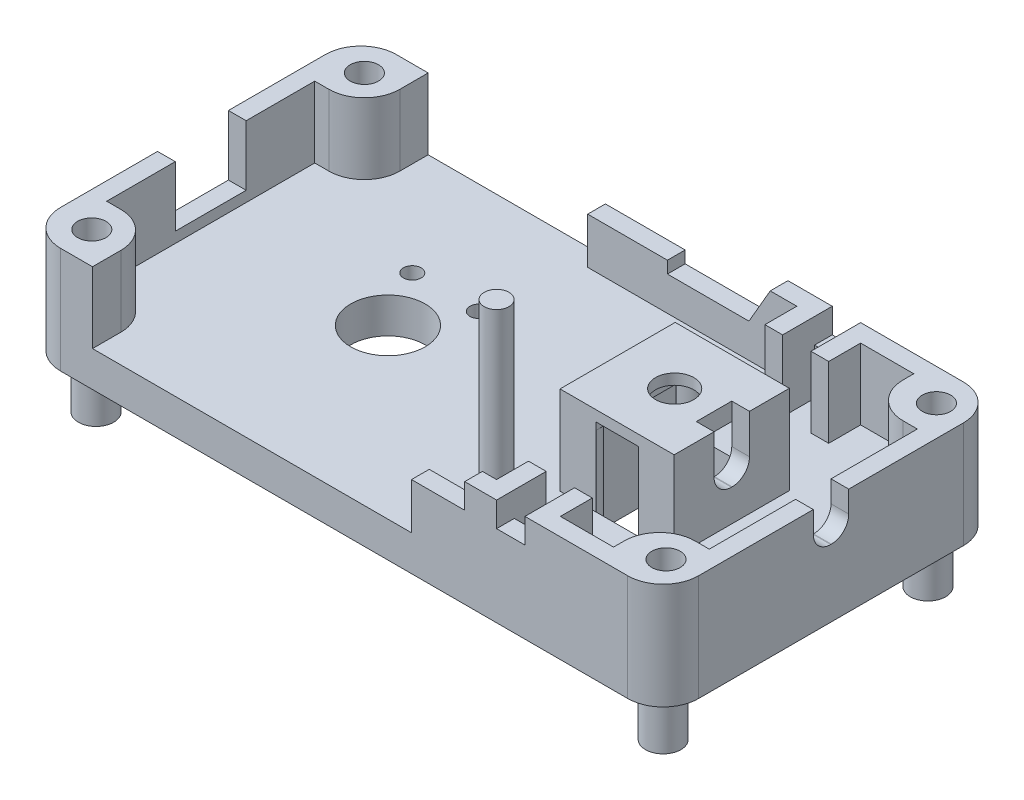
ISO-10303-21;
HEADER;
FILE_DESCRIPTION(('STEP AP214'),'2;1');
FILE_NAME('part.step','',(''),(''),'','','');
FILE_SCHEMA(('AUTOMOTIVE_DESIGN { 1 0 10303 214 1 1 1 1 }'));
ENDSEC;
DATA;
#1=APPLICATION_CONTEXT('core data for automotive mechanical design processes');
#2=APPLICATION_PROTOCOL_DEFINITION('international standard','automotive_design',2000,#1);
#3=PRODUCT_CONTEXT('',#1,'mechanical');
#4=PRODUCT('Part','Part','',(#3));
#5=PRODUCT_RELATED_PRODUCT_CATEGORY('part','',(#4));
#6=PRODUCT_DEFINITION_FORMATION('','',#4);
#7=PRODUCT_DEFINITION_CONTEXT('part definition',#1,'design');
#8=PRODUCT_DEFINITION('design','',#6,#7);
#9=PRODUCT_DEFINITION_SHAPE('','',#8);
#10=(LENGTH_UNIT() NAMED_UNIT(*) SI_UNIT(.MILLI.,.METRE.));
#11=(NAMED_UNIT(*) PLANE_ANGLE_UNIT() SI_UNIT($,.RADIAN.));
#12=(NAMED_UNIT(*) SI_UNIT($,.STERADIAN.) SOLID_ANGLE_UNIT());
#13=UNCERTAINTY_MEASURE_WITH_UNIT(LENGTH_MEASURE(1.E-05),#10,'distance_accuracy_value','');
#14=(GEOMETRIC_REPRESENTATION_CONTEXT(3) GLOBAL_UNCERTAINTY_ASSIGNED_CONTEXT((#13)) GLOBAL_UNIT_ASSIGNED_CONTEXT((#10,
#11,#12)) REPRESENTATION_CONTEXT('',''));
#15=CARTESIAN_POINT('',(0.,0.,0.));
#16=DIRECTION('',(0.,0.,1.));
#17=DIRECTION('',(1.,0.,0.));
#18=AXIS2_PLACEMENT_3D('',#15,#16,#17);
#19=CARTESIAN_POINT('',(0.,7.62,0.));
#20=DIRECTION('',(0.,1.,0.));
#21=DIRECTION('',(0.,0.,1.));
#22=AXIS2_PLACEMENT_3D('',#19,#20,#21);
#23=PLANE('',#22);
#24=CARTESIAN_POINT('',(-8.4074,7.62,-7.92479999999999));
#25=DIRECTION('',(0.,-1.,0.));
#26=DIRECTION('',(0.,0.,1.));
#27=AXIS2_PLACEMENT_3D('',#24,#25,#26);
#28=CIRCLE('',#27,1.2446);
#29=CARTESIAN_POINT('',(-9.65199999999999,7.62,-7.92479999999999));
#30=VERTEX_POINT('',#29);
#31=CARTESIAN_POINT('',(-8.40739999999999,7.62,-9.16939999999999));
#32=VERTEX_POINT('',#31);
#33=EDGE_CURVE('E997',#30,#32,#28,.T.);
#34=ORIENTED_EDGE('',*,*,#33,.F.);
#35=DIRECTION('',(0.,0.,-1.));
#36=VECTOR('',#35,1.);
#37=CARTESIAN_POINT('',(-9.65199999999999,7.62,-5.23239999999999));
#38=LINE('',#37,#36);
#39=CARTESIAN_POINT('',(-9.652,7.62,-16.129));
#40=VERTEX_POINT('',#39);
#41=EDGE_CURVE('E680',#30,#40,#38,.T.);
#42=ORIENTED_EDGE('',*,*,#41,.T.);
#43=CARTESIAN_POINT('',(-8.4074,7.62,-16.129));
#44=DIRECTION('',(0.,-1.,0.));
#45=DIRECTION('',(0.,0.,1.));
#46=AXIS2_PLACEMENT_3D('',#43,#44,#45);
#47=CIRCLE('',#46,1.2446);
#48=CARTESIAN_POINT('',(-8.4074,7.62,-14.8844));
#49=VERTEX_POINT('',#48);
#50=EDGE_CURVE('E1016',#49,#40,#47,.T.);
#51=ORIENTED_EDGE('',*,*,#50,.F.);
#52=DIRECTION('',(-1.,0.,0.));
#53=VECTOR('',#52,1.);
#54=CARTESIAN_POINT('',(-8.382,7.62,-14.8844));
#55=LINE('',#54,#53);
#56=CARTESIAN_POINT('',(-8.382,7.62,-14.8844));
#57=VERTEX_POINT('',#56);
#58=EDGE_CURVE('E1030',#57,#49,#55,.T.);
#59=ORIENTED_EDGE('',*,*,#58,.F.);
#60=DIRECTION('',(0.,0.,1.));
#61=VECTOR('',#60,1.);
#62=CARTESIAN_POINT('',(-8.382,7.62,-17.5514));
#63=LINE('',#62,#61);
#64=CARTESIAN_POINT('',(-8.382,7.62,-13.2969));
#65=VERTEX_POINT('',#64);
#66=EDGE_CURVE('E1099',#57,#65,#63,.T.);
#67=ORIENTED_EDGE('',*,*,#66,.T.);
#68=DIRECTION('',(0.,0.,1.));
#69=VECTOR('',#68,1.);
#70=CARTESIAN_POINT('',(-8.382,7.62,0.));
#71=LINE('',#70,#69);
#72=CARTESIAN_POINT('',(-8.382,7.62,-10.7569));
#73=VERTEX_POINT('',#72);
#74=EDGE_CURVE('E928',#65,#73,#71,.T.);
#75=ORIENTED_EDGE('',*,*,#74,.T.);
#76=CARTESIAN_POINT('',(-8.382,7.62,-9.16939999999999));
#77=VERTEX_POINT('',#76);
#78=EDGE_CURVE('E1093',#73,#77,#63,.T.);
#79=ORIENTED_EDGE('',*,*,#78,.T.);
#80=DIRECTION('',(1.,0.,0.));
#81=VECTOR('',#80,1.);
#82=CARTESIAN_POINT('',(-8.382,7.62,-9.16939999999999));
#83=LINE('',#82,#81);
#84=EDGE_CURVE('E982',#32,#77,#83,.T.);
#85=ORIENTED_EDGE('',*,*,#84,.F.);
#86=EDGE_LOOP('',(#34,#42,#51,#59,#67,#75,#79,#85));
#87=FACE_BOUND('',#86,.T.);
#88=ADVANCED_FACE('F49',(#87),#23,.F.);
#89=CARTESIAN_POINT('',(0.,7.62,0.));
#90=DIRECTION('',(0.,1.,0.));
#91=DIRECTION('',(0.,0.,1.));
#92=AXIS2_PLACEMENT_3D('',#89,#90,#91);
#93=PLANE('',#92);
#94=DIRECTION('',(-1.,0.,0.));
#95=VECTOR('',#94,1.);
#96=CARTESIAN_POINT('',(-40.64,7.62,-14.5669));
#97=LINE('',#96,#95);
#98=CARTESIAN_POINT('',(-44.45,7.62,-14.5669));
#99=VERTEX_POINT('',#98);
#100=CARTESIAN_POINT('',(-45.72,7.62,-14.5669));
#101=VERTEX_POINT('',#100);
#102=EDGE_CURVE('E709',#99,#101,#97,.T.);
#103=ORIENTED_EDGE('',*,*,#102,.F.);
#104=DIRECTION('',(0.,0.,1.));
#105=VECTOR('',#104,1.);
#106=CARTESIAN_POINT('',(-44.45,7.62,-4.57199999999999));
#107=LINE('',#106,#105);
#108=CARTESIAN_POINT('',(-44.45,7.62,-19.4818));
#109=VERTEX_POINT('',#108);
#110=EDGE_CURVE('E1436',#109,#99,#107,.T.);
#111=ORIENTED_EDGE('',*,*,#110,.F.);
#112=DIRECTION('',(-1.,0.,0.));
#113=VECTOR('',#112,1.);
#114=CARTESIAN_POINT('',(-1.27,7.62,-19.4818));
#115=LINE('',#114,#113);
#116=CARTESIAN_POINT('',(-43.434,7.62,-19.4818));
#117=VERTEX_POINT('',#116);
#118=EDGE_CURVE('E1450',#117,#109,#115,.T.);
#119=ORIENTED_EDGE('',*,*,#118,.F.);
#120=CARTESIAN_POINT('',(-43.434,7.62,-22.0218));
#121=DIRECTION('',(0.,1.,0.));
#122=DIRECTION('',(0.,0.,1.));
#123=AXIS2_PLACEMENT_3D('',#120,#121,#122);
#124=CIRCLE('',#123,2.54);
#125=CARTESIAN_POINT('',(-40.894,7.62,-22.0218));
#126=VERTEX_POINT('',#125);
#127=EDGE_CURVE('E1591',#117,#126,#124,.T.);
#128=ORIENTED_EDGE('',*,*,#127,.T.);
#129=DIRECTION('',(0.,0.,1.));
#130=VECTOR('',#129,1.);
#131=CARTESIAN_POINT('',(-40.894,7.62,-19.4818));
#132=LINE('',#131,#130);
#133=CARTESIAN_POINT('',(-40.894,7.62,-24.0538));
#134=VERTEX_POINT('',#133);
#135=EDGE_CURVE('E1344',#134,#126,#132,.T.);
#136=ORIENTED_EDGE('',*,*,#135,.F.);
#137=DIRECTION('',(-1.,0.,0.));
#138=VECTOR('',#137,1.);
#139=CARTESIAN_POINT('',(0.,7.62,-24.0538));
#140=LINE('',#139,#138);
#141=CARTESIAN_POINT('',(-43.18,7.62,-24.0538));
#142=VERTEX_POINT('',#141);
#143=EDGE_CURVE('E1474',#134,#142,#140,.T.);
#144=ORIENTED_EDGE('',*,*,#143,.T.);
#145=CARTESIAN_POINT('',(-43.18,7.62,-21.5138));
#146=DIRECTION('',(0.,1.,0.));
#147=DIRECTION('',(0.,0.,1.));
#148=AXIS2_PLACEMENT_3D('',#145,#146,#147);
#149=CIRCLE('',#148,2.54);
#150=CARTESIAN_POINT('',(-45.72,7.62,-21.5138));
#151=VERTEX_POINT('',#150);
#152=EDGE_CURVE('E1538',#142,#151,#149,.T.);
#153=ORIENTED_EDGE('',*,*,#152,.T.);
#154=DIRECTION('',(0.,0.,1.));
#155=VECTOR('',#154,1.);
#156=CARTESIAN_POINT('',(-45.72,7.62,0.));
#157=LINE('',#156,#155);
#158=EDGE_CURVE('E1482',#151,#101,#157,.T.);
#159=ORIENTED_EDGE('',*,*,#158,.T.);
#160=EDGE_LOOP('',(#103,#111,#119,#128,#136,#144,#153,#159));
#161=FACE_BOUND('',#160,.T.);
#162=CARTESIAN_POINT('',(-43.18,7.62,-21.7678));
#163=DIRECTION('',(0.,1.,0.));
#164=DIRECTION('',(0.,0.,1.));
#165=AXIS2_PLACEMENT_3D('',#162,#163,#164);
#166=CIRCLE('',#165,1.016);
#167=CARTESIAN_POINT('',(-43.18,7.62,-20.7518));
#168=VERTEX_POINT('',#167);
#169=EDGE_CURVE('E1264',#168,#168,#166,.T.);
#170=ORIENTED_EDGE('',*,*,#169,.F.);
#171=EDGE_LOOP('',(#170));
#172=FACE_BOUND('',#171,.T.);
#173=ADVANCED_FACE('F1947',(#161,#172),#93,.T.);
#174=CARTESIAN_POINT('',(0.,2.54,0.));
#175=DIRECTION('',(0.,1.,0.));
#176=DIRECTION('',(0.,0.,1.));
#177=AXIS2_PLACEMENT_3D('',#174,#175,#176);
#178=PLANE('',#177);
#179=CARTESIAN_POINT('',(-16.764,2.54,-4.826));
#180=DIRECTION('',(0.,1.,0.));
#181=DIRECTION('',(0.,0.,1.));
#182=AXIS2_PLACEMENT_3D('',#179,#180,#181);
#183=CIRCLE('',#182,0.889);
#184=CARTESIAN_POINT('',(-16.764,2.54,-3.937));
#185=VERTEX_POINT('',#184);
#186=EDGE_CURVE('E687',#185,#185,#183,.T.);
#187=ORIENTED_EDGE('',*,*,#186,.F.);
#188=EDGE_LOOP('',(#187));
#189=FACE_BOUND('',#188,.T.);
#190=CARTESIAN_POINT('',(-19.1709400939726,2.54,-19.9898));
#191=DIRECTION('',(0.,-1.,0.));
#192=DIRECTION('',(0.,0.,-1.));
#193=AXIS2_PLACEMENT_3D('',#190,#191,#192);
#194=CIRCLE('',#193,0.762000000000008);
#195=CARTESIAN_POINT('',(-18.5994400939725,2.54,-20.4938156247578));
#196=VERTEX_POINT('',#195);
#197=CARTESIAN_POINT('',(-19.7424400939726,2.54,-19.4857843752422));
#198=VERTEX_POINT('',#197);
#199=EDGE_CURVE('E1611',#196,#198,#194,.F.);
#200=ORIENTED_EDGE('',*,*,#199,.F.);
#201=DIRECTION('',(-0.661437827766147,0.,-0.75));
#202=VECTOR('',#201,1.);
#203=CARTESIAN_POINT('',(-0.295646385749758,2.54,0.26073560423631));
#204=LINE('',#203,#202);
#205=CARTESIAN_POINT('',(-17.2553984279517,2.54,-18.9698156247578));
#206=VERTEX_POINT('',#205);
#207=EDGE_CURVE('E1563',#206,#196,#204,.T.);
#208=ORIENTED_EDGE('',*,*,#207,.F.);
#209=CARTESIAN_POINT('',(-17.8268984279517,2.54,-18.4658));
#210=DIRECTION('',(0.,1.,0.));
#211=DIRECTION('',(0.,0.,1.));
#212=AXIS2_PLACEMENT_3D('',#209,#210,#211);
#213=CIRCLE('',#212,0.76200000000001);
#214=CARTESIAN_POINT('',(-18.3983984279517,2.54,-17.9617843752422));
#215=VERTEX_POINT('',#214);
#216=EDGE_CURVE('E1576',#215,#206,#213,.T.);
#217=ORIENTED_EDGE('',*,*,#216,.F.);
#218=DIRECTION('',(0.661437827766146,0.,0.750000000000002));
#219=VECTOR('',#218,1.);
#220=CARTESIAN_POINT('',(-1.43864638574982,2.54,1.26876685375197));
#221=LINE('',#220,#219);
#222=EDGE_CURVE('E1580',#198,#215,#221,.T.);
#223=ORIENTED_EDGE('',*,*,#222,.F.);
#224=EDGE_LOOP('',(#200,#208,#217,#223));
#225=FACE_BOUND('',#224,.T.);
#226=CARTESIAN_POINT('',(-29.3669867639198,2.54,-16.1544));
#227=DIRECTION('',(0.,1.,0.));
#228=DIRECTION('',(0.,0.,1.));
#229=AXIS2_PLACEMENT_3D('',#226,#227,#228);
#230=CIRCLE('',#229,0.634999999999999);
#231=CARTESIAN_POINT('',(-29.3669867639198,2.54,-15.5194));
#232=VERTEX_POINT('',#231);
#233=EDGE_CURVE('E1355',#232,#232,#230,.T.);
#234=ORIENTED_EDGE('',*,*,#233,.F.);
#235=EDGE_LOOP('',(#234));
#236=FACE_BOUND('',#235,.T.);
#237=CARTESIAN_POINT('',(-34.1330132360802,2.54,-16.1544));
#238=DIRECTION('',(0.,1.,0.));
#239=DIRECTION('',(0.,0.,1.));
#240=AXIS2_PLACEMENT_3D('',#237,#238,#239);
#241=CIRCLE('',#240,0.635000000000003);
#242=CARTESIAN_POINT('',(-34.1330132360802,2.54,-15.5194));
#243=VERTEX_POINT('',#242);
#244=EDGE_CURVE('E1567',#243,#243,#241,.T.);
#245=ORIENTED_EDGE('',*,*,#244,.F.);
#246=EDGE_LOOP('',(#245));
#247=FACE_BOUND('',#246,.T.);
#248=CARTESIAN_POINT('',(-31.75,2.54,-12.0269));
#249=DIRECTION('',(0.,1.,0.));
#250=DIRECTION('',(0.,0.,1.));
#251=AXIS2_PLACEMENT_3D('',#248,#249,#250);
#252=CIRCLE('',#251,2.667);
#253=CARTESIAN_POINT('',(-31.75,2.54,-9.35989999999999));
#254=VERTEX_POINT('',#253);
#255=EDGE_CURVE('E1300',#254,#254,#252,.T.);
#256=ORIENTED_EDGE('',*,*,#255,.F.);
#257=EDGE_LOOP('',(#256));
#258=FACE_BOUND('',#257,.T.);
#259=DIRECTION('',(-1.,0.,0.));
#260=VECTOR('',#259,1.);
#261=CARTESIAN_POINT('',(-7.112,2.54,-16.1544));
#262=LINE('',#261,#260);
#263=CARTESIAN_POINT('',(-7.112,2.54,-16.1544));
#264=VERTEX_POINT('',#263);
#265=CARTESIAN_POINT('',(-9.652,2.54,-16.1544));
#266=VERTEX_POINT('',#265);
#267=EDGE_CURVE('E1398',#264,#266,#262,.T.);
#268=ORIENTED_EDGE('',*,*,#267,.F.);
#269=DIRECTION('',(0.,0.,-1.));
#270=VECTOR('',#269,1.);
#271=CARTESIAN_POINT('',(-7.112,2.54,-7.89939999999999));
#272=LINE('',#271,#270);
#273=CARTESIAN_POINT('',(-7.112,2.54,-7.89939999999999));
#274=VERTEX_POINT('',#273);
#275=EDGE_CURVE('E1392',#274,#264,#272,.T.);
#276=ORIENTED_EDGE('',*,*,#275,.F.);
#277=DIRECTION('',(1.,0.,0.));
#278=VECTOR('',#277,1.);
#279=CARTESIAN_POINT('',(-7.112,2.54,-7.89939999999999));
#280=LINE('',#279,#278);
#281=CARTESIAN_POINT('',(-9.652,2.54,-7.89939999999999));
#282=VERTEX_POINT('',#281);
#283=EDGE_CURVE('E1388',#282,#274,#280,.T.);
#284=ORIENTED_EDGE('',*,*,#283,.F.);
#285=CARTESIAN_POINT('',(-12.7,2.54,-7.89939999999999));
#286=VERTEX_POINT('',#285);
#287=EDGE_CURVE('E1393',#286,#282,#280,.T.);
#288=ORIENTED_EDGE('',*,*,#287,.F.);
#289=CARTESIAN_POINT('',(-15.2908,2.54,-7.89939999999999));
#290=VERTEX_POINT('',#289);
#291=EDGE_CURVE('E1389',#290,#286,#280,.T.);
#292=ORIENTED_EDGE('',*,*,#291,.F.);
#293=DIRECTION('',(0.,0.,1.));
#294=VECTOR('',#293,1.);
#295=CARTESIAN_POINT('',(-15.2908,2.54,-7.89939999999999));
#296=LINE('',#295,#294);
#297=CARTESIAN_POINT('',(-15.2908,2.54,-16.1544));
#298=VERTEX_POINT('',#297);
#299=EDGE_CURVE('E1381',#298,#290,#296,.T.);
#300=ORIENTED_EDGE('',*,*,#299,.F.);
#301=CARTESIAN_POINT('',(-12.7,2.54,-16.1544));
#302=VERTEX_POINT('',#301);
#303=EDGE_CURVE('E1397',#302,#298,#262,.T.);
#304=ORIENTED_EDGE('',*,*,#303,.F.);
#305=EDGE_CURVE('E1402',#266,#302,#262,.T.);
#306=ORIENTED_EDGE('',*,*,#305,.F.);
#307=EDGE_LOOP('',(#268,#276,#284,#288,#292,#300,#304,#306));
#308=FACE_BOUND('',#307,.T.);
#309=DIRECTION('',(1.,0.,0.));
#310=VECTOR('',#309,1.);
#311=CARTESIAN_POINT('',(-9.906,2.54,-20.4978));
#312=LINE('',#311,#310);
#313=CARTESIAN_POINT('',(-9.906,2.54,-20.4978));
#314=VERTEX_POINT('',#313);
#315=CARTESIAN_POINT('',(-8.636,2.54,-20.4978));
#316=VERTEX_POINT('',#315);
#317=EDGE_CURVE('E738',#314,#316,#312,.T.);
#318=ORIENTED_EDGE('',*,*,#317,.F.);
#319=DIRECTION('',(0.,0.,1.));
#320=VECTOR('',#319,1.);
#321=CARTESIAN_POINT('',(-9.906,2.54,-22.7838));
#322=LINE('',#321,#320);
#323=CARTESIAN_POINT('',(-9.906,2.54,-22.7838));
#324=VERTEX_POINT('',#323);
#325=EDGE_CURVE('E742',#324,#314,#322,.T.);
#326=ORIENTED_EDGE('',*,*,#325,.F.);
#327=DIRECTION('',(-1.,0.,0.));
#328=VECTOR('',#327,1.);
#329=CARTESIAN_POINT('',(-28.194,2.54,-22.7838));
#330=LINE('',#329,#328);
#331=CARTESIAN_POINT('',(-11.938,2.54,-22.7838));
#332=VERTEX_POINT('',#331);
#333=EDGE_CURVE('E1162',#324,#332,#330,.T.);
#334=ORIENTED_EDGE('',*,*,#333,.T.);
#335=DIRECTION('',(0.,0.,-1.));
#336=VECTOR('',#335,1.);
#337=CARTESIAN_POINT('',(-11.938,2.54,-22.7838));
#338=LINE('',#337,#336);
#339=CARTESIAN_POINT('',(-11.938,2.54,-20.4978));
#340=VERTEX_POINT('',#339);
#341=EDGE_CURVE('E773',#340,#332,#338,.T.);
#342=ORIENTED_EDGE('',*,*,#341,.F.);
#343=DIRECTION('',(1.,0.,0.));
#344=VECTOR('',#343,1.);
#345=CARTESIAN_POINT('',(-11.938,2.54,-20.4978));
#346=LINE('',#345,#344);
#347=CARTESIAN_POINT('',(-13.208,2.54,-20.4978));
#348=VERTEX_POINT('',#347);
#349=EDGE_CURVE('E766',#348,#340,#346,.T.);
#350=ORIENTED_EDGE('',*,*,#349,.F.);
#351=DIRECTION('',(0.,0.,1.));
#352=VECTOR('',#351,1.);
#353=CARTESIAN_POINT('',(-13.208,2.54,-22.7838));
#354=LINE('',#353,#352);
#355=CARTESIAN_POINT('',(-13.208,2.54,-22.7838));
#356=VERTEX_POINT('',#355);
#357=EDGE_CURVE('E769',#356,#348,#354,.T.);
#358=ORIENTED_EDGE('',*,*,#357,.F.);
#359=CARTESIAN_POINT('',(-28.194,2.54,-22.7838));
#360=VERTEX_POINT('',#359);
#361=EDGE_CURVE('E1155',#356,#360,#330,.T.);
#362=ORIENTED_EDGE('',*,*,#361,.T.);
#363=DIRECTION('',(0.,0.,-1.));
#364=VECTOR('',#363,1.);
#365=CARTESIAN_POINT('',(-28.194,2.54,-19.4818));
#366=LINE('',#365,#364);
#367=CARTESIAN_POINT('',(-28.194,2.54,-24.0538));
#368=VERTEX_POINT('',#367);
#369=EDGE_CURVE('E1343',#360,#368,#366,.T.);
#370=ORIENTED_EDGE('',*,*,#369,.T.);
#371=DIRECTION('',(-1.,0.,0.));
#372=VECTOR('',#371,1.);
#373=CARTESIAN_POINT('',(-40.894,2.54,-24.0538));
#374=LINE('',#373,#372);
#375=CARTESIAN_POINT('',(-40.894,2.54,-24.0538));
#376=VERTEX_POINT('',#375);
#377=EDGE_CURVE('E1347',#368,#376,#374,.T.);
#378=ORIENTED_EDGE('',*,*,#377,.T.);
#379=DIRECTION('',(0.,0.,1.));
#380=VECTOR('',#379,1.);
#381=CARTESIAN_POINT('',(-40.894,2.54,-19.4818));
#382=LINE('',#381,#380);
#383=CARTESIAN_POINT('',(-40.894,2.54,-22.0218));
#384=VERTEX_POINT('',#383);
#385=EDGE_CURVE('E1339',#376,#384,#382,.T.);
#386=ORIENTED_EDGE('',*,*,#385,.T.);
#387=CARTESIAN_POINT('',(-43.434,2.54,-22.0218));
#388=DIRECTION('',(0.,1.,0.));
#389=DIRECTION('',(0.,0.,1.));
#390=AXIS2_PLACEMENT_3D('',#387,#388,#389);
#391=CIRCLE('',#390,2.54);
#392=CARTESIAN_POINT('',(-43.434,2.54,-19.4818));
#393=VERTEX_POINT('',#392);
#394=EDGE_CURVE('E1594',#393,#384,#391,.T.);
#395=ORIENTED_EDGE('',*,*,#394,.F.);
#396=DIRECTION('',(-1.,0.,0.));
#397=VECTOR('',#396,1.);
#398=CARTESIAN_POINT('',(-1.27,2.54,-19.4818));
#399=LINE('',#398,#397);
#400=CARTESIAN_POINT('',(-44.45,2.54,-19.4818));
#401=VERTEX_POINT('',#400);
#402=EDGE_CURVE('E1430',#393,#401,#399,.T.);
#403=ORIENTED_EDGE('',*,*,#402,.T.);
#404=DIRECTION('',(0.,0.,1.));
#405=VECTOR('',#404,1.);
#406=CARTESIAN_POINT('',(-44.45,2.54,-4.57199999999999));
#407=LINE('',#406,#405);
#408=CARTESIAN_POINT('',(-44.45,2.54,-4.57199999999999));
#409=VERTEX_POINT('',#408);
#410=EDGE_CURVE('E1416',#401,#409,#407,.T.);
#411=ORIENTED_EDGE('',*,*,#410,.T.);
#412=DIRECTION('',(1.,0.,0.));
#413=VECTOR('',#412,1.);
#414=CARTESIAN_POINT('',(-1.27,2.54,-4.572));
#415=LINE('',#414,#413);
#416=CARTESIAN_POINT('',(-43.434,2.54,-4.57199999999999));
#417=VERTEX_POINT('',#416);
#418=EDGE_CURVE('E1422',#409,#417,#415,.T.);
#419=ORIENTED_EDGE('',*,*,#418,.T.);
#420=CARTESIAN_POINT('',(-43.434,2.54,-2.03199999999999));
#421=DIRECTION('',(0.,1.,0.));
#422=DIRECTION('',(0.,0.,1.));
#423=AXIS2_PLACEMENT_3D('',#420,#421,#422);
#424=CIRCLE('',#423,2.54);
#425=CARTESIAN_POINT('',(-40.894,2.54,-2.03199999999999));
#426=VERTEX_POINT('',#425);
#427=EDGE_CURVE('E1608',#426,#417,#424,.T.);
#428=ORIENTED_EDGE('',*,*,#427,.F.);
#429=DIRECTION('',(0.,0.,1.));
#430=VECTOR('',#429,1.);
#431=CARTESIAN_POINT('',(-40.894,2.54,-4.57199999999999));
#432=LINE('',#431,#430);
#433=CARTESIAN_POINT('',(-40.894,2.54,0.));
#434=VERTEX_POINT('',#433);
#435=EDGE_CURVE('E1367',#426,#434,#432,.T.);
#436=ORIENTED_EDGE('',*,*,#435,.T.);
#437=DIRECTION('',(1.,0.,0.));
#438=VECTOR('',#437,1.);
#439=CARTESIAN_POINT('',(-18.034,2.54,0.));
#440=LINE('',#439,#438);
#441=CARTESIAN_POINT('',(-18.034,2.54,0.));
#442=VERTEX_POINT('',#441);
#443=EDGE_CURVE('E1370',#434,#442,#440,.T.);
#444=ORIENTED_EDGE('',*,*,#443,.T.);
#445=DIRECTION('',(0.,0.,-1.));
#446=VECTOR('',#445,1.);
#447=CARTESIAN_POINT('',(-18.034,2.54,-4.57199999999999));
#448=LINE('',#447,#446);
#449=CARTESIAN_POINT('',(-18.034,2.54,-1.27));
#450=VERTEX_POINT('',#449);
#451=EDGE_CURVE('E1363',#442,#450,#448,.T.);
#452=ORIENTED_EDGE('',*,*,#451,.T.);
#453=DIRECTION('',(1.,0.,0.));
#454=VECTOR('',#453,1.);
#455=CARTESIAN_POINT('',(-18.034,2.54,-1.27));
#456=LINE('',#455,#454);
#457=CARTESIAN_POINT('',(-13.208,2.54,-1.27));
#458=VERTEX_POINT('',#457);
#459=EDGE_CURVE('E1192',#450,#458,#456,.T.);
#460=ORIENTED_EDGE('',*,*,#459,.T.);
#461=DIRECTION('',(0.,0.,1.));
#462=VECTOR('',#461,1.);
#463=CARTESIAN_POINT('',(-13.208,2.54,-1.27));
#464=LINE('',#463,#462);
#465=CARTESIAN_POINT('',(-13.208,2.54,-3.556));
#466=VERTEX_POINT('',#465);
#467=EDGE_CURVE('E797',#466,#458,#464,.T.);
#468=ORIENTED_EDGE('',*,*,#467,.F.);
#469=DIRECTION('',(-1.,0.,0.));
#470=VECTOR('',#469,1.);
#471=CARTESIAN_POINT('',(-11.938,2.54,-3.556));
#472=LINE('',#471,#470);
#473=CARTESIAN_POINT('',(-11.938,2.54,-3.556));
#474=VERTEX_POINT('',#473);
#475=EDGE_CURVE('E800',#474,#466,#472,.T.);
#476=ORIENTED_EDGE('',*,*,#475,.F.);
#477=DIRECTION('',(0.,0.,-1.));
#478=VECTOR('',#477,1.);
#479=CARTESIAN_POINT('',(-11.938,2.54,-1.27));
#480=LINE('',#479,#478);
#481=CARTESIAN_POINT('',(-11.938,2.54,-1.27));
#482=VERTEX_POINT('',#481);
#483=EDGE_CURVE('E804',#482,#474,#480,.T.);
#484=ORIENTED_EDGE('',*,*,#483,.F.);
#485=CARTESIAN_POINT('',(-9.906,2.54,-1.27));
#486=VERTEX_POINT('',#485);
#487=EDGE_CURVE('E1203',#482,#486,#456,.T.);
#488=ORIENTED_EDGE('',*,*,#487,.T.);
#489=DIRECTION('',(0.,0.,1.));
#490=VECTOR('',#489,1.);
#491=CARTESIAN_POINT('',(-9.906,2.54,-1.27));
#492=LINE('',#491,#490);
#493=CARTESIAN_POINT('',(-9.906,2.54,-3.556));
#494=VERTEX_POINT('',#493);
#495=EDGE_CURVE('E808',#494,#486,#492,.T.);
#496=ORIENTED_EDGE('',*,*,#495,.F.);
#497=DIRECTION('',(-1.,0.,0.));
#498=VECTOR('',#497,1.);
#499=CARTESIAN_POINT('',(-9.906,2.54,-3.556));
#500=LINE('',#499,#498);
#501=CARTESIAN_POINT('',(-8.636,2.54,-3.556));
#502=VERTEX_POINT('',#501);
#503=EDGE_CURVE('E73',#502,#494,#500,.T.);
#504=ORIENTED_EDGE('',*,*,#503,.F.);
#505=DIRECTION('',(0.,0.,-1.));
#506=VECTOR('',#505,1.);
#507=CARTESIAN_POINT('',(-8.636,2.54,-1.27));
#508=LINE('',#507,#506);
#509=CARTESIAN_POINT('',(-8.636,2.54,-1.27));
#510=VERTEX_POINT('',#509);
#511=EDGE_CURVE('E824',#510,#502,#508,.T.);
#512=ORIENTED_EDGE('',*,*,#511,.F.);
#513=CARTESIAN_POINT('',(-4.826,2.54,-1.27));
#514=VERTEX_POINT('',#513);
#515=EDGE_CURVE('E1199',#510,#514,#456,.T.);
#516=ORIENTED_EDGE('',*,*,#515,.T.);
#517=DIRECTION('',(0.,0.,-1.));
#518=VECTOR('',#517,1.);
#519=CARTESIAN_POINT('',(-4.826,2.54,-4.57199999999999));
#520=LINE('',#519,#518);
#521=CARTESIAN_POINT('',(-4.826,2.54,-2.032));
#522=VERTEX_POINT('',#521);
#523=EDGE_CURVE('E1183',#514,#522,#520,.T.);
#524=ORIENTED_EDGE('',*,*,#523,.T.);
#525=CARTESIAN_POINT('',(-2.286,2.54,-2.032));
#526=DIRECTION('',(0.,1.,0.));
#527=DIRECTION('',(0.,0.,1.));
#528=AXIS2_PLACEMENT_3D('',#525,#526,#527);
#529=CIRCLE('',#528,2.54);
#530=CARTESIAN_POINT('',(-2.286,2.54,-4.572));
#531=VERTEX_POINT('',#530);
#532=EDGE_CURVE('E1640',#531,#522,#529,.T.);
#533=ORIENTED_EDGE('',*,*,#532,.F.);
#534=CARTESIAN_POINT('',(-1.27,2.54,-4.572));
#535=VERTEX_POINT('',#534);
#536=EDGE_CURVE('E1420',#531,#535,#415,.T.);
#537=ORIENTED_EDGE('',*,*,#536,.T.);
#538=DIRECTION('',(0.,0.,-1.));
#539=VECTOR('',#538,1.);
#540=CARTESIAN_POINT('',(-1.27,2.54,-4.572));
#541=LINE('',#540,#539);
#542=CARTESIAN_POINT('',(-1.27,2.54,-19.4818));
#543=VERTEX_POINT('',#542);
#544=EDGE_CURVE('E1426',#535,#543,#541,.T.);
#545=ORIENTED_EDGE('',*,*,#544,.T.);
#546=CARTESIAN_POINT('',(-2.286,2.54,-19.4818));
#547=VERTEX_POINT('',#546);
#548=EDGE_CURVE('E1431',#543,#547,#399,.T.);
#549=ORIENTED_EDGE('',*,*,#548,.T.);
#550=CARTESIAN_POINT('',(-2.286,2.54,-22.0218));
#551=DIRECTION('',(0.,1.,0.));
#552=DIRECTION('',(0.,0.,1.));
#553=AXIS2_PLACEMENT_3D('',#550,#551,#552);
#554=CIRCLE('',#553,2.54);
#555=CARTESIAN_POINT('',(-4.826,2.54,-22.0218));
#556=VERTEX_POINT('',#555);
#557=EDGE_CURVE('E1626',#556,#547,#554,.T.);
#558=ORIENTED_EDGE('',*,*,#557,.F.);
#559=DIRECTION('',(0.,0.,-1.));
#560=VECTOR('',#559,1.);
#561=CARTESIAN_POINT('',(-4.826,2.54,-19.4818));
#562=LINE('',#561,#560);
#563=CARTESIAN_POINT('',(-4.826,2.54,-22.7838));
#564=VERTEX_POINT('',#563);
#565=EDGE_CURVE('E1152',#556,#564,#562,.T.);
#566=ORIENTED_EDGE('',*,*,#565,.T.);
#567=CARTESIAN_POINT('',(-8.636,2.54,-22.7838));
#568=VERTEX_POINT('',#567);
#569=EDGE_CURVE('E1157',#564,#568,#330,.T.);
#570=ORIENTED_EDGE('',*,*,#569,.T.);
#571=DIRECTION('',(0.,0.,-1.));
#572=VECTOR('',#571,1.);
#573=CARTESIAN_POINT('',(-8.636,2.54,-22.7838));
#574=LINE('',#573,#572);
#575=EDGE_CURVE('E735',#316,#568,#574,.T.);
#576=ORIENTED_EDGE('',*,*,#575,.F.);
#577=EDGE_LOOP('',(#318,#326,#334,#342,#350,#358,#362,#370,#378,#386,#395,#403,#411,#419,#428,
#436,#444,#452,#460,#468,#476,#484,#488,#496,#504,#512,#516,#524,#533,#537,#545,#549,#558,#566,
#570,#576));
#578=FACE_BOUND('',#577,.T.);
#579=ADVANCED_FACE('F1832',(#189,#225,#236,#247,#258,#308,#578),#178,.T.);
#580=CARTESIAN_POINT('',(-28.194,2.54,-22.7838));
#581=DIRECTION('',(0.,0.,-1.));
#582=DIRECTION('',(-1.,0.,0.));
#583=AXIS2_PLACEMENT_3D('',#580,#581,#582);
#584=PLANE('',#583);
#585=DIRECTION('',(0.,-1.,0.));
#586=VECTOR('',#585,1.);
#587=CARTESIAN_POINT('',(-9.906,7.62,-22.7838));
#588=LINE('',#587,#586);
#589=CARTESIAN_POINT('',(-9.906,5.842,-22.7838));
#590=VERTEX_POINT('',#589);
#591=EDGE_CURVE('E731',#590,#324,#588,.T.);
#592=ORIENTED_EDGE('',*,*,#591,.F.);
#593=DIRECTION('',(1.,0.,0.));
#594=VECTOR('',#593,1.);
#595=CARTESIAN_POINT('',(0.,5.842,-22.7838));
#596=LINE('',#595,#594);
#597=CARTESIAN_POINT('',(-11.938,5.842,-22.7838));
#598=VERTEX_POINT('',#597);
#599=EDGE_CURVE('E1207',#598,#590,#596,.T.);
#600=ORIENTED_EDGE('',*,*,#599,.F.);
#601=DIRECTION('',(0.,-1.,0.));
#602=VECTOR('',#601,1.);
#603=CARTESIAN_POINT('',(-11.938,7.62,-22.7838));
#604=LINE('',#603,#602);
#605=EDGE_CURVE('E746',#598,#332,#604,.T.);
#606=ORIENTED_EDGE('',*,*,#605,.T.);
#607=ORIENTED_EDGE('',*,*,#333,.F.);
#608=EDGE_LOOP('',(#592,#600,#606,#607));
#609=FACE_BOUND('',#608,.T.);
#610=ADVANCED_FACE('F2241',(#609),#584,.F.);
#611=DIRECTION('',(0.,-1.,0.));
#612=VECTOR('',#611,1.);
#613=CARTESIAN_POINT('',(-8.636,7.62,-22.7838));
#614=LINE('',#613,#612);
#615=CARTESIAN_POINT('',(-8.636,7.62,-22.7838));
#616=VERTEX_POINT('',#615);
#617=EDGE_CURVE('E727',#616,#568,#614,.T.);
#618=ORIENTED_EDGE('',*,*,#617,.T.);
#619=ORIENTED_EDGE('',*,*,#569,.F.);
#620=DIRECTION('',(0.,1.,0.));
#621=VECTOR('',#620,1.);
#622=CARTESIAN_POINT('',(-4.826,2.54,-22.7838));
#623=LINE('',#622,#621);
#624=CARTESIAN_POINT('',(-4.826,7.62,-22.7838));
#625=VERTEX_POINT('',#624);
#626=EDGE_CURVE('E1161',#564,#625,#623,.T.);
#627=ORIENTED_EDGE('',*,*,#626,.T.);
#628=DIRECTION('',(-1.,0.,0.));
#629=VECTOR('',#628,1.);
#630=CARTESIAN_POINT('',(-28.194,7.62,-22.7838));
#631=LINE('',#630,#629);
#632=EDGE_CURVE('E1156',#625,#616,#631,.T.);
#633=ORIENTED_EDGE('',*,*,#632,.T.);
#634=EDGE_LOOP('',(#618,#619,#627,#633));
#635=FACE_BOUND('',#634,.T.);
#636=ADVANCED_FACE('F2238',(#635),#584,.F.);
#637=DIRECTION('',(0.,-1.,0.));
#638=VECTOR('',#637,1.);
#639=CARTESIAN_POINT('',(-13.208,7.62,-22.7838));
#640=LINE('',#639,#638);
#641=CARTESIAN_POINT('',(-13.208,7.62,-22.7838));
#642=VERTEX_POINT('',#641);
#643=EDGE_CURVE('E754',#642,#356,#640,.T.);
#644=ORIENTED_EDGE('',*,*,#643,.F.);
#645=CARTESIAN_POINT('',(-15.113,7.62,-22.7838));
#646=VERTEX_POINT('',#645);
#647=EDGE_CURVE('E1166',#642,#646,#631,.T.);
#648=ORIENTED_EDGE('',*,*,#647,.T.);
#649=DIRECTION('',(0.499999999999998,0.86602540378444,0.));
#650=VECTOR('',#649,1.);
#651=CARTESIAN_POINT('',(-20.5829545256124,-1.85423915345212,-22.7838));
#652=LINE('',#651,#650);
#653=CARTESIAN_POINT('',(-16.637,4.98035456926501,-22.7838));
#654=VERTEX_POINT('',#653);
#655=EDGE_CURVE('E1643',#654,#646,#652,.T.);
#656=ORIENTED_EDGE('',*,*,#655,.F.);
#657=DIRECTION('',(1.,0.,0.));
#658=VECTOR('',#657,1.);
#659=CARTESIAN_POINT('',(-28.194,4.98035456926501,-22.7838));
#660=LINE('',#659,#658);
#661=CARTESIAN_POINT('',(-22.479,4.98035456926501,-22.7838));
#662=VERTEX_POINT('',#661);
#663=EDGE_CURVE('E1647',#662,#654,#660,.T.);
#664=ORIENTED_EDGE('',*,*,#663,.F.);
#665=DIRECTION('',(0.,-1.,0.));
#666=VECTOR('',#665,1.);
#667=CARTESIAN_POINT('',(-22.479,2.53999999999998,-22.7838));
#668=LINE('',#667,#666);
#669=CARTESIAN_POINT('',(-22.479,5.842,-22.7838));
#670=VERTEX_POINT('',#669);
#671=EDGE_CURVE('E1651',#670,#662,#668,.T.);
#672=ORIENTED_EDGE('',*,*,#671,.F.);
#673=DIRECTION('',(1.,0.,0.));
#674=VECTOR('',#673,1.);
#675=CARTESIAN_POINT('',(-28.194,5.842,-22.7838));
#676=LINE('',#675,#674);
#677=CARTESIAN_POINT('',(-28.194,5.842,-22.7838));
#678=VERTEX_POINT('',#677);
#679=EDGE_CURVE('E1655',#678,#670,#676,.T.);
#680=ORIENTED_EDGE('',*,*,#679,.F.);
#681=DIRECTION('',(0.,1.,0.));
#682=VECTOR('',#681,1.);
#683=CARTESIAN_POINT('',(-28.194,2.54,-22.7838));
#684=LINE('',#683,#682);
#685=EDGE_CURVE('E1171',#360,#678,#684,.T.);
#686=ORIENTED_EDGE('',*,*,#685,.F.);
#687=ORIENTED_EDGE('',*,*,#361,.F.);
#688=EDGE_LOOP('',(#644,#648,#656,#664,#672,#680,#686,#687));
#689=FACE_BOUND('',#688,.T.);
#690=ADVANCED_FACE('F2230',(#689),#584,.F.);
#691=CARTESIAN_POINT('',(-18.034,2.54,-1.27));
#692=DIRECTION('',(0.,0.,1.));
#693=DIRECTION('',(1.,0.,0.));
#694=AXIS2_PLACEMENT_3D('',#691,#692,#693);
#695=PLANE('',#694);
#696=DIRECTION('',(0.,-1.,0.));
#697=VECTOR('',#696,1.);
#698=CARTESIAN_POINT('',(-11.938,7.62,-1.27));
#699=LINE('',#698,#697);
#700=CARTESIAN_POINT('',(-11.938,5.842,-1.27));
#701=VERTEX_POINT('',#700);
#702=EDGE_CURVE('E793',#701,#482,#699,.T.);
#703=ORIENTED_EDGE('',*,*,#702,.F.);
#704=DIRECTION('',(-1.,0.,0.));
#705=VECTOR('',#704,1.);
#706=CARTESIAN_POINT('',(0.,5.842,-1.27));
#707=LINE('',#706,#705);
#708=CARTESIAN_POINT('',(-9.906,5.842,-1.27));
#709=VERTEX_POINT('',#708);
#710=EDGE_CURVE('E1175',#709,#701,#707,.T.);
#711=ORIENTED_EDGE('',*,*,#710,.F.);
#712=DIRECTION('',(0.,1.,0.));
#713=VECTOR('',#712,1.);
#714=CARTESIAN_POINT('',(-9.906,2.54,-1.27));
#715=LINE('',#714,#713);
#716=EDGE_CURVE('E1679',#486,#709,#715,.T.);
#717=ORIENTED_EDGE('',*,*,#716,.F.);
#718=ORIENTED_EDGE('',*,*,#487,.F.);
#719=EDGE_LOOP('',(#703,#711,#717,#718));
#720=FACE_BOUND('',#719,.T.);
#721=ADVANCED_FACE('F1892',(#720),#695,.F.);
#722=DIRECTION('',(0.,-1.,0.));
#723=VECTOR('',#722,1.);
#724=CARTESIAN_POINT('',(-13.208,7.62,-1.27));
#725=LINE('',#724,#723);
#726=CARTESIAN_POINT('',(-13.208,7.62,-1.27));
#727=VERTEX_POINT('',#726);
#728=EDGE_CURVE('E789',#727,#458,#725,.T.);
#729=ORIENTED_EDGE('',*,*,#728,.T.);
#730=ORIENTED_EDGE('',*,*,#459,.F.);
#731=DIRECTION('',(0.,1.,0.));
#732=VECTOR('',#731,1.);
#733=CARTESIAN_POINT('',(-18.034,2.54,-1.27));
#734=LINE('',#733,#732);
#735=CARTESIAN_POINT('',(-18.034,5.842,-1.27));
#736=VERTEX_POINT('',#735);
#737=EDGE_CURVE('E1179',#450,#736,#734,.T.);
#738=ORIENTED_EDGE('',*,*,#737,.T.);
#739=DIRECTION('',(1.,0.,0.));
#740=VECTOR('',#739,1.);
#741=CARTESIAN_POINT('',(-18.034,5.842,-1.27));
#742=LINE('',#741,#740);
#743=CARTESIAN_POINT('',(-14.224,5.842,-1.27));
#744=VERTEX_POINT('',#743);
#745=EDGE_CURVE('E1659',#736,#744,#742,.T.);
#746=ORIENTED_EDGE('',*,*,#745,.T.);
#747=DIRECTION('',(0.,1.,0.));
#748=VECTOR('',#747,1.);
#749=CARTESIAN_POINT('',(-14.224,2.54,-1.27));
#750=LINE('',#749,#748);
#751=CARTESIAN_POINT('',(-14.224,7.62,-1.27));
#752=VERTEX_POINT('',#751);
#753=EDGE_CURVE('E1663',#744,#752,#750,.T.);
#754=ORIENTED_EDGE('',*,*,#753,.T.);
#755=DIRECTION('',(1.,0.,0.));
#756=VECTOR('',#755,1.);
#757=CARTESIAN_POINT('',(-18.034,7.62,-1.27));
#758=LINE('',#757,#756);
#759=EDGE_CURVE('E1167',#752,#727,#758,.T.);
#760=ORIENTED_EDGE('',*,*,#759,.T.);
#761=EDGE_LOOP('',(#729,#730,#738,#746,#754,#760));
#762=FACE_BOUND('',#761,.T.);
#763=ADVANCED_FACE('F2214',(#762),#695,.F.);
#764=DIRECTION('',(0.,-1.,0.));
#765=VECTOR('',#764,1.);
#766=CARTESIAN_POINT('',(-8.636,7.62,-1.27));
#767=LINE('',#766,#765);
#768=CARTESIAN_POINT('',(-8.636,7.62,-1.27));
#769=VERTEX_POINT('',#768);
#770=EDGE_CURVE('E836',#769,#510,#767,.T.);
#771=ORIENTED_EDGE('',*,*,#770,.F.);
#772=CARTESIAN_POINT('',(-4.826,7.62,-1.27));
#773=VERTEX_POINT('',#772);
#774=EDGE_CURVE('E1191',#769,#773,#758,.T.);
#775=ORIENTED_EDGE('',*,*,#774,.T.);
#776=DIRECTION('',(0.,1.,0.));
#777=VECTOR('',#776,1.);
#778=CARTESIAN_POINT('',(-4.826,2.54,-1.27));
#779=LINE('',#778,#777);
#780=EDGE_CURVE('E1151',#514,#773,#779,.T.);
#781=ORIENTED_EDGE('',*,*,#780,.F.);
#782=ORIENTED_EDGE('',*,*,#515,.F.);
#783=EDGE_LOOP('',(#771,#775,#781,#782));
#784=FACE_BOUND('',#783,.T.);
#785=ADVANCED_FACE('F1907',(#784),#695,.F.);
#786=DIRECTION('',(1.,0.,0.));
#787=VECTOR('',#786,1.);
#788=CARTESIAN_POINT('',(-8.89,7.62,-10.7569));
#789=LINE('',#788,#787);
#790=CARTESIAN_POINT('',(-1.27,7.62,-10.7569));
#791=VERTEX_POINT('',#790);
#792=CARTESIAN_POINT('',(0.,7.62,-10.7569));
#793=VERTEX_POINT('',#792);
#794=EDGE_CURVE('E860',#791,#793,#789,.T.);
#795=ORIENTED_EDGE('',*,*,#794,.F.);
#796=DIRECTION('',(0.,0.,-1.));
#797=VECTOR('',#796,1.);
#798=CARTESIAN_POINT('',(-1.27,7.62,-4.572));
#799=LINE('',#798,#797);
#800=CARTESIAN_POINT('',(-1.27,7.62,-4.572));
#801=VERTEX_POINT('',#800);
#802=EDGE_CURVE('E1446',#801,#791,#799,.T.);
#803=ORIENTED_EDGE('',*,*,#802,.F.);
#804=DIRECTION('',(1.,0.,0.));
#805=VECTOR('',#804,1.);
#806=CARTESIAN_POINT('',(-1.27,7.62,-4.572));
#807=LINE('',#806,#805);
#808=CARTESIAN_POINT('',(-2.286,7.62,-4.572));
#809=VERTEX_POINT('',#808);
#810=EDGE_CURVE('E1440',#809,#801,#807,.T.);
#811=ORIENTED_EDGE('',*,*,#810,.F.);
#812=CARTESIAN_POINT('',(-2.286,7.62,-2.032));
#813=DIRECTION('',(0.,1.,0.));
#814=DIRECTION('',(0.,0.,1.));
#815=AXIS2_PLACEMENT_3D('',#812,#813,#814);
#816=CIRCLE('',#815,2.54);
#817=CARTESIAN_POINT('',(-4.826,7.62,-2.032));
#818=VERTEX_POINT('',#817);
#819=EDGE_CURVE('E1637',#809,#818,#816,.T.);
#820=ORIENTED_EDGE('',*,*,#819,.T.);
#821=DIRECTION('',(0.,0.,-1.));
#822=VECTOR('',#821,1.);
#823=CARTESIAN_POINT('',(-4.826,7.62,-4.57199999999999));
#824=LINE('',#823,#822);
#825=EDGE_CURVE('E1187',#773,#818,#824,.T.);
#826=ORIENTED_EDGE('',*,*,#825,.F.);
#827=ORIENTED_EDGE('',*,*,#774,.F.);
#828=DIRECTION('',(0.,0.,-1.));
#829=VECTOR('',#828,1.);
#830=CARTESIAN_POINT('',(-8.636,7.62,-1.27));
#831=LINE('',#830,#829);
#832=CARTESIAN_POINT('',(-8.636,7.62,-3.556));
#833=VERTEX_POINT('',#832);
#834=EDGE_CURVE('E813',#769,#833,#831,.T.);
#835=ORIENTED_EDGE('',*,*,#834,.T.);
#836=DIRECTION('',(-1.,0.,0.));
#837=VECTOR('',#836,1.);
#838=CARTESIAN_POINT('',(-9.906,7.62,-3.556));
#839=LINE('',#838,#837);
#840=CARTESIAN_POINT('',(-9.906,7.62,-3.556));
#841=VERTEX_POINT('',#840);
#842=EDGE_CURVE('E816',#833,#841,#839,.T.);
#843=ORIENTED_EDGE('',*,*,#842,.T.);
#844=DIRECTION('',(0.,0.,-1.));
#845=VECTOR('',#844,1.);
#846=CARTESIAN_POINT('',(-9.906,7.62,-24.0538));
#847=LINE('',#846,#845);
#848=CARTESIAN_POINT('',(-9.906,7.62,0.));
#849=VERTEX_POINT('',#848);
#850=EDGE_CURVE('E1231',#849,#841,#847,.T.);
#851=ORIENTED_EDGE('',*,*,#850,.F.);
#852=DIRECTION('',(1.,0.,0.));
#853=VECTOR('',#852,1.);
#854=CARTESIAN_POINT('',(0.,7.62,0.));
#855=LINE('',#854,#853);
#856=CARTESIAN_POINT('',(-2.54,7.62,0.));
#857=VERTEX_POINT('',#856);
#858=EDGE_CURVE('E1486',#849,#857,#855,.T.);
#859=ORIENTED_EDGE('',*,*,#858,.T.);
#860=CARTESIAN_POINT('',(-2.54,7.62,-2.54));
#861=DIRECTION('',(0.,1.,0.));
#862=DIRECTION('',(0.,0.,1.));
#863=AXIS2_PLACEMENT_3D('',#860,#861,#862);
#864=CIRCLE('',#863,2.54);
#865=CARTESIAN_POINT('',(0.,7.62,-2.54));
#866=VERTEX_POINT('',#865);
#867=EDGE_CURVE('E1544',#857,#866,#864,.T.);
#868=ORIENTED_EDGE('',*,*,#867,.T.);
#869=DIRECTION('',(0.,0.,-1.));
#870=VECTOR('',#869,1.);
#871=CARTESIAN_POINT('',(0.,7.62,0.));
#872=LINE('',#871,#870);
#873=EDGE_CURVE('E1470',#866,#793,#872,.T.);
#874=ORIENTED_EDGE('',*,*,#873,.T.);
#875=EDGE_LOOP('',(#795,#803,#811,#820,#826,#827,#835,#843,#851,#859,#868,#874));
#876=FACE_BOUND('',#875,.T.);
#877=CARTESIAN_POINT('',(-2.1844,7.62,-2.3876));
#878=DIRECTION('',(0.,1.,0.));
#879=DIRECTION('',(0.,0.,1.));
#880=AXIS2_PLACEMENT_3D('',#877,#878,#879);
#881=CIRCLE('',#880,1.016);
#882=CARTESIAN_POINT('',(-2.1844,7.62,-1.3716));
#883=VERTEX_POINT('',#882);
#884=EDGE_CURVE('E1252',#883,#883,#881,.T.);
#885=ORIENTED_EDGE('',*,*,#884,.F.);
#886=EDGE_LOOP('',(#885));
#887=FACE_BOUND('',#886,.T.);
#888=ADVANCED_FACE('F1957',(#876,#887),#93,.T.);
#889=CARTESIAN_POINT('',(-11.938,7.62,-24.0538));
#890=VERTEX_POINT('',#889);
#891=CARTESIAN_POINT('',(-15.113,7.62,-24.0538));
#892=VERTEX_POINT('',#891);
#893=EDGE_CURVE('E1481',#890,#892,#140,.T.);
#894=ORIENTED_EDGE('',*,*,#893,.T.);
#895=DIRECTION('',(0.,0.,1.));
#896=VECTOR('',#895,1.);
#897=CARTESIAN_POINT('',(-15.113,7.62,-116.856525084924));
#898=LINE('',#897,#896);
#899=EDGE_CURVE('E1131',#892,#646,#898,.T.);
#900=ORIENTED_EDGE('',*,*,#899,.T.);
#901=ORIENTED_EDGE('',*,*,#647,.F.);
#902=DIRECTION('',(0.,0.,1.));
#903=VECTOR('',#902,1.);
#904=CARTESIAN_POINT('',(-13.208,7.62,-22.7838));
#905=LINE('',#904,#903);
#906=CARTESIAN_POINT('',(-13.208,7.62,-20.4978));
#907=VERTEX_POINT('',#906);
#908=EDGE_CURVE('E770',#642,#907,#905,.T.);
#909=ORIENTED_EDGE('',*,*,#908,.T.);
#910=DIRECTION('',(1.,0.,0.));
#911=VECTOR('',#910,1.);
#912=CARTESIAN_POINT('',(-11.938,7.62,-20.4978));
#913=LINE('',#912,#911);
#914=CARTESIAN_POINT('',(-11.938,7.62,-20.4978));
#915=VERTEX_POINT('',#914);
#916=EDGE_CURVE('E765',#907,#915,#913,.T.);
#917=ORIENTED_EDGE('',*,*,#916,.T.);
#918=DIRECTION('',(0.,0.,1.));
#919=VECTOR('',#918,1.);
#920=CARTESIAN_POINT('',(-11.938,7.62,-24.0538));
#921=LINE('',#920,#919);
#922=EDGE_CURVE('E1235',#890,#915,#921,.T.);
#923=ORIENTED_EDGE('',*,*,#922,.F.);
#924=EDGE_LOOP('',(#894,#900,#901,#909,#917,#923));
#925=FACE_BOUND('',#924,.T.);
#926=ADVANCED_FACE('F2279',(#925),#93,.T.);
#927=CARTESIAN_POINT('',(-28.194,2.54,-19.4818));
#928=DIRECTION('',(1.,0.,0.));
#929=DIRECTION('',(0.,0.,-1.));
#930=AXIS2_PLACEMENT_3D('',#927,#928,#929);
#931=PLANE('',#930);
#932=DIRECTION('',(0.,0.,1.));
#933=VECTOR('',#932,1.);
#934=CARTESIAN_POINT('',(-28.194,5.842,-116.856525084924));
#935=LINE('',#934,#933);
#936=CARTESIAN_POINT('',(-28.194,5.842,-24.0538));
#937=VERTEX_POINT('',#936);
#938=EDGE_CURVE('E1143',#937,#678,#935,.T.);
#939=ORIENTED_EDGE('',*,*,#938,.F.);
#940=DIRECTION('',(0.,1.,0.));
#941=VECTOR('',#940,1.);
#942=CARTESIAN_POINT('',(-28.194,2.54,-24.0538));
#943=LINE('',#942,#941);
#944=EDGE_CURVE('E1351',#368,#937,#943,.T.);
#945=ORIENTED_EDGE('',*,*,#944,.F.);
#946=ORIENTED_EDGE('',*,*,#369,.F.);
#947=ORIENTED_EDGE('',*,*,#685,.T.);
#948=EDGE_LOOP('',(#939,#945,#946,#947));
#949=FACE_BOUND('',#948,.T.);
#950=ADVANCED_FACE('F2288',(#949),#931,.F.);
#951=CARTESIAN_POINT('',(-2.286,2.54,-2.032));
#952=DIRECTION('',(0.,-1.,0.));
#953=DIRECTION('',(0.,0.,-1.));
#954=AXIS2_PLACEMENT_3D('',#951,#952,#953);
#955=CYLINDRICAL_SURFACE('',#954,2.54);
#956=DIRECTION('',(0.,-1.,0.));
#957=VECTOR('',#956,1.);
#958=CARTESIAN_POINT('',(-4.826,2.54,-2.032));
#959=LINE('',#958,#957);
#960=EDGE_CURVE('E1629',#818,#522,#959,.T.);
#961=ORIENTED_EDGE('',*,*,#960,.F.);
#962=ORIENTED_EDGE('',*,*,#819,.F.);
#963=DIRECTION('',(0.,-1.,0.));
#964=VECTOR('',#963,1.);
#965=CARTESIAN_POINT('',(-2.286,2.54,-4.572));
#966=LINE('',#965,#964);
#967=EDGE_CURVE('E1633',#531,#809,#966,.F.);
#968=ORIENTED_EDGE('',*,*,#967,.F.);
#969=ORIENTED_EDGE('',*,*,#532,.T.);
#970=EDGE_LOOP('',(#961,#962,#968,#969));
#971=FACE_BOUND('',#970,.T.);
#972=ADVANCED_FACE('F51',(#971),#955,.T.);
#973=CARTESIAN_POINT('',(-2.286,2.54,-22.0218));
#974=DIRECTION('',(0.,-1.,0.));
#975=DIRECTION('',(0.,0.,-1.));
#976=AXIS2_PLACEMENT_3D('',#973,#974,#975);
#977=CYLINDRICAL_SURFACE('',#976,2.54);
#978=DIRECTION('',(0.,-1.,0.));
#979=VECTOR('',#978,1.);
#980=CARTESIAN_POINT('',(-2.286,2.54,-19.4818));
#981=LINE('',#980,#979);
#982=CARTESIAN_POINT('',(-2.286,7.62,-19.4818));
#983=VERTEX_POINT('',#982);
#984=EDGE_CURVE('E1615',#983,#547,#981,.T.);
#985=ORIENTED_EDGE('',*,*,#984,.F.);
#986=CARTESIAN_POINT('',(-2.286,7.62,-22.0218));
#987=DIRECTION('',(0.,1.,0.));
#988=DIRECTION('',(0.,0.,1.));
#989=AXIS2_PLACEMENT_3D('',#986,#987,#988);
#990=CIRCLE('',#989,2.54);
#991=CARTESIAN_POINT('',(-4.826,7.62,-22.0218));
#992=VERTEX_POINT('',#991);
#993=EDGE_CURVE('E1623',#992,#983,#990,.T.);
#994=ORIENTED_EDGE('',*,*,#993,.F.);
#995=DIRECTION('',(0.,-1.,0.));
#996=VECTOR('',#995,1.);
#997=CARTESIAN_POINT('',(-4.826,2.54,-22.0218));
#998=LINE('',#997,#996);
#999=EDGE_CURVE('E1619',#556,#992,#998,.F.);
#1000=ORIENTED_EDGE('',*,*,#999,.F.);
#1001=ORIENTED_EDGE('',*,*,#557,.T.);
#1002=EDGE_LOOP('',(#985,#994,#1000,#1001));
#1003=FACE_BOUND('',#1002,.T.);
#1004=ADVANCED_FACE('F2302',(#1003),#977,.T.);
#1005=DIRECTION('',(1.,0.,0.));
#1006=VECTOR('',#1005,1.);
#1007=CARTESIAN_POINT('',(-8.89,7.62,-13.2969));
#1008=LINE('',#1007,#1006);
#1009=CARTESIAN_POINT('',(-1.27,7.62,-13.2969));
#1010=VERTEX_POINT('',#1009);
#1011=CARTESIAN_POINT('',(0.,7.62,-13.2969));
#1012=VERTEX_POINT('',#1011);
#1013=EDGE_CURVE('E864',#1010,#1012,#1008,.T.);
#1014=ORIENTED_EDGE('',*,*,#1013,.T.);
#1015=CARTESIAN_POINT('',(0.,7.62,-21.5138));
#1016=VERTEX_POINT('',#1015);
#1017=EDGE_CURVE('E1475',#1012,#1016,#872,.T.);
#1018=ORIENTED_EDGE('',*,*,#1017,.T.);
#1019=CARTESIAN_POINT('',(-2.54,7.62,-21.5138));
#1020=DIRECTION('',(0.,1.,0.));
#1021=DIRECTION('',(0.,0.,1.));
#1022=AXIS2_PLACEMENT_3D('',#1019,#1020,#1021);
#1023=CIRCLE('',#1022,2.54);
#1024=CARTESIAN_POINT('',(-2.54,7.62,-24.0538));
#1025=VERTEX_POINT('',#1024);
#1026=EDGE_CURVE('E1541',#1016,#1025,#1023,.T.);
#1027=ORIENTED_EDGE('',*,*,#1026,.T.);
#1028=CARTESIAN_POINT('',(-9.906,7.62,-24.0538));
#1029=VERTEX_POINT('',#1028);
#1030=EDGE_CURVE('E1476',#1025,#1029,#140,.T.);
#1031=ORIENTED_EDGE('',*,*,#1030,.T.);
#1032=CARTESIAN_POINT('',(-9.906,7.62,-20.4978));
#1033=VERTEX_POINT('',#1032);
#1034=EDGE_CURVE('E1211',#1033,#1029,#847,.T.);
#1035=ORIENTED_EDGE('',*,*,#1034,.F.);
#1036=DIRECTION('',(1.,0.,0.));
#1037=VECTOR('',#1036,1.);
#1038=CARTESIAN_POINT('',(-9.906,7.62,-20.4978));
#1039=LINE('',#1038,#1037);
#1040=CARTESIAN_POINT('',(-8.636,7.62,-20.4978));
#1041=VERTEX_POINT('',#1040);
#1042=EDGE_CURVE('E739',#1033,#1041,#1039,.T.);
#1043=ORIENTED_EDGE('',*,*,#1042,.T.);
#1044=DIRECTION('',(0.,0.,-1.));
#1045=VECTOR('',#1044,1.);
#1046=CARTESIAN_POINT('',(-8.636,7.62,-22.7838));
#1047=LINE('',#1046,#1045);
#1048=EDGE_CURVE('E734',#1041,#616,#1047,.T.);
#1049=ORIENTED_EDGE('',*,*,#1048,.T.);
#1050=ORIENTED_EDGE('',*,*,#632,.F.);
#1051=DIRECTION('',(0.,0.,-1.));
#1052=VECTOR('',#1051,1.);
#1053=CARTESIAN_POINT('',(-4.826,7.62,-19.4818));
#1054=LINE('',#1053,#1052);
#1055=EDGE_CURVE('E1163',#992,#625,#1054,.T.);
#1056=ORIENTED_EDGE('',*,*,#1055,.F.);
#1057=ORIENTED_EDGE('',*,*,#993,.T.);
#1058=CARTESIAN_POINT('',(-1.27,7.62,-19.4818));
#1059=VERTEX_POINT('',#1058);
#1060=EDGE_CURVE('E1421',#1059,#983,#115,.T.);
#1061=ORIENTED_EDGE('',*,*,#1060,.F.);
#1062=EDGE_CURVE('E1445',#1010,#1059,#799,.T.);
#1063=ORIENTED_EDGE('',*,*,#1062,.F.);
#1064=EDGE_LOOP('',(#1014,#1018,#1027,#1031,#1035,#1043,#1049,#1050,#1056,#1057,#1061,#1063));
#1065=FACE_BOUND('',#1064,.T.);
#1066=CARTESIAN_POINT('',(-2.1844,7.62,-21.7678));
#1067=DIRECTION('',(0.,1.,0.));
#1068=DIRECTION('',(0.,0.,1.));
#1069=AXIS2_PLACEMENT_3D('',#1066,#1067,#1068);
#1070=CIRCLE('',#1069,1.016);
#1071=CARTESIAN_POINT('',(-2.1844,7.62,-20.7518));
#1072=VERTEX_POINT('',#1071);
#1073=EDGE_CURVE('E1269',#1072,#1072,#1070,.T.);
#1074=ORIENTED_EDGE('',*,*,#1073,.F.);
#1075=EDGE_LOOP('',(#1074));
#1076=FACE_BOUND('',#1075,.T.);
#1077=ADVANCED_FACE('F1750',(#1065,#1076),#93,.T.);
#1078=CARTESIAN_POINT('',(-43.434,2.54,-2.03199999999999));
#1079=DIRECTION('',(0.,-1.,0.));
#1080=DIRECTION('',(0.,0.,-1.));
#1081=AXIS2_PLACEMENT_3D('',#1078,#1079,#1080);
#1082=CYLINDRICAL_SURFACE('',#1081,2.54);
#1083=DIRECTION('',(0.,-1.,0.));
#1084=VECTOR('',#1083,1.);
#1085=CARTESIAN_POINT('',(-43.434,2.54,-4.57199999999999));
#1086=LINE('',#1085,#1084);
#1087=CARTESIAN_POINT('',(-43.434,7.62,-4.57199999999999));
#1088=VERTEX_POINT('',#1087);
#1089=EDGE_CURVE('E1597',#1088,#417,#1086,.T.);
#1090=ORIENTED_EDGE('',*,*,#1089,.F.);
#1091=CARTESIAN_POINT('',(-43.434,7.62,-2.03199999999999));
#1092=DIRECTION('',(0.,1.,0.));
#1093=DIRECTION('',(0.,0.,1.));
#1094=AXIS2_PLACEMENT_3D('',#1091,#1092,#1093);
#1095=CIRCLE('',#1094,2.54);
#1096=CARTESIAN_POINT('',(-40.894,7.62,-2.03199999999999));
#1097=VERTEX_POINT('',#1096);
#1098=EDGE_CURVE('E1605',#1097,#1088,#1095,.T.);
#1099=ORIENTED_EDGE('',*,*,#1098,.F.);
#1100=DIRECTION('',(0.,-1.,0.));
#1101=VECTOR('',#1100,1.);
#1102=CARTESIAN_POINT('',(-40.894,2.54,-2.03199999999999));
#1103=LINE('',#1102,#1101);
#1104=EDGE_CURVE('E1601',#426,#1097,#1103,.F.);
#1105=ORIENTED_EDGE('',*,*,#1104,.F.);
#1106=ORIENTED_EDGE('',*,*,#427,.T.);
#1107=EDGE_LOOP('',(#1090,#1099,#1105,#1106));
#1108=FACE_BOUND('',#1107,.T.);
#1109=ADVANCED_FACE('F2301',(#1108),#1082,.T.);
#1110=CARTESIAN_POINT('',(-43.434,2.54,-22.0218));
#1111=DIRECTION('',(0.,1.,0.));
#1112=DIRECTION('',(0.,0.,1.));
#1113=AXIS2_PLACEMENT_3D('',#1110,#1111,#1112);
#1114=CYLINDRICAL_SURFACE('',#1113,2.54);
#1115=DIRECTION('',(0.,1.,0.));
#1116=VECTOR('',#1115,1.);
#1117=CARTESIAN_POINT('',(-43.434,2.54,-19.4818));
#1118=LINE('',#1117,#1116);
#1119=EDGE_CURVE('E1583',#393,#117,#1118,.T.);
#1120=ORIENTED_EDGE('',*,*,#1119,.F.);
#1121=ORIENTED_EDGE('',*,*,#394,.T.);
#1122=DIRECTION('',(0.,1.,0.));
#1123=VECTOR('',#1122,1.);
#1124=CARTESIAN_POINT('',(-40.894,2.54,-22.0218));
#1125=LINE('',#1124,#1123);
#1126=EDGE_CURVE('E1587',#126,#384,#1125,.F.);
#1127=ORIENTED_EDGE('',*,*,#1126,.F.);
#1128=ORIENTED_EDGE('',*,*,#127,.F.);
#1129=EDGE_LOOP('',(#1120,#1121,#1127,#1128));
#1130=FACE_BOUND('',#1129,.T.);
#1131=ADVANCED_FACE('F2775',(#1130),#1114,.T.);
#1132=DIRECTION('',(-1.,0.,0.));
#1133=VECTOR('',#1132,1.);
#1134=CARTESIAN_POINT('',(-40.64,7.62,-9.4869));
#1135=LINE('',#1134,#1133);
#1136=CARTESIAN_POINT('',(-44.45,7.62,-9.4869));
#1137=VERTEX_POINT('',#1136);
#1138=CARTESIAN_POINT('',(-45.72,7.62,-9.4869));
#1139=VERTEX_POINT('',#1138);
#1140=EDGE_CURVE('E713',#1137,#1139,#1135,.T.);
#1141=ORIENTED_EDGE('',*,*,#1140,.T.);
#1142=CARTESIAN_POINT('',(-45.72,7.62,-2.54));
#1143=VERTEX_POINT('',#1142);
#1144=EDGE_CURVE('E1480',#1139,#1143,#157,.T.);
#1145=ORIENTED_EDGE('',*,*,#1144,.T.);
#1146=CARTESIAN_POINT('',(-43.18,7.62,-2.54));
#1147=DIRECTION('',(0.,1.,0.));
#1148=DIRECTION('',(0.,0.,1.));
#1149=AXIS2_PLACEMENT_3D('',#1146,#1147,#1148);
#1150=CIRCLE('',#1149,2.54);
#1151=CARTESIAN_POINT('',(-43.18,7.62,0.));
#1152=VERTEX_POINT('',#1151);
#1153=EDGE_CURVE('E1535',#1143,#1152,#1150,.T.);
#1154=ORIENTED_EDGE('',*,*,#1153,.T.);
#1155=CARTESIAN_POINT('',(-40.894,7.62,0.));
#1156=VERTEX_POINT('',#1155);
#1157=EDGE_CURVE('E1487',#1152,#1156,#855,.T.);
#1158=ORIENTED_EDGE('',*,*,#1157,.T.);
#1159=DIRECTION('',(0.,0.,1.));
#1160=VECTOR('',#1159,1.);
#1161=CARTESIAN_POINT('',(-40.894,7.62,-4.57199999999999));
#1162=LINE('',#1161,#1160);
#1163=EDGE_CURVE('E1359',#1097,#1156,#1162,.T.);
#1164=ORIENTED_EDGE('',*,*,#1163,.F.);
#1165=ORIENTED_EDGE('',*,*,#1098,.T.);
#1166=CARTESIAN_POINT('',(-44.45,7.62,-4.57199999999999));
#1167=VERTEX_POINT('',#1166);
#1168=EDGE_CURVE('E1441',#1167,#1088,#807,.T.);
#1169=ORIENTED_EDGE('',*,*,#1168,.F.);
#1170=EDGE_CURVE('E1406',#1137,#1167,#107,.T.);
#1171=ORIENTED_EDGE('',*,*,#1170,.F.);
#1172=EDGE_LOOP('',(#1141,#1145,#1154,#1158,#1164,#1165,#1169,#1171));
#1173=FACE_BOUND('',#1172,.T.);
#1174=CARTESIAN_POINT('',(-43.2308,7.62,-2.286));
#1175=DIRECTION('',(0.,1.,0.));
#1176=DIRECTION('',(0.,0.,1.));
#1177=AXIS2_PLACEMENT_3D('',#1174,#1175,#1176);
#1178=CIRCLE('',#1177,1.016);
#1179=CARTESIAN_POINT('',(-43.2308,7.62,-1.27));
#1180=VERTEX_POINT('',#1179);
#1181=EDGE_CURVE('E1260',#1180,#1180,#1178,.T.);
#1182=ORIENTED_EDGE('',*,*,#1181,.F.);
#1183=EDGE_LOOP('',(#1182));
#1184=FACE_BOUND('',#1183,.T.);
#1185=ADVANCED_FACE('F2303',(#1173,#1184),#93,.T.);
#1186=CARTESIAN_POINT('',(-1.27,2.54,-19.4818));
#1187=DIRECTION('',(0.,0.,-1.));
#1188=DIRECTION('',(-1.,0.,0.));
#1189=AXIS2_PLACEMENT_3D('',#1186,#1187,#1188);
#1190=PLANE('',#1189);
#1191=ORIENTED_EDGE('',*,*,#402,.F.);
#1192=ORIENTED_EDGE('',*,*,#1119,.T.);
#1193=ORIENTED_EDGE('',*,*,#118,.T.);
#1194=DIRECTION('',(0.,1.,0.));
#1195=VECTOR('',#1194,1.);
#1196=CARTESIAN_POINT('',(-44.45,2.54,-19.4818));
#1197=LINE('',#1196,#1195);
#1198=EDGE_CURVE('E1454',#401,#109,#1197,.T.);
#1199=ORIENTED_EDGE('',*,*,#1198,.F.);
#1200=EDGE_LOOP('',(#1191,#1192,#1193,#1199));
#1201=FACE_BOUND('',#1200,.T.);
#1202=ADVANCED_FACE('F2624',(#1201),#1190,.F.);
#1203=CARTESIAN_POINT('',(-1.27,2.54,-4.572));
#1204=DIRECTION('',(0.,0.,1.));
#1205=DIRECTION('',(1.,0.,0.));
#1206=AXIS2_PLACEMENT_3D('',#1203,#1204,#1205);
#1207=PLANE('',#1206);
#1208=ORIENTED_EDGE('',*,*,#536,.F.);
#1209=ORIENTED_EDGE('',*,*,#967,.T.);
#1210=ORIENTED_EDGE('',*,*,#810,.T.);
#1211=DIRECTION('',(0.,1.,0.));
#1212=VECTOR('',#1211,1.);
#1213=CARTESIAN_POINT('',(-1.27,2.54,-4.572));
#1214=LINE('',#1213,#1212);
#1215=EDGE_CURVE('E1463',#535,#801,#1214,.T.);
#1216=ORIENTED_EDGE('',*,*,#1215,.F.);
#1217=EDGE_LOOP('',(#1208,#1209,#1210,#1216));
#1218=FACE_BOUND('',#1217,.T.);
#1219=ADVANCED_FACE('F1919',(#1218),#1207,.F.);
#1220=CARTESIAN_POINT('',(0.,7.62,0.));
#1221=DIRECTION('',(-1.,0.,0.));
#1222=DIRECTION('',(0.,0.,1.));
#1223=AXIS2_PLACEMENT_3D('',#1220,#1221,#1222);
#1224=PLANE('',#1223);
#1225=CARTESIAN_POINT('',(0.,6.0706,-12.0015));
#1226=DIRECTION('',(1.,0.,0.));
#1227=DIRECTION('',(0.,0.,-1.));
#1228=AXIS2_PLACEMENT_3D('',#1225,#1226,#1227);
#1229=CIRCLE('',#1228,1.2446);
#1230=CARTESIAN_POINT('',(0.,6.0706,-10.7569));
#1231=VERTEX_POINT('',#1230);
#1232=CARTESIAN_POINT('',(0.,4.826,-12.0015));
#1233=VERTEX_POINT('',#1232);
#1234=EDGE_CURVE('E844',#1231,#1233,#1229,.T.);
#1235=ORIENTED_EDGE('',*,*,#1234,.F.);
#1236=DIRECTION('',(0.,-1.,0.));
#1237=VECTOR('',#1236,1.);
#1238=CARTESIAN_POINT('',(0.,6.0706,-10.7569));
#1239=LINE('',#1238,#1237);
#1240=EDGE_CURVE('E840',#793,#1231,#1239,.T.);
#1241=ORIENTED_EDGE('',*,*,#1240,.F.);
#1242=ORIENTED_EDGE('',*,*,#873,.F.);
#1243=DIRECTION('',(0.,-1.,0.));
#1244=VECTOR('',#1243,1.);
#1245=CARTESIAN_POINT('',(0.,7.62,-2.54));
#1246=LINE('',#1245,#1244);
#1247=CARTESIAN_POINT('',(0.,0.,-2.54));
#1248=VERTEX_POINT('',#1247);
#1249=EDGE_CURVE('E1511',#866,#1248,#1246,.T.);
#1250=ORIENTED_EDGE('',*,*,#1249,.T.);
#1251=DIRECTION('',(0.,0.,-1.));
#1252=VECTOR('',#1251,1.);
#1253=CARTESIAN_POINT('',(0.,0.,0.));
#1254=LINE('',#1253,#1252);
#1255=CARTESIAN_POINT('',(0.,0.,-21.5138));
#1256=VERTEX_POINT('',#1255);
#1257=EDGE_CURVE('E1458',#1248,#1256,#1254,.T.);
#1258=ORIENTED_EDGE('',*,*,#1257,.T.);
#1259=DIRECTION('',(0.,-1.,0.));
#1260=VECTOR('',#1259,1.);
#1261=CARTESIAN_POINT('',(0.,7.62,-21.5138));
#1262=LINE('',#1261,#1260);
#1263=EDGE_CURVE('E1491',#1256,#1016,#1262,.F.);
#1264=ORIENTED_EDGE('',*,*,#1263,.T.);
#1265=ORIENTED_EDGE('',*,*,#1017,.F.);
#1266=DIRECTION('',(0.,1.,0.));
#1267=VECTOR('',#1266,1.);
#1268=CARTESIAN_POINT('',(0.,6.0706,-13.2969));
#1269=LINE('',#1268,#1267);
#1270=CARTESIAN_POINT('',(0.,6.0706,-13.2969));
#1271=VERTEX_POINT('',#1270);
#1272=EDGE_CURVE('E856',#1271,#1012,#1269,.T.);
#1273=ORIENTED_EDGE('',*,*,#1272,.F.);
#1274=CARTESIAN_POINT('',(0.,6.0706,-12.0523));
#1275=DIRECTION('',(1.,0.,0.));
#1276=DIRECTION('',(0.,0.,-1.));
#1277=AXIS2_PLACEMENT_3D('',#1274,#1275,#1276);
#1278=CIRCLE('',#1277,1.2446);
#1279=CARTESIAN_POINT('',(0.,4.826,-12.0523));
#1280=VERTEX_POINT('',#1279);
#1281=EDGE_CURVE('E852',#1280,#1271,#1278,.T.);
#1282=ORIENTED_EDGE('',*,*,#1281,.F.);
#1283=DIRECTION('',(0.,0.,-1.));
#1284=VECTOR('',#1283,1.);
#1285=CARTESIAN_POINT('',(0.,4.826,-12.0523));
#1286=LINE('',#1285,#1284);
#1287=EDGE_CURVE('E848',#1233,#1280,#1286,.T.);
#1288=ORIENTED_EDGE('',*,*,#1287,.F.);
#1289=EDGE_LOOP('',(#1235,#1241,#1242,#1250,#1258,#1264,#1265,#1273,#1282,#1288));
#1290=FACE_BOUND('',#1289,.T.);
#1291=ADVANCED_FACE('F1740',(#1290),#1224,.F.);
#1292=CARTESIAN_POINT('',(0.,7.62,-24.0538));
#1293=DIRECTION('',(0.,0.,1.));
#1294=DIRECTION('',(1.,0.,0.));
#1295=AXIS2_PLACEMENT_3D('',#1292,#1293,#1294);
#1296=PLANE('',#1295);
#1297=ORIENTED_EDGE('',*,*,#944,.T.);
#1298=DIRECTION('',(1.,0.,0.));
#1299=VECTOR('',#1298,1.);
#1300=CARTESIAN_POINT('',(-22.479,5.842,-24.0538));
#1301=LINE('',#1300,#1299);
#1302=CARTESIAN_POINT('',(-22.479,5.842,-24.0538));
#1303=VERTEX_POINT('',#1302);
#1304=EDGE_CURVE('E1114',#937,#1303,#1301,.T.);
#1305=ORIENTED_EDGE('',*,*,#1304,.T.);
#1306=DIRECTION('',(0.,-1.,0.));
#1307=VECTOR('',#1306,1.);
#1308=CARTESIAN_POINT('',(-22.479,4.98035456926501,-24.0538));
#1309=LINE('',#1308,#1307);
#1310=CARTESIAN_POINT('',(-22.479,4.98035456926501,-24.0538));
#1311=VERTEX_POINT('',#1310);
#1312=EDGE_CURVE('E1122',#1303,#1311,#1309,.T.);
#1313=ORIENTED_EDGE('',*,*,#1312,.T.);
#1314=DIRECTION('',(1.,0.,0.));
#1315=VECTOR('',#1314,1.);
#1316=CARTESIAN_POINT('',(-16.637,4.98035456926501,-24.0538));
#1317=LINE('',#1316,#1315);
#1318=CARTESIAN_POINT('',(-16.637,4.98035456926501,-24.0538));
#1319=VERTEX_POINT('',#1318);
#1320=EDGE_CURVE('E1125',#1311,#1319,#1317,.T.);
#1321=ORIENTED_EDGE('',*,*,#1320,.T.);
#1322=DIRECTION('',(0.499999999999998,0.86602540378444,0.));
#1323=VECTOR('',#1322,1.);
#1324=CARTESIAN_POINT('',(-15.113,7.62,-24.0538));
#1325=LINE('',#1324,#1323);
#1326=EDGE_CURVE('E1128',#1319,#892,#1325,.T.);
#1327=ORIENTED_EDGE('',*,*,#1326,.T.);
#1328=ORIENTED_EDGE('',*,*,#893,.F.);
#1329=DIRECTION('',(0.,1.,0.));
#1330=VECTOR('',#1329,1.);
#1331=CARTESIAN_POINT('',(-11.938,5.842,-24.0538));
#1332=LINE('',#1331,#1330);
#1333=CARTESIAN_POINT('',(-11.938,5.842,-24.0538));
#1334=VERTEX_POINT('',#1333);
#1335=EDGE_CURVE('E1246',#1334,#890,#1332,.T.);
#1336=ORIENTED_EDGE('',*,*,#1335,.F.);
#1337=DIRECTION('',(-1.,0.,0.));
#1338=VECTOR('',#1337,1.);
#1339=CARTESIAN_POINT('',(-9.906,5.842,-24.0538));
#1340=LINE('',#1339,#1338);
#1341=CARTESIAN_POINT('',(-9.906,5.842,-24.0538));
#1342=VERTEX_POINT('',#1341);
#1343=EDGE_CURVE('E1216',#1342,#1334,#1340,.T.);
#1344=ORIENTED_EDGE('',*,*,#1343,.F.);
#1345=DIRECTION('',(0.,1.,0.));
#1346=VECTOR('',#1345,1.);
#1347=CARTESIAN_POINT('',(-9.906,5.842,-24.0538));
#1348=LINE('',#1347,#1346);
#1349=EDGE_CURVE('E1230',#1342,#1029,#1348,.T.);
#1350=ORIENTED_EDGE('',*,*,#1349,.T.);
#1351=ORIENTED_EDGE('',*,*,#1030,.F.);
#1352=DIRECTION('',(0.,-1.,0.));
#1353=VECTOR('',#1352,1.);
#1354=CARTESIAN_POINT('',(-2.54,7.62,-24.0538));
#1355=LINE('',#1354,#1353);
#1356=CARTESIAN_POINT('',(-2.54,0.,-24.0538));
#1357=VERTEX_POINT('',#1356);
#1358=EDGE_CURVE('E1551',#1025,#1357,#1355,.T.);
#1359=ORIENTED_EDGE('',*,*,#1358,.T.);
#1360=DIRECTION('',(-1.,0.,0.));
#1361=VECTOR('',#1360,1.);
#1362=CARTESIAN_POINT('',(0.,0.,-24.0538));
#1363=LINE('',#1362,#1361);
#1364=CARTESIAN_POINT('',(-43.18,0.,-24.0538));
#1365=VERTEX_POINT('',#1364);
#1366=EDGE_CURVE('E1496',#1357,#1365,#1363,.T.);
#1367=ORIENTED_EDGE('',*,*,#1366,.T.);
#1368=DIRECTION('',(0.,-1.,0.));
#1369=VECTOR('',#1368,1.);
#1370=CARTESIAN_POINT('',(-43.18,7.62,-24.0538));
#1371=LINE('',#1370,#1369);
#1372=EDGE_CURVE('E1547',#1365,#142,#1371,.F.);
#1373=ORIENTED_EDGE('',*,*,#1372,.T.);
#1374=ORIENTED_EDGE('',*,*,#143,.F.);
#1375=DIRECTION('',(0.,1.,0.));
#1376=VECTOR('',#1375,1.);
#1377=CARTESIAN_POINT('',(-40.894,2.54,-24.0538));
#1378=LINE('',#1377,#1376);
#1379=EDGE_CURVE('E1356',#376,#134,#1378,.T.);
#1380=ORIENTED_EDGE('',*,*,#1379,.F.);
#1381=ORIENTED_EDGE('',*,*,#377,.F.);
#1382=EDGE_LOOP('',(#1297,#1305,#1313,#1321,#1327,#1328,#1336,#1344,#1350,#1351,#1359,#1367,
#1373,#1374,#1380,#1381));
#1383=FACE_BOUND('',#1382,.T.);
#1384=ADVANCED_FACE('F1753',(#1383),#1296,.F.);
#1385=CARTESIAN_POINT('',(-45.72,7.62,0.));
#1386=DIRECTION('',(1.,0.,0.));
#1387=DIRECTION('',(0.,0.,-1.));
#1388=AXIS2_PLACEMENT_3D('',#1385,#1386,#1387);
#1389=PLANE('',#1388);
#1390=DIRECTION('',(0.,0.,1.));
#1391=VECTOR('',#1390,1.);
#1392=CARTESIAN_POINT('',(-45.72,3.302,-9.4869));
#1393=LINE('',#1392,#1391);
#1394=CARTESIAN_POINT('',(-45.72,3.302,-14.5669));
#1395=VERTEX_POINT('',#1394);
#1396=CARTESIAN_POINT('',(-45.72,3.302,-9.4869));
#1397=VERTEX_POINT('',#1396);
#1398=EDGE_CURVE('E702',#1395,#1397,#1393,.T.);
#1399=ORIENTED_EDGE('',*,*,#1398,.F.);
#1400=DIRECTION('',(0.,-1.,0.));
#1401=VECTOR('',#1400,1.);
#1402=CARTESIAN_POINT('',(-45.72,3.302,-14.5669));
#1403=LINE('',#1402,#1401);
#1404=EDGE_CURVE('E698',#101,#1395,#1403,.T.);
#1405=ORIENTED_EDGE('',*,*,#1404,.F.);
#1406=ORIENTED_EDGE('',*,*,#158,.F.);
#1407=DIRECTION('',(0.,-1.,0.));
#1408=VECTOR('',#1407,1.);
#1409=CARTESIAN_POINT('',(-45.72,7.62,-21.5138));
#1410=LINE('',#1409,#1408);
#1411=CARTESIAN_POINT('',(-45.72,0.,-21.5138));
#1412=VERTEX_POINT('',#1411);
#1413=EDGE_CURVE('E1559',#151,#1412,#1410,.T.);
#1414=ORIENTED_EDGE('',*,*,#1413,.T.);
#1415=DIRECTION('',(0.,0.,1.));
#1416=VECTOR('',#1415,1.);
#1417=CARTESIAN_POINT('',(-45.72,0.,0.));
#1418=LINE('',#1417,#1416);
#1419=CARTESIAN_POINT('',(-45.72,0.,-2.54));
#1420=VERTEX_POINT('',#1419);
#1421=EDGE_CURVE('E1500',#1412,#1420,#1418,.T.);
#1422=ORIENTED_EDGE('',*,*,#1421,.T.);
#1423=DIRECTION('',(0.,-1.,0.));
#1424=VECTOR('',#1423,1.);
#1425=CARTESIAN_POINT('',(-45.72,7.62,-2.54));
#1426=LINE('',#1425,#1424);
#1427=EDGE_CURVE('E1555',#1420,#1143,#1426,.F.);
#1428=ORIENTED_EDGE('',*,*,#1427,.T.);
#1429=ORIENTED_EDGE('',*,*,#1144,.F.);
#1430=DIRECTION('',(0.,1.,0.));
#1431=VECTOR('',#1430,1.);
#1432=CARTESIAN_POINT('',(-45.72,3.302,-9.4869));
#1433=LINE('',#1432,#1431);
#1434=EDGE_CURVE('E705',#1397,#1139,#1433,.T.);
#1435=ORIENTED_EDGE('',*,*,#1434,.F.);
#1436=EDGE_LOOP('',(#1399,#1405,#1406,#1414,#1422,#1428,#1429,#1435));
#1437=FACE_BOUND('',#1436,.T.);
#1438=ADVANCED_FACE('F2561',(#1437),#1389,.F.);
#1439=CARTESIAN_POINT('',(0.,7.62,0.));
#1440=DIRECTION('',(0.,0.,-1.));
#1441=DIRECTION('',(-1.,0.,0.));
#1442=AXIS2_PLACEMENT_3D('',#1439,#1440,#1441);
#1443=PLANE('',#1442);
#1444=CARTESIAN_POINT('',(-14.224,7.62,0.));
#1445=VERTEX_POINT('',#1444);
#1446=CARTESIAN_POINT('',(-11.938,7.62,0.));
#1447=VERTEX_POINT('',#1446);
#1448=EDGE_CURVE('E1492',#1445,#1447,#855,.T.);
#1449=ORIENTED_EDGE('',*,*,#1448,.F.);
#1450=DIRECTION('',(0.,1.,0.));
#1451=VECTOR('',#1450,1.);
#1452=CARTESIAN_POINT('',(-14.224,7.62,0.));
#1453=LINE('',#1452,#1451);
#1454=CARTESIAN_POINT('',(-14.224,5.842,0.));
#1455=VERTEX_POINT('',#1454);
#1456=EDGE_CURVE('E1106',#1455,#1445,#1453,.T.);
#1457=ORIENTED_EDGE('',*,*,#1456,.F.);
#1458=DIRECTION('',(1.,0.,0.));
#1459=VECTOR('',#1458,1.);
#1460=CARTESIAN_POINT('',(-18.034,5.842,0.));
#1461=LINE('',#1460,#1459);
#1462=CARTESIAN_POINT('',(-18.034,5.842,0.));
#1463=VERTEX_POINT('',#1462);
#1464=EDGE_CURVE('E1098',#1463,#1455,#1461,.T.);
#1465=ORIENTED_EDGE('',*,*,#1464,.F.);
#1466=DIRECTION('',(0.,1.,0.));
#1467=VECTOR('',#1466,1.);
#1468=CARTESIAN_POINT('',(-18.034,2.54,0.));
#1469=LINE('',#1468,#1467);
#1470=EDGE_CURVE('E1377',#442,#1463,#1469,.T.);
#1471=ORIENTED_EDGE('',*,*,#1470,.F.);
#1472=ORIENTED_EDGE('',*,*,#443,.F.);
#1473=DIRECTION('',(0.,1.,0.));
#1474=VECTOR('',#1473,1.);
#1475=CARTESIAN_POINT('',(-40.894,2.54,0.));
#1476=LINE('',#1475,#1474);
#1477=EDGE_CURVE('E1374',#434,#1156,#1476,.T.);
#1478=ORIENTED_EDGE('',*,*,#1477,.T.);
#1479=ORIENTED_EDGE('',*,*,#1157,.F.);
#1480=DIRECTION('',(0.,-1.,0.));
#1481=VECTOR('',#1480,1.);
#1482=CARTESIAN_POINT('',(-43.18,7.62,0.));
#1483=LINE('',#1482,#1481);
#1484=CARTESIAN_POINT('',(-43.18,0.,0.));
#1485=VERTEX_POINT('',#1484);
#1486=EDGE_CURVE('E1527',#1152,#1485,#1483,.T.);
#1487=ORIENTED_EDGE('',*,*,#1486,.T.);
#1488=DIRECTION('',(1.,0.,0.));
#1489=VECTOR('',#1488,1.);
#1490=CARTESIAN_POINT('',(0.,0.,0.));
#1491=LINE('',#1490,#1489);
#1492=CARTESIAN_POINT('',(-2.54,0.,0.));
#1493=VERTEX_POINT('',#1492);
#1494=EDGE_CURVE('E1504',#1485,#1493,#1491,.T.);
#1495=ORIENTED_EDGE('',*,*,#1494,.T.);
#1496=DIRECTION('',(0.,-1.,0.));
#1497=VECTOR('',#1496,1.);
#1498=CARTESIAN_POINT('',(-2.54,7.62,0.));
#1499=LINE('',#1498,#1497);
#1500=EDGE_CURVE('E1531',#1493,#857,#1499,.F.);
#1501=ORIENTED_EDGE('',*,*,#1500,.T.);
#1502=ORIENTED_EDGE('',*,*,#858,.F.);
#1503=DIRECTION('',(0.,1.,0.));
#1504=VECTOR('',#1503,1.);
#1505=CARTESIAN_POINT('',(-9.906,5.842,0.));
#1506=LINE('',#1505,#1504);
#1507=CARTESIAN_POINT('',(-9.906,5.842,0.));
#1508=VERTEX_POINT('',#1507);
#1509=EDGE_CURVE('E1238',#1508,#849,#1506,.T.);
#1510=ORIENTED_EDGE('',*,*,#1509,.F.);
#1511=DIRECTION('',(1.,0.,0.));
#1512=VECTOR('',#1511,1.);
#1513=CARTESIAN_POINT('',(-9.906,5.842,0.));
#1514=LINE('',#1513,#1512);
#1515=CARTESIAN_POINT('',(-11.938,5.842,0.));
#1516=VERTEX_POINT('',#1515);
#1517=EDGE_CURVE('E1226',#1516,#1508,#1514,.T.);
#1518=ORIENTED_EDGE('',*,*,#1517,.F.);
#1519=DIRECTION('',(0.,1.,0.));
#1520=VECTOR('',#1519,1.);
#1521=CARTESIAN_POINT('',(-11.938,5.842,0.));
#1522=LINE('',#1521,#1520);
#1523=EDGE_CURVE('E1242',#1516,#1447,#1522,.T.);
#1524=ORIENTED_EDGE('',*,*,#1523,.T.);
#1525=EDGE_LOOP('',(#1449,#1457,#1465,#1471,#1472,#1478,#1479,#1487,#1495,#1501,#1502,#1510,
#1518,#1524));
#1526=FACE_BOUND('',#1525,.T.);
#1527=ADVANCED_FACE('F1879',(#1526),#1443,.F.);
#1528=DIRECTION('',(0.,0.,1.));
#1529=VECTOR('',#1528,1.);
#1530=CARTESIAN_POINT('',(-14.224,7.62,-7.62));
#1531=LINE('',#1530,#1529);
#1532=EDGE_CURVE('E1110',#752,#1445,#1531,.T.);
#1533=ORIENTED_EDGE('',*,*,#1532,.T.);
#1534=ORIENTED_EDGE('',*,*,#1448,.T.);
#1535=CARTESIAN_POINT('',(-11.938,7.62,-3.556));
#1536=VERTEX_POINT('',#1535);
#1537=EDGE_CURVE('E1234',#1536,#1447,#921,.T.);
#1538=ORIENTED_EDGE('',*,*,#1537,.F.);
#1539=DIRECTION('',(-1.,0.,0.));
#1540=VECTOR('',#1539,1.);
#1541=CARTESIAN_POINT('',(-11.938,7.62,-3.556));
#1542=LINE('',#1541,#1540);
#1543=CARTESIAN_POINT('',(-13.208,7.62,-3.556));
#1544=VERTEX_POINT('',#1543);
#1545=EDGE_CURVE('E801',#1536,#1544,#1542,.T.);
#1546=ORIENTED_EDGE('',*,*,#1545,.T.);
#1547=DIRECTION('',(0.,0.,1.));
#1548=VECTOR('',#1547,1.);
#1549=CARTESIAN_POINT('',(-13.208,7.62,-1.27));
#1550=LINE('',#1549,#1548);
#1551=EDGE_CURVE('E796',#1544,#727,#1550,.T.);
#1552=ORIENTED_EDGE('',*,*,#1551,.T.);
#1553=ORIENTED_EDGE('',*,*,#759,.F.);
#1554=EDGE_LOOP('',(#1533,#1534,#1538,#1546,#1552,#1553));
#1555=FACE_BOUND('',#1554,.T.);
#1556=ADVANCED_FACE('F1715',(#1555),#93,.T.);
#1557=CARTESIAN_POINT('',(0.,0.,0.));
#1558=DIRECTION('',(0.,1.,0.));
#1559=DIRECTION('',(0.,0.,1.));
#1560=AXIS2_PLACEMENT_3D('',#1557,#1558,#1559);
#1561=PLANE('',#1560);
#1562=CARTESIAN_POINT('',(-2.54,0.,-21.5138));
#1563=DIRECTION('',(0.,1.,0.));
#1564=DIRECTION('',(0.,0.,1.));
#1565=AXIS2_PLACEMENT_3D('',#1562,#1563,#1564);
#1566=CIRCLE('',#1565,1.27);
#1567=CARTESIAN_POINT('',(-2.54,0.,-20.2438));
#1568=VERTEX_POINT('',#1567);
#1569=EDGE_CURVE('E11',#1568,#1568,#1566,.F.);
#1570=ORIENTED_EDGE('',*,*,#1569,.F.);
#1571=EDGE_LOOP('',(#1570));
#1572=FACE_BOUND('',#1571,.T.);
#1573=CARTESIAN_POINT('',(-2.54,0.,-2.54));
#1574=DIRECTION('',(0.,1.,0.));
#1575=DIRECTION('',(0.,0.,1.));
#1576=AXIS2_PLACEMENT_3D('',#1573,#1574,#1575);
#1577=CIRCLE('',#1576,1.27);
#1578=CARTESIAN_POINT('',(-2.54,0.,-1.27));
#1579=VERTEX_POINT('',#1578);
#1580=EDGE_CURVE('E58',#1579,#1579,#1577,.F.);
#1581=ORIENTED_EDGE('',*,*,#1580,.F.);
#1582=EDGE_LOOP('',(#1581));
#1583=FACE_BOUND('',#1582,.T.);
#1584=CARTESIAN_POINT('',(-43.18,0.,-21.5138));
#1585=DIRECTION('',(0.,1.,0.));
#1586=DIRECTION('',(0.,0.,1.));
#1587=AXIS2_PLACEMENT_3D('',#1584,#1585,#1586);
#1588=CIRCLE('',#1587,1.27);
#1589=CARTESIAN_POINT('',(-43.18,0.,-20.2438));
#1590=VERTEX_POINT('',#1589);
#1591=EDGE_CURVE('E1702',#1590,#1590,#1588,.F.);
#1592=ORIENTED_EDGE('',*,*,#1591,.F.);
#1593=EDGE_LOOP('',(#1592));
#1594=FACE_BOUND('',#1593,.T.);
#1595=CARTESIAN_POINT('',(-43.18,0.,-2.54));
#1596=DIRECTION('',(0.,1.,0.));
#1597=DIRECTION('',(0.,0.,1.));
#1598=AXIS2_PLACEMENT_3D('',#1595,#1596,#1597);
#1599=CIRCLE('',#1598,1.27);
#1600=CARTESIAN_POINT('',(-43.18,0.,-1.27));
#1601=VERTEX_POINT('',#1600);
#1602=EDGE_CURVE('E1695',#1601,#1601,#1599,.F.);
#1603=ORIENTED_EDGE('',*,*,#1602,.F.);
#1604=EDGE_LOOP('',(#1603));
#1605=FACE_BOUND('',#1604,.T.);
#1606=DIRECTION('',(0.,0.,-1.));
#1607=VECTOR('',#1606,1.);
#1608=CARTESIAN_POINT('',(-13.97,0.,-7.89939999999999));
#1609=LINE('',#1608,#1607);
#1610=CARTESIAN_POINT('',(-13.97,0.,-9.16939999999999));
#1611=VERTEX_POINT('',#1610);
#1612=CARTESIAN_POINT('',(-13.97,0.,-14.8844));
#1613=VERTEX_POINT('',#1612);
#1614=EDGE_CURVE('E1284',#1611,#1613,#1609,.T.);
#1615=ORIENTED_EDGE('',*,*,#1614,.F.);
#1616=DIRECTION('',(1.,0.,0.));
#1617=VECTOR('',#1616,1.);
#1618=CARTESIAN_POINT('',(-13.97,0.,-9.16939999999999));
#1619=LINE('',#1618,#1617);
#1620=CARTESIAN_POINT('',(-13.9446,0.,-9.16939999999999));
#1621=VERTEX_POINT('',#1620);
#1622=EDGE_CURVE('E967',#1611,#1621,#1619,.T.);
#1623=ORIENTED_EDGE('',*,*,#1622,.T.);
#1624=CARTESIAN_POINT('',(-13.9446,0.,-7.92479999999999));
#1625=DIRECTION('',(0.,-1.,0.));
#1626=DIRECTION('',(0.,0.,-1.));
#1627=AXIS2_PLACEMENT_3D('',#1624,#1625,#1626);
#1628=CIRCLE('',#1627,1.2446);
#1629=CARTESIAN_POINT('',(-12.7,0.,-7.92479999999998));
#1630=VERTEX_POINT('',#1629);
#1631=EDGE_CURVE('E962',#1621,#1630,#1628,.T.);
#1632=ORIENTED_EDGE('',*,*,#1631,.T.);
#1633=DIRECTION('',(0.,0.,1.));
#1634=VECTOR('',#1633,1.);
#1635=CARTESIAN_POINT('',(-12.7,0.,-7.89939999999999));
#1636=LINE('',#1635,#1634);
#1637=CARTESIAN_POINT('',(-12.7,0.,-7.89939999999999));
#1638=VERTEX_POINT('',#1637);
#1639=EDGE_CURVE('E958',#1630,#1638,#1636,.T.);
#1640=ORIENTED_EDGE('',*,*,#1639,.T.);
#1641=DIRECTION('',(-1.,0.,0.));
#1642=VECTOR('',#1641,1.);
#1643=CARTESIAN_POINT('',(-13.97,0.,-7.89939999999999));
#1644=LINE('',#1643,#1642);
#1645=CARTESIAN_POINT('',(-9.652,0.,-7.89939999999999));
#1646=VERTEX_POINT('',#1645);
#1647=EDGE_CURVE('E1296',#1646,#1638,#1644,.T.);
#1648=ORIENTED_EDGE('',*,*,#1647,.F.);
#1649=DIRECTION('',(0.,0.,-1.));
#1650=VECTOR('',#1649,1.);
#1651=CARTESIAN_POINT('',(-9.652,0.,-7.89939999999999));
#1652=LINE('',#1651,#1650);
#1653=CARTESIAN_POINT('',(-9.652,0.,-7.92479999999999));
#1654=VERTEX_POINT('',#1653);
#1655=EDGE_CURVE('E1001',#1646,#1654,#1652,.T.);
#1656=ORIENTED_EDGE('',*,*,#1655,.T.);
#1657=CARTESIAN_POINT('',(-8.4074,0.,-7.92479999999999));
#1658=DIRECTION('',(0.,-1.,0.));
#1659=DIRECTION('',(0.,0.,1.));
#1660=AXIS2_PLACEMENT_3D('',#1657,#1658,#1659);
#1661=CIRCLE('',#1660,1.2446);
#1662=CARTESIAN_POINT('',(-8.40739999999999,0.,-9.16939999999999));
#1663=VERTEX_POINT('',#1662);
#1664=EDGE_CURVE('E996',#1654,#1663,#1661,.T.);
#1665=ORIENTED_EDGE('',*,*,#1664,.T.);
#1666=DIRECTION('',(1.,0.,0.));
#1667=VECTOR('',#1666,1.);
#1668=CARTESIAN_POINT('',(-8.382,0.,-9.16939999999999));
#1669=LINE('',#1668,#1667);
#1670=CARTESIAN_POINT('',(-8.382,0.,-9.16939999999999));
#1671=VERTEX_POINT('',#1670);
#1672=EDGE_CURVE('E992',#1663,#1671,#1669,.T.);
#1673=ORIENTED_EDGE('',*,*,#1672,.T.);
#1674=DIRECTION('',(0.,0.,1.));
#1675=VECTOR('',#1674,1.);
#1676=CARTESIAN_POINT('',(-8.382,0.,-7.89939999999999));
#1677=LINE('',#1676,#1675);
#1678=CARTESIAN_POINT('',(-8.382,0.,-14.8844));
#1679=VERTEX_POINT('',#1678);
#1680=EDGE_CURVE('E1292',#1679,#1671,#1677,.T.);
#1681=ORIENTED_EDGE('',*,*,#1680,.F.);
#1682=DIRECTION('',(-1.,0.,0.));
#1683=VECTOR('',#1682,1.);
#1684=CARTESIAN_POINT('',(-8.382,0.,-14.8844));
#1685=LINE('',#1684,#1683);
#1686=CARTESIAN_POINT('',(-8.4074,0.,-14.8844));
#1687=VERTEX_POINT('',#1686);
#1688=EDGE_CURVE('E1034',#1679,#1687,#1685,.T.);
#1689=ORIENTED_EDGE('',*,*,#1688,.T.);
#1690=CARTESIAN_POINT('',(-8.4074,0.,-16.129));
#1691=DIRECTION('',(0.,-1.,0.));
#1692=DIRECTION('',(0.,0.,1.));
#1693=AXIS2_PLACEMENT_3D('',#1690,#1691,#1692);
#1694=CIRCLE('',#1693,1.2446);
#1695=CARTESIAN_POINT('',(-9.652,0.,-16.129));
#1696=VERTEX_POINT('',#1695);
#1697=EDGE_CURVE('E1029',#1687,#1696,#1694,.T.);
#1698=ORIENTED_EDGE('',*,*,#1697,.T.);
#1699=DIRECTION('',(0.,0.,-1.));
#1700=VECTOR('',#1699,1.);
#1701=CARTESIAN_POINT('',(-9.652,0.,-16.1544));
#1702=LINE('',#1701,#1700);
#1703=CARTESIAN_POINT('',(-9.652,0.,-16.1544));
#1704=VERTEX_POINT('',#1703);
#1705=EDGE_CURVE('E1025',#1696,#1704,#1702,.T.);
#1706=ORIENTED_EDGE('',*,*,#1705,.T.);
#1707=DIRECTION('',(1.,0.,0.));
#1708=VECTOR('',#1707,1.);
#1709=CARTESIAN_POINT('',(-13.97,0.,-16.1544));
#1710=LINE('',#1709,#1708);
#1711=CARTESIAN_POINT('',(-12.7,0.,-16.1544));
#1712=VERTEX_POINT('',#1711);
#1713=EDGE_CURVE('E1287',#1712,#1704,#1710,.T.);
#1714=ORIENTED_EDGE('',*,*,#1713,.F.);
#1715=DIRECTION('',(0.,0.,1.));
#1716=VECTOR('',#1715,1.);
#1717=CARTESIAN_POINT('',(-12.7,0.,-16.1544));
#1718=LINE('',#1717,#1716);
#1719=CARTESIAN_POINT('',(-12.7,0.,-16.129));
#1720=VERTEX_POINT('',#1719);
#1721=EDGE_CURVE('E1038',#1712,#1720,#1718,.T.);
#1722=ORIENTED_EDGE('',*,*,#1721,.T.);
#1723=CARTESIAN_POINT('',(-13.9446,0.,-16.129));
#1724=DIRECTION('',(0.,-1.,0.));
#1725=DIRECTION('',(0.,0.,-1.));
#1726=AXIS2_PLACEMENT_3D('',#1723,#1724,#1725);
#1727=CIRCLE('',#1726,1.2446);
#1728=CARTESIAN_POINT('',(-13.9446,0.,-14.8844));
#1729=VERTEX_POINT('',#1728);
#1730=EDGE_CURVE('E1056',#1720,#1729,#1727,.T.);
#1731=ORIENTED_EDGE('',*,*,#1730,.T.);
#1732=DIRECTION('',(-1.,0.,0.));
#1733=VECTOR('',#1732,1.);
#1734=CARTESIAN_POINT('',(-13.97,0.,-14.8844));
#1735=LINE('',#1734,#1733);
#1736=EDGE_CURVE('E1050',#1729,#1613,#1735,.T.);
#1737=ORIENTED_EDGE('',*,*,#1736,.T.);
#1738=EDGE_LOOP('',(#1615,#1623,#1632,#1640,#1648,#1656,#1665,#1673,#1681,#1689,#1698,#1706,
#1714,#1722,#1731,#1737));
#1739=FACE_BOUND('',#1738,.T.);
#1740=DIRECTION('',(0.661437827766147,0.,0.75));
#1741=VECTOR('',#1740,1.);
#1742=CARTESIAN_POINT('',(-18.5994400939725,0.,-20.4938156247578));
#1743=LINE('',#1742,#1741);
#1744=CARTESIAN_POINT('',(-18.5994400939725,0.,-20.4938156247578));
#1745=VERTEX_POINT('',#1744);
#1746=CARTESIAN_POINT('',(-17.2553984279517,0.,-18.9698156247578));
#1747=VERTEX_POINT('',#1746);
#1748=EDGE_CURVE('E1326',#1745,#1747,#1743,.T.);
#1749=ORIENTED_EDGE('',*,*,#1748,.F.);
#1750=CARTESIAN_POINT('',(-19.1709400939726,0.,-19.9898));
#1751=DIRECTION('',(0.,-1.,0.));
#1752=DIRECTION('',(0.,0.,-1.));
#1753=AXIS2_PLACEMENT_3D('',#1750,#1751,#1752);
#1754=CIRCLE('',#1753,0.762000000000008);
#1755=CARTESIAN_POINT('',(-19.7424400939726,0.,-19.4857843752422));
#1756=VERTEX_POINT('',#1755);
#1757=EDGE_CURVE('E1306',#1756,#1745,#1754,.T.);
#1758=ORIENTED_EDGE('',*,*,#1757,.F.);
#1759=DIRECTION('',(-0.661437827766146,0.,-0.750000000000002));
#1760=VECTOR('',#1759,1.);
#1761=CARTESIAN_POINT('',(-19.7424400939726,0.,-19.4857843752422));
#1762=LINE('',#1761,#1760);
#1763=CARTESIAN_POINT('',(-18.3983984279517,0.,-17.9617843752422));
#1764=VERTEX_POINT('',#1763);
#1765=EDGE_CURVE('E1310',#1764,#1756,#1762,.T.);
#1766=ORIENTED_EDGE('',*,*,#1765,.F.);
#1767=CARTESIAN_POINT('',(-17.8268984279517,0.,-18.4658));
#1768=DIRECTION('',(0.,-1.,0.));
#1769=DIRECTION('',(0.,0.,-1.));
#1770=AXIS2_PLACEMENT_3D('',#1767,#1768,#1769);
#1771=CIRCLE('',#1770,0.76200000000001);
#1772=EDGE_CURVE('E1322',#1747,#1764,#1771,.T.);
#1773=ORIENTED_EDGE('',*,*,#1772,.F.);
#1774=EDGE_LOOP('',(#1749,#1758,#1766,#1773));
#1775=FACE_BOUND('',#1774,.T.);
#1776=CARTESIAN_POINT('',(-29.3669867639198,0.,-16.1544));
#1777=DIRECTION('',(0.,-1.,0.));
#1778=DIRECTION('',(0.,0.,-1.));
#1779=AXIS2_PLACEMENT_3D('',#1776,#1777,#1778);
#1780=CIRCLE('',#1779,0.634999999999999);
#1781=CARTESIAN_POINT('',(-29.3669867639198,0.,-16.7894));
#1782=VERTEX_POINT('',#1781);
#1783=EDGE_CURVE('E1301',#1782,#1782,#1780,.T.);
#1784=ORIENTED_EDGE('',*,*,#1783,.F.);
#1785=EDGE_LOOP('',(#1784));
#1786=FACE_BOUND('',#1785,.T.);
#1787=CARTESIAN_POINT('',(-34.1330132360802,0.,-16.1544));
#1788=DIRECTION('',(0.,-1.,0.));
#1789=DIRECTION('',(0.,0.,-1.));
#1790=AXIS2_PLACEMENT_3D('',#1787,#1788,#1789);
#1791=CIRCLE('',#1790,0.635000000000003);
#1792=CARTESIAN_POINT('',(-34.1330132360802,0.,-16.7894));
#1793=VERTEX_POINT('',#1792);
#1794=EDGE_CURVE('E1305',#1793,#1793,#1791,.T.);
#1795=ORIENTED_EDGE('',*,*,#1794,.F.);
#1796=EDGE_LOOP('',(#1795));
#1797=FACE_BOUND('',#1796,.T.);
#1798=CARTESIAN_POINT('',(-31.75,0.,-12.0269));
#1799=DIRECTION('',(0.,-1.,0.));
#1800=DIRECTION('',(0.,0.,-1.));
#1801=AXIS2_PLACEMENT_3D('',#1798,#1799,#1800);
#1802=CIRCLE('',#1801,2.667);
#1803=CARTESIAN_POINT('',(-31.75,0.,-14.6939));
#1804=VERTEX_POINT('',#1803);
#1805=EDGE_CURVE('E1288',#1804,#1804,#1802,.T.);
#1806=ORIENTED_EDGE('',*,*,#1805,.F.);
#1807=EDGE_LOOP('',(#1806));
#1808=FACE_BOUND('',#1807,.T.);
#1809=ORIENTED_EDGE('',*,*,#1257,.F.);
#1810=CARTESIAN_POINT('',(-2.54,0.,-2.54));
#1811=DIRECTION('',(0.,1.,0.));
#1812=DIRECTION('',(0.,0.,1.));
#1813=AXIS2_PLACEMENT_3D('',#1810,#1811,#1812);
#1814=CIRCLE('',#1813,2.54);
#1815=EDGE_CURVE('E1524',#1248,#1493,#1814,.F.);
#1816=ORIENTED_EDGE('',*,*,#1815,.T.);
#1817=ORIENTED_EDGE('',*,*,#1494,.F.);
#1818=CARTESIAN_POINT('',(-43.18,0.,-2.54));
#1819=DIRECTION('',(0.,1.,0.));
#1820=DIRECTION('',(0.,0.,1.));
#1821=AXIS2_PLACEMENT_3D('',#1818,#1819,#1820);
#1822=CIRCLE('',#1821,2.54);
#1823=EDGE_CURVE('E1515',#1485,#1420,#1822,.F.);
#1824=ORIENTED_EDGE('',*,*,#1823,.T.);
#1825=ORIENTED_EDGE('',*,*,#1421,.F.);
#1826=CARTESIAN_POINT('',(-43.18,0.,-21.5138));
#1827=DIRECTION('',(0.,1.,0.));
#1828=DIRECTION('',(0.,0.,1.));
#1829=AXIS2_PLACEMENT_3D('',#1826,#1827,#1828);
#1830=CIRCLE('',#1829,2.54);
#1831=EDGE_CURVE('E1518',#1412,#1365,#1830,.F.);
#1832=ORIENTED_EDGE('',*,*,#1831,.T.);
#1833=ORIENTED_EDGE('',*,*,#1366,.F.);
#1834=CARTESIAN_POINT('',(-2.54,0.,-21.5138));
#1835=DIRECTION('',(0.,1.,0.));
#1836=DIRECTION('',(0.,0.,1.));
#1837=AXIS2_PLACEMENT_3D('',#1834,#1835,#1836);
#1838=CIRCLE('',#1837,2.54);
#1839=EDGE_CURVE('E1521',#1357,#1256,#1838,.F.);
#1840=ORIENTED_EDGE('',*,*,#1839,.T.);
#1841=EDGE_LOOP('',(#1809,#1816,#1817,#1824,#1825,#1832,#1833,#1840));
#1842=FACE_BOUND('',#1841,.T.);
#1843=ADVANCED_FACE('F1711',(#1572,#1583,#1594,#1605,#1739,#1775,#1786,#1797,#1808,#1842),#1561,.F.);
#1844=CARTESIAN_POINT('',(-2.54,7.62,-2.54));
#1845=DIRECTION('',(0.,-1.,0.));
#1846=DIRECTION('',(0.,0.,-1.));
#1847=AXIS2_PLACEMENT_3D('',#1844,#1845,#1846);
#1848=CYLINDRICAL_SURFACE('',#1847,2.54);
#1849=ORIENTED_EDGE('',*,*,#867,.F.);
#1850=ORIENTED_EDGE('',*,*,#1500,.F.);
#1851=ORIENTED_EDGE('',*,*,#1815,.F.);
#1852=ORIENTED_EDGE('',*,*,#1249,.F.);
#1853=EDGE_LOOP('',(#1849,#1850,#1851,#1852));
#1854=FACE_BOUND('',#1853,.T.);
#1855=ADVANCED_FACE('F1714',(#1854),#1848,.T.);
#1856=CARTESIAN_POINT('',(-2.54,7.62,-21.5138));
#1857=DIRECTION('',(0.,-1.,0.));
#1858=DIRECTION('',(0.,0.,-1.));
#1859=AXIS2_PLACEMENT_3D('',#1856,#1857,#1858);
#1860=CYLINDRICAL_SURFACE('',#1859,2.54);
#1861=ORIENTED_EDGE('',*,*,#1026,.F.);
#1862=ORIENTED_EDGE('',*,*,#1263,.F.);
#1863=ORIENTED_EDGE('',*,*,#1839,.F.);
#1864=ORIENTED_EDGE('',*,*,#1358,.F.);
#1865=EDGE_LOOP('',(#1861,#1862,#1863,#1864));
#1866=FACE_BOUND('',#1865,.T.);
#1867=ADVANCED_FACE('F1746',(#1866),#1860,.T.);
#1868=CARTESIAN_POINT('',(-43.18,7.62,-21.5138));
#1869=DIRECTION('',(0.,-1.,0.));
#1870=DIRECTION('',(0.,0.,-1.));
#1871=AXIS2_PLACEMENT_3D('',#1868,#1869,#1870);
#1872=CYLINDRICAL_SURFACE('',#1871,2.54);
#1873=ORIENTED_EDGE('',*,*,#152,.F.);
#1874=ORIENTED_EDGE('',*,*,#1372,.F.);
#1875=ORIENTED_EDGE('',*,*,#1831,.F.);
#1876=ORIENTED_EDGE('',*,*,#1413,.F.);
#1877=EDGE_LOOP('',(#1873,#1874,#1875,#1876));
#1878=FACE_BOUND('',#1877,.T.);
#1879=ADVANCED_FACE('F2838',(#1878),#1872,.T.);
#1880=CARTESIAN_POINT('',(-43.18,7.62,-2.54));
#1881=DIRECTION('',(0.,-1.,0.));
#1882=DIRECTION('',(0.,0.,-1.));
#1883=AXIS2_PLACEMENT_3D('',#1880,#1881,#1882);
#1884=CYLINDRICAL_SURFACE('',#1883,2.54);
#1885=ORIENTED_EDGE('',*,*,#1153,.F.);
#1886=ORIENTED_EDGE('',*,*,#1427,.F.);
#1887=ORIENTED_EDGE('',*,*,#1823,.F.);
#1888=ORIENTED_EDGE('',*,*,#1486,.F.);
#1889=EDGE_LOOP('',(#1885,#1886,#1887,#1888));
#1890=FACE_BOUND('',#1889,.T.);
#1891=ADVANCED_FACE('F2834',(#1890),#1884,.T.);
#1892=CARTESIAN_POINT('',(-44.45,2.54,-4.57199999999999));
#1893=DIRECTION('',(-1.,0.,0.));
#1894=DIRECTION('',(0.,0.,1.));
#1895=AXIS2_PLACEMENT_3D('',#1892,#1893,#1894);
#1896=PLANE('',#1895);
#1897=ORIENTED_EDGE('',*,*,#110,.T.);
#1898=DIRECTION('',(0.,-1.,0.));
#1899=VECTOR('',#1898,1.);
#1900=CARTESIAN_POINT('',(-44.45,2.54,-14.5669));
#1901=LINE('',#1900,#1899);
#1902=CARTESIAN_POINT('',(-44.45,3.302,-14.5669));
#1903=VERTEX_POINT('',#1902);
#1904=EDGE_CURVE('E1691',#99,#1903,#1901,.T.);
#1905=ORIENTED_EDGE('',*,*,#1904,.T.);
#1906=DIRECTION('',(0.,0.,1.));
#1907=VECTOR('',#1906,1.);
#1908=CARTESIAN_POINT('',(-44.45,3.302,-4.57199999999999));
#1909=LINE('',#1908,#1907);
#1910=CARTESIAN_POINT('',(-44.45,3.302,-9.4869));
#1911=VERTEX_POINT('',#1910);
#1912=EDGE_CURVE('E1683',#1903,#1911,#1909,.T.);
#1913=ORIENTED_EDGE('',*,*,#1912,.T.);
#1914=DIRECTION('',(0.,1.,0.));
#1915=VECTOR('',#1914,1.);
#1916=CARTESIAN_POINT('',(-44.45,2.54,-9.4869));
#1917=LINE('',#1916,#1915);
#1918=EDGE_CURVE('E1687',#1911,#1137,#1917,.T.);
#1919=ORIENTED_EDGE('',*,*,#1918,.T.);
#1920=ORIENTED_EDGE('',*,*,#1170,.T.);
#1921=DIRECTION('',(0.,1.,0.));
#1922=VECTOR('',#1921,1.);
#1923=CARTESIAN_POINT('',(-44.45,2.54,-4.57199999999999));
#1924=LINE('',#1923,#1922);
#1925=EDGE_CURVE('E1435',#409,#1167,#1924,.T.);
#1926=ORIENTED_EDGE('',*,*,#1925,.F.);
#1927=ORIENTED_EDGE('',*,*,#410,.F.);
#1928=ORIENTED_EDGE('',*,*,#1198,.T.);
#1929=EDGE_LOOP('',(#1897,#1905,#1913,#1919,#1920,#1926,#1927,#1928));
#1930=FACE_BOUND('',#1929,.T.);
#1931=ADVANCED_FACE('F2643',(#1930),#1896,.F.);
#1932=ORIENTED_EDGE('',*,*,#1060,.T.);
#1933=ORIENTED_EDGE('',*,*,#984,.T.);
#1934=ORIENTED_EDGE('',*,*,#548,.F.);
#1935=DIRECTION('',(0.,1.,0.));
#1936=VECTOR('',#1935,1.);
#1937=CARTESIAN_POINT('',(-1.27,2.54,-19.4818));
#1938=LINE('',#1937,#1936);
#1939=EDGE_CURVE('E1459',#543,#1059,#1938,.T.);
#1940=ORIENTED_EDGE('',*,*,#1939,.T.);
#1941=EDGE_LOOP('',(#1932,#1933,#1934,#1940));
#1942=FACE_BOUND('',#1941,.T.);
#1943=ADVANCED_FACE('F2115',(#1942),#1190,.F.);
#1944=CARTESIAN_POINT('',(-1.27,2.54,-4.572));
#1945=DIRECTION('',(1.,0.,0.));
#1946=DIRECTION('',(0.,0.,-1.));
#1947=AXIS2_PLACEMENT_3D('',#1944,#1945,#1946);
#1948=PLANE('',#1947);
#1949=ORIENTED_EDGE('',*,*,#802,.T.);
#1950=DIRECTION('',(0.,-1.,0.));
#1951=VECTOR('',#1950,1.);
#1952=CARTESIAN_POINT('',(-1.27,2.54,-10.7569));
#1953=LINE('',#1952,#1951);
#1954=CARTESIAN_POINT('',(-1.27,6.0706,-10.7569));
#1955=VERTEX_POINT('',#1954);
#1956=EDGE_CURVE('E886',#791,#1955,#1953,.T.);
#1957=ORIENTED_EDGE('',*,*,#1956,.T.);
#1958=CARTESIAN_POINT('',(-1.27,6.0706,-12.0015));
#1959=DIRECTION('',(1.,0.,0.));
#1960=DIRECTION('',(0.,0.,-1.));
#1961=AXIS2_PLACEMENT_3D('',#1958,#1959,#1960);
#1962=CIRCLE('',#1961,1.2446);
#1963=CARTESIAN_POINT('',(-1.27,4.826,-12.0015));
#1964=VERTEX_POINT('',#1963);
#1965=EDGE_CURVE('E893',#1955,#1964,#1962,.T.);
#1966=ORIENTED_EDGE('',*,*,#1965,.T.);
#1967=DIRECTION('',(0.,0.,-1.));
#1968=VECTOR('',#1967,1.);
#1969=CARTESIAN_POINT('',(-1.27,4.826,-4.572));
#1970=LINE('',#1969,#1968);
#1971=CARTESIAN_POINT('',(-1.27,4.826,-12.0523));
#1972=VERTEX_POINT('',#1971);
#1973=EDGE_CURVE('E900',#1964,#1972,#1970,.T.);
#1974=ORIENTED_EDGE('',*,*,#1973,.T.);
#1975=CARTESIAN_POINT('',(-1.27,6.0706,-12.0523));
#1976=DIRECTION('',(1.,0.,0.));
#1977=DIRECTION('',(0.,0.,-1.));
#1978=AXIS2_PLACEMENT_3D('',#1975,#1976,#1977);
#1979=CIRCLE('',#1978,1.2446);
#1980=CARTESIAN_POINT('',(-1.27,6.0706,-13.2969));
#1981=VERTEX_POINT('',#1980);
#1982=EDGE_CURVE('E908',#1972,#1981,#1979,.T.);
#1983=ORIENTED_EDGE('',*,*,#1982,.T.);
#1984=DIRECTION('',(0.,1.,0.));
#1985=VECTOR('',#1984,1.);
#1986=CARTESIAN_POINT('',(-1.27,2.54,-13.2969));
#1987=LINE('',#1986,#1985);
#1988=EDGE_CURVE('E863',#1981,#1010,#1987,.T.);
#1989=ORIENTED_EDGE('',*,*,#1988,.T.);
#1990=ORIENTED_EDGE('',*,*,#1062,.T.);
#1991=ORIENTED_EDGE('',*,*,#1939,.F.);
#1992=ORIENTED_EDGE('',*,*,#544,.F.);
#1993=ORIENTED_EDGE('',*,*,#1215,.T.);
#1994=EDGE_LOOP('',(#1949,#1957,#1966,#1974,#1983,#1989,#1990,#1991,#1992,#1993));
#1995=FACE_BOUND('',#1994,.T.);
#1996=ADVANCED_FACE('F2110',(#1995),#1948,.F.);
#1997=ORIENTED_EDGE('',*,*,#1168,.T.);
#1998=ORIENTED_EDGE('',*,*,#1089,.T.);
#1999=ORIENTED_EDGE('',*,*,#418,.F.);
#2000=ORIENTED_EDGE('',*,*,#1925,.T.);
#2001=EDGE_LOOP('',(#1997,#1998,#1999,#2000));
#2002=FACE_BOUND('',#2001,.T.);
#2003=ADVANCED_FACE('F2114',(#2002),#1207,.F.);
#2004=CARTESIAN_POINT('',(-15.2908,2.54,-7.89939999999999));
#2005=DIRECTION('',(-1.,0.,0.));
#2006=DIRECTION('',(0.,0.,1.));
#2007=AXIS2_PLACEMENT_3D('',#2004,#2005,#2006);
#2008=PLANE('',#2007);
#2009=DIRECTION('',(0.,1.,0.));
#2010=VECTOR('',#2009,1.);
#2011=CARTESIAN_POINT('',(-15.2908,2.54,-7.89939999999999));
#2012=LINE('',#2011,#2010);
#2013=CARTESIAN_POINT('',(-15.2908,8.89,-7.89939999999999));
#2014=VERTEX_POINT('',#2013);
#2015=EDGE_CURVE('E1401',#290,#2014,#2012,.T.);
#2016=ORIENTED_EDGE('',*,*,#2015,.T.);
#2017=DIRECTION('',(0.,0.,1.));
#2018=VECTOR('',#2017,1.);
#2019=CARTESIAN_POINT('',(-15.2908,8.89,-16.1544));
#2020=LINE('',#2019,#2018);
#2021=CARTESIAN_POINT('',(-15.2908,8.89,-16.1544));
#2022=VERTEX_POINT('',#2021);
#2023=EDGE_CURVE('E1076',#2022,#2014,#2020,.T.);
#2024=ORIENTED_EDGE('',*,*,#2023,.F.);
#2025=DIRECTION('',(0.,1.,0.));
#2026=VECTOR('',#2025,1.);
#2027=CARTESIAN_POINT('',(-15.2908,2.54,-16.1544));
#2028=LINE('',#2027,#2026);
#2029=EDGE_CURVE('E1403',#298,#2022,#2028,.T.);
#2030=ORIENTED_EDGE('',*,*,#2029,.F.);
#2031=ORIENTED_EDGE('',*,*,#299,.T.);
#2032=EDGE_LOOP('',(#2016,#2024,#2030,#2031));
#2033=FACE_BOUND('',#2032,.T.);
#2034=ADVANCED_FACE('F1931',(#2033),#2008,.T.);
#2035=CARTESIAN_POINT('',(-7.112,2.54,-16.1544));
#2036=DIRECTION('',(0.,0.,-1.));
#2037=DIRECTION('',(-1.,0.,0.));
#2038=AXIS2_PLACEMENT_3D('',#2035,#2036,#2037);
#2039=PLANE('',#2038);
#2040=DIRECTION('',(0.,-1.,0.));
#2041=VECTOR('',#2040,1.);
#2042=CARTESIAN_POINT('',(-9.652,7.62,-16.1544));
#2043=LINE('',#2042,#2041);
#2044=CARTESIAN_POINT('',(-9.652,8.128,-16.1544));
#2045=VERTEX_POINT('',#2044);
#2046=EDGE_CURVE('E677',#2045,#266,#2043,.T.);
#2047=ORIENTED_EDGE('',*,*,#2046,.F.);
#2048=DIRECTION('',(1.,0.,0.));
#2049=VECTOR('',#2048,1.);
#2050=CARTESIAN_POINT('',(-9.652,8.128,-16.1544));
#2051=LINE('',#2050,#2049);
#2052=CARTESIAN_POINT('',(-12.7,8.128,-16.1544));
#2053=VERTEX_POINT('',#2052);
#2054=EDGE_CURVE('E668',#2053,#2045,#2051,.T.);
#2055=ORIENTED_EDGE('',*,*,#2054,.F.);
#2056=DIRECTION('',(0.,-1.,0.));
#2057=VECTOR('',#2056,1.);
#2058=CARTESIAN_POINT('',(-12.7,7.62,-16.1544));
#2059=LINE('',#2058,#2057);
#2060=EDGE_CURVE('E650',#2053,#302,#2059,.T.);
#2061=ORIENTED_EDGE('',*,*,#2060,.T.);
#2062=ORIENTED_EDGE('',*,*,#303,.T.);
#2063=ORIENTED_EDGE('',*,*,#2029,.T.);
#2064=DIRECTION('',(-1.,0.,0.));
#2065=VECTOR('',#2064,1.);
#2066=CARTESIAN_POINT('',(-15.2908,8.89,-16.1544));
#2067=LINE('',#2066,#2065);
#2068=CARTESIAN_POINT('',(-7.112,8.89,-16.1544));
#2069=VERTEX_POINT('',#2068);
#2070=EDGE_CURVE('E1089',#2069,#2022,#2067,.T.);
#2071=ORIENTED_EDGE('',*,*,#2070,.F.);
#2072=DIRECTION('',(0.,1.,0.));
#2073=VECTOR('',#2072,1.);
#2074=CARTESIAN_POINT('',(-7.112,2.54,-16.1544));
#2075=LINE('',#2074,#2073);
#2076=EDGE_CURVE('E1407',#264,#2069,#2075,.T.);
#2077=ORIENTED_EDGE('',*,*,#2076,.F.);
#2078=ORIENTED_EDGE('',*,*,#267,.T.);
#2079=EDGE_LOOP('',(#2047,#2055,#2061,#2062,#2063,#2071,#2077,#2078));
#2080=FACE_BOUND('',#2079,.T.);
#2081=ADVANCED_FACE('F675',(#2080),#2039,.T.);
#2082=CARTESIAN_POINT('',(-7.112,2.54,-7.89939999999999));
#2083=DIRECTION('',(1.,0.,0.));
#2084=DIRECTION('',(0.,0.,-1.));
#2085=AXIS2_PLACEMENT_3D('',#2082,#2083,#2084);
#2086=PLANE('',#2085);
#2087=CARTESIAN_POINT('',(-7.112,6.0706,-12.0015));
#2088=DIRECTION('',(1.,0.,0.));
#2089=DIRECTION('',(0.,0.,-1.));
#2090=AXIS2_PLACEMENT_3D('',#2087,#2088,#2089);
#2091=CIRCLE('',#2090,1.2446);
#2092=CARTESIAN_POINT('',(-7.112,6.0706,-10.7569));
#2093=VERTEX_POINT('',#2092);
#2094=CARTESIAN_POINT('',(-7.112,4.826,-12.0015));
#2095=VERTEX_POINT('',#2094);
#2096=EDGE_CURVE('E890',#2093,#2095,#2091,.T.);
#2097=ORIENTED_EDGE('',*,*,#2096,.F.);
#2098=DIRECTION('',(0.,1.,0.));
#2099=VECTOR('',#2098,1.);
#2100=CARTESIAN_POINT('',(-7.112,7.112,-10.7569));
#2101=LINE('',#2100,#2099);
#2102=CARTESIAN_POINT('',(-7.112,8.89,-10.7569));
#2103=VERTEX_POINT('',#2102);
#2104=EDGE_CURVE('E925',#2093,#2103,#2101,.T.);
#2105=ORIENTED_EDGE('',*,*,#2104,.T.);
#2106=DIRECTION('',(0.,0.,-1.));
#2107=VECTOR('',#2106,1.);
#2108=CARTESIAN_POINT('',(-7.112,8.89,-16.1544));
#2109=LINE('',#2108,#2107);
#2110=CARTESIAN_POINT('',(-7.112,8.89,-7.89939999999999));
#2111=VERTEX_POINT('',#2110);
#2112=EDGE_CURVE('E1085',#2111,#2103,#2109,.T.);
#2113=ORIENTED_EDGE('',*,*,#2112,.F.);
#2114=DIRECTION('',(0.,1.,0.));
#2115=VECTOR('',#2114,1.);
#2116=CARTESIAN_POINT('',(-7.112,2.54,-7.89939999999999));
#2117=LINE('',#2116,#2115);
#2118=EDGE_CURVE('E1411',#274,#2111,#2117,.T.);
#2119=ORIENTED_EDGE('',*,*,#2118,.F.);
#2120=ORIENTED_EDGE('',*,*,#275,.T.);
#2121=ORIENTED_EDGE('',*,*,#2076,.T.);
#2122=CARTESIAN_POINT('',(-7.112,8.89,-13.2969));
#2123=VERTEX_POINT('',#2122);
#2124=EDGE_CURVE('E1084',#2123,#2069,#2109,.T.);
#2125=ORIENTED_EDGE('',*,*,#2124,.F.);
#2126=DIRECTION('',(0.,1.,0.));
#2127=VECTOR('',#2126,1.);
#2128=CARTESIAN_POINT('',(-7.112,7.112,-13.2969));
#2129=LINE('',#2128,#2127);
#2130=CARTESIAN_POINT('',(-7.112,6.0706,-13.2969));
#2131=VERTEX_POINT('',#2130);
#2132=EDGE_CURVE('E924',#2131,#2123,#2129,.T.);
#2133=ORIENTED_EDGE('',*,*,#2132,.F.);
#2134=CARTESIAN_POINT('',(-7.112,6.0706,-12.0523));
#2135=DIRECTION('',(1.,0.,0.));
#2136=DIRECTION('',(0.,0.,-1.));
#2137=AXIS2_PLACEMENT_3D('',#2134,#2135,#2136);
#2138=CIRCLE('',#2137,1.2446);
#2139=CARTESIAN_POINT('',(-7.112,4.826,-12.0523));
#2140=VERTEX_POINT('',#2139);
#2141=EDGE_CURVE('E904',#2140,#2131,#2138,.T.);
#2142=ORIENTED_EDGE('',*,*,#2141,.F.);
#2143=DIRECTION('',(0.,0.,-1.));
#2144=VECTOR('',#2143,1.);
#2145=CARTESIAN_POINT('',(-7.112,4.826,-7.89939999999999));
#2146=LINE('',#2145,#2144);
#2147=EDGE_CURVE('E897',#2095,#2140,#2146,.T.);
#2148=ORIENTED_EDGE('',*,*,#2147,.F.);
#2149=EDGE_LOOP('',(#2097,#2105,#2113,#2119,#2120,#2121,#2125,#2133,#2142,#2148));
#2150=FACE_BOUND('',#2149,.T.);
#2151=ADVANCED_FACE('F1796',(#2150),#2086,.T.);
#2152=CARTESIAN_POINT('',(-7.112,2.54,-7.89939999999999));
#2153=DIRECTION('',(0.,0.,1.));
#2154=DIRECTION('',(1.,0.,0.));
#2155=AXIS2_PLACEMENT_3D('',#2152,#2153,#2154);
#2156=PLANE('',#2155);
#2157=DIRECTION('',(-1.,0.,0.));
#2158=VECTOR('',#2157,1.);
#2159=CARTESIAN_POINT('',(-7.112,8.128,-7.89939999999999));
#2160=LINE('',#2159,#2158);
#2161=CARTESIAN_POINT('',(-9.65199999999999,8.128,-7.89939999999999));
#2162=VERTEX_POINT('',#2161);
#2163=CARTESIAN_POINT('',(-12.7,8.128,-7.89939999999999));
#2164=VERTEX_POINT('',#2163);
#2165=EDGE_CURVE('E670',#2162,#2164,#2160,.T.);
#2166=ORIENTED_EDGE('',*,*,#2165,.F.);
#2167=DIRECTION('',(0.,-1.,0.));
#2168=VECTOR('',#2167,1.);
#2169=CARTESIAN_POINT('',(-9.652,7.62,-7.89939999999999));
#2170=LINE('',#2169,#2168);
#2171=EDGE_CURVE('E978',#2162,#282,#2170,.T.);
#2172=ORIENTED_EDGE('',*,*,#2171,.T.);
#2173=ORIENTED_EDGE('',*,*,#283,.T.);
#2174=ORIENTED_EDGE('',*,*,#2118,.T.);
#2175=DIRECTION('',(1.,0.,0.));
#2176=VECTOR('',#2175,1.);
#2177=CARTESIAN_POINT('',(-15.2908,8.89,-7.89939999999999));
#2178=LINE('',#2177,#2176);
#2179=EDGE_CURVE('E1080',#2014,#2111,#2178,.T.);
#2180=ORIENTED_EDGE('',*,*,#2179,.F.);
#2181=ORIENTED_EDGE('',*,*,#2015,.F.);
#2182=ORIENTED_EDGE('',*,*,#291,.T.);
#2183=DIRECTION('',(0.,-1.,0.));
#2184=VECTOR('',#2183,1.);
#2185=CARTESIAN_POINT('',(-12.7,7.62,-7.89939999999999));
#2186=LINE('',#2185,#2184);
#2187=EDGE_CURVE('E955',#2164,#286,#2186,.T.);
#2188=ORIENTED_EDGE('',*,*,#2187,.F.);
#2189=EDGE_LOOP('',(#2166,#2172,#2173,#2174,#2180,#2181,#2182,#2188));
#2190=FACE_BOUND('',#2189,.T.);
#2191=ADVANCED_FACE('F1825',(#2190),#2156,.T.);
#2192=CARTESIAN_POINT('',(-18.034,2.54,-4.57199999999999));
#2193=DIRECTION('',(1.,0.,0.));
#2194=DIRECTION('',(0.,0.,-1.));
#2195=AXIS2_PLACEMENT_3D('',#2192,#2193,#2194);
#2196=PLANE('',#2195);
#2197=ORIENTED_EDGE('',*,*,#1470,.T.);
#2198=DIRECTION('',(0.,0.,1.));
#2199=VECTOR('',#2198,1.);
#2200=CARTESIAN_POINT('',(-18.034,5.842,-7.62));
#2201=LINE('',#2200,#2199);
#2202=EDGE_CURVE('E1109',#736,#1463,#2201,.T.);
#2203=ORIENTED_EDGE('',*,*,#2202,.F.);
#2204=ORIENTED_EDGE('',*,*,#737,.F.);
#2205=ORIENTED_EDGE('',*,*,#451,.F.);
#2206=EDGE_LOOP('',(#2197,#2203,#2204,#2205));
#2207=FACE_BOUND('',#2206,.T.);
#2208=ADVANCED_FACE('F2547',(#2207),#2196,.F.);
#2209=CARTESIAN_POINT('',(-40.894,2.54,-4.57199999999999));
#2210=DIRECTION('',(-1.,0.,0.));
#2211=DIRECTION('',(0.,0.,1.));
#2212=AXIS2_PLACEMENT_3D('',#2209,#2210,#2211);
#2213=PLANE('',#2212);
#2214=ORIENTED_EDGE('',*,*,#435,.F.);
#2215=ORIENTED_EDGE('',*,*,#1104,.T.);
#2216=ORIENTED_EDGE('',*,*,#1163,.T.);
#2217=ORIENTED_EDGE('',*,*,#1477,.F.);
#2218=EDGE_LOOP('',(#2214,#2215,#2216,#2217));
#2219=FACE_BOUND('',#2218,.T.);
#2220=ADVANCED_FACE('F2551',(#2219),#2213,.F.);
#2221=CARTESIAN_POINT('',(-40.894,2.54,-19.4818));
#2222=DIRECTION('',(-1.,0.,0.));
#2223=DIRECTION('',(0.,0.,1.));
#2224=AXIS2_PLACEMENT_3D('',#2221,#2222,#2223);
#2225=PLANE('',#2224);
#2226=ORIENTED_EDGE('',*,*,#135,.T.);
#2227=ORIENTED_EDGE('',*,*,#1126,.T.);
#2228=ORIENTED_EDGE('',*,*,#385,.F.);
#2229=ORIENTED_EDGE('',*,*,#1379,.T.);
#2230=EDGE_LOOP('',(#2226,#2227,#2228,#2229));
#2231=FACE_BOUND('',#2230,.T.);
#2232=ADVANCED_FACE('F2523',(#2231),#2225,.F.);
#2233=CARTESIAN_POINT('',(-13.97,5.08,-7.89939999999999));
#2234=DIRECTION('',(-1.,0.,0.));
#2235=DIRECTION('',(0.,0.,1.));
#2236=AXIS2_PLACEMENT_3D('',#2233,#2234,#2235);
#2237=PLANE('',#2236);
#2238=DIRECTION('',(0.,0.,1.));
#2239=VECTOR('',#2238,1.);
#2240=CARTESIAN_POINT('',(-13.97,7.62,-17.5514));
#2241=LINE('',#2240,#2239);
#2242=CARTESIAN_POINT('',(-13.97,7.62,-14.8844));
#2243=VERTEX_POINT('',#2242);
#2244=CARTESIAN_POINT('',(-13.97,7.62,-9.16939999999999));
#2245=VERTEX_POINT('',#2244);
#2246=EDGE_CURVE('E1094',#2243,#2245,#2241,.T.);
#2247=ORIENTED_EDGE('',*,*,#2246,.T.);
#2248=DIRECTION('',(0.,-1.,0.));
#2249=VECTOR('',#2248,1.);
#2250=CARTESIAN_POINT('',(-13.97,7.62,-9.16939999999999));
#2251=LINE('',#2250,#2249);
#2252=EDGE_CURVE('E944',#2245,#1611,#2251,.T.);
#2253=ORIENTED_EDGE('',*,*,#2252,.T.);
#2254=ORIENTED_EDGE('',*,*,#1614,.T.);
#2255=DIRECTION('',(0.,-1.,0.));
#2256=VECTOR('',#2255,1.);
#2257=CARTESIAN_POINT('',(-13.97,7.62,-14.8844));
#2258=LINE('',#2257,#2256);
#2259=EDGE_CURVE('E1063',#2243,#1613,#2258,.T.);
#2260=ORIENTED_EDGE('',*,*,#2259,.F.);
#2261=EDGE_LOOP('',(#2247,#2253,#2254,#2260));
#2262=FACE_BOUND('',#2261,.T.);
#2263=ADVANCED_FACE('F1986',(#2262),#2237,.F.);
#2264=CARTESIAN_POINT('',(-13.97,5.08,-7.89939999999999));
#2265=DIRECTION('',(0.,0.,1.));
#2266=DIRECTION('',(1.,0.,0.));
#2267=AXIS2_PLACEMENT_3D('',#2264,#2265,#2266);
#2268=PLANE('',#2267);
#2269=ORIENTED_EDGE('',*,*,#1647,.T.);
#2270=EDGE_CURVE('E943',#286,#1638,#2186,.T.);
#2271=ORIENTED_EDGE('',*,*,#2270,.F.);
#2272=ORIENTED_EDGE('',*,*,#287,.T.);
#2273=EDGE_CURVE('E983',#282,#1646,#2170,.T.);
#2274=ORIENTED_EDGE('',*,*,#2273,.T.);
#2275=EDGE_LOOP('',(#2269,#2271,#2272,#2274));
#2276=FACE_BOUND('',#2275,.T.);
#2277=ADVANCED_FACE('F1858',(#2276),#2268,.F.);
#2278=CARTESIAN_POINT('',(-8.382,5.08,-7.89939999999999));
#2279=DIRECTION('',(1.,0.,0.));
#2280=DIRECTION('',(0.,0.,-1.));
#2281=AXIS2_PLACEMENT_3D('',#2278,#2279,#2280);
#2282=PLANE('',#2281);
#2283=DIRECTION('',(0.,1.,0.));
#2284=VECTOR('',#2283,1.);
#2285=CARTESIAN_POINT('',(-8.382,7.112,-10.7569));
#2286=LINE('',#2285,#2284);
#2287=CARTESIAN_POINT('',(-8.382,6.0706,-10.7569));
#2288=VERTEX_POINT('',#2287);
#2289=EDGE_CURVE('E929',#2288,#73,#2286,.T.);
#2290=ORIENTED_EDGE('',*,*,#2289,.F.);
#2291=CARTESIAN_POINT('',(-8.382,6.0706,-12.0015));
#2292=DIRECTION('',(1.,0.,0.));
#2293=DIRECTION('',(0.,0.,-1.));
#2294=AXIS2_PLACEMENT_3D('',#2291,#2292,#2293);
#2295=CIRCLE('',#2294,1.2446);
#2296=CARTESIAN_POINT('',(-8.382,4.826,-12.0015));
#2297=VERTEX_POINT('',#2296);
#2298=EDGE_CURVE('E1667',#2288,#2297,#2295,.T.);
#2299=ORIENTED_EDGE('',*,*,#2298,.T.);
#2300=DIRECTION('',(0.,0.,-1.));
#2301=VECTOR('',#2300,1.);
#2302=CARTESIAN_POINT('',(-8.382,4.826,-7.89939999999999));
#2303=LINE('',#2302,#2301);
#2304=CARTESIAN_POINT('',(-8.382,4.826,-12.0523));
#2305=VERTEX_POINT('',#2304);
#2306=EDGE_CURVE('E1671',#2297,#2305,#2303,.T.);
#2307=ORIENTED_EDGE('',*,*,#2306,.T.);
#2308=CARTESIAN_POINT('',(-8.382,6.0706,-12.0523));
#2309=DIRECTION('',(1.,0.,0.));
#2310=DIRECTION('',(0.,0.,-1.));
#2311=AXIS2_PLACEMENT_3D('',#2308,#2309,#2310);
#2312=CIRCLE('',#2311,1.2446);
#2313=CARTESIAN_POINT('',(-8.382,6.0706,-13.2969));
#2314=VERTEX_POINT('',#2313);
#2315=EDGE_CURVE('E1675',#2305,#2314,#2312,.T.);
#2316=ORIENTED_EDGE('',*,*,#2315,.T.);
#2317=DIRECTION('',(0.,1.,0.));
#2318=VECTOR('',#2317,1.);
#2319=CARTESIAN_POINT('',(-8.382,7.112,-13.2969));
#2320=LINE('',#2319,#2318);
#2321=EDGE_CURVE('E933',#2314,#65,#2320,.T.);
#2322=ORIENTED_EDGE('',*,*,#2321,.T.);
#2323=ORIENTED_EDGE('',*,*,#66,.F.);
#2324=DIRECTION('',(0.,-1.,0.));
#2325=VECTOR('',#2324,1.);
#2326=CARTESIAN_POINT('',(-8.382,7.62,-14.8844));
#2327=LINE('',#2326,#2325);
#2328=EDGE_CURVE('E1012',#57,#1679,#2327,.T.);
#2329=ORIENTED_EDGE('',*,*,#2328,.T.);
#2330=ORIENTED_EDGE('',*,*,#1680,.T.);
#2331=DIRECTION('',(0.,-1.,0.));
#2332=VECTOR('',#2331,1.);
#2333=CARTESIAN_POINT('',(-8.382,7.62,-9.16939999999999));
#2334=LINE('',#2333,#2332);
#2335=EDGE_CURVE('E971',#77,#1671,#2334,.T.);
#2336=ORIENTED_EDGE('',*,*,#2335,.F.);
#2337=ORIENTED_EDGE('',*,*,#78,.F.);
#2338=EDGE_LOOP('',(#2290,#2299,#2307,#2316,#2322,#2323,#2329,#2330,#2336,#2337));
#2339=FACE_BOUND('',#2338,.T.);
#2340=ADVANCED_FACE('F1806',(#2339),#2282,.F.);
#2341=CARTESIAN_POINT('',(-13.97,5.08,-16.1544));
#2342=DIRECTION('',(0.,0.,-1.));
#2343=DIRECTION('',(-1.,0.,0.));
#2344=AXIS2_PLACEMENT_3D('',#2341,#2342,#2343);
#2345=PLANE('',#2344);
#2346=ORIENTED_EDGE('',*,*,#1713,.T.);
#2347=EDGE_CURVE('E1005',#266,#1704,#2043,.T.);
#2348=ORIENTED_EDGE('',*,*,#2347,.F.);
#2349=ORIENTED_EDGE('',*,*,#305,.T.);
#2350=EDGE_CURVE('E656',#302,#1712,#2059,.T.);
#2351=ORIENTED_EDGE('',*,*,#2350,.T.);
#2352=EDGE_LOOP('',(#2346,#2348,#2349,#2351));
#2353=FACE_BOUND('',#2352,.T.);
#2354=ADVANCED_FACE('F1841',(#2353),#2345,.F.);
#2355=CARTESIAN_POINT('',(-31.75,5.08,-12.0269));
#2356=DIRECTION('',(0.,-1.,0.));
#2357=DIRECTION('',(0.,0.,-1.));
#2358=AXIS2_PLACEMENT_3D('',#2355,#2356,#2357);
#2359=CYLINDRICAL_SURFACE('',#2358,2.667);
#2360=ORIENTED_EDGE('',*,*,#255,.T.);
#2361=EDGE_LOOP('',(#2360));
#2362=FACE_BOUND('',#2361,.T.);
#2363=ORIENTED_EDGE('',*,*,#1805,.T.);
#2364=EDGE_LOOP('',(#2363));
#2365=FACE_BOUND('',#2364,.T.);
#2366=ADVANCED_FACE('F2507',(#2362,#2365),#2359,.F.);
#2367=CARTESIAN_POINT('',(-34.1330132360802,5.08,-16.1544));
#2368=DIRECTION('',(0.,-1.,0.));
#2369=DIRECTION('',(0.,0.,-1.));
#2370=AXIS2_PLACEMENT_3D('',#2367,#2368,#2369);
#2371=CYLINDRICAL_SURFACE('',#2370,0.635000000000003);
#2372=ORIENTED_EDGE('',*,*,#244,.T.);
#2373=EDGE_LOOP('',(#2372));
#2374=FACE_BOUND('',#2373,.T.);
#2375=ORIENTED_EDGE('',*,*,#1794,.T.);
#2376=EDGE_LOOP('',(#2375));
#2377=FACE_BOUND('',#2376,.T.);
#2378=ADVANCED_FACE('F2813',(#2374,#2377),#2371,.F.);
#2379=CARTESIAN_POINT('',(-29.3669867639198,5.08,-16.1544));
#2380=DIRECTION('',(0.,-1.,0.));
#2381=DIRECTION('',(0.,0.,-1.));
#2382=AXIS2_PLACEMENT_3D('',#2379,#2380,#2381);
#2383=CYLINDRICAL_SURFACE('',#2382,0.634999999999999);
#2384=ORIENTED_EDGE('',*,*,#233,.T.);
#2385=EDGE_LOOP('',(#2384));
#2386=FACE_BOUND('',#2385,.T.);
#2387=ORIENTED_EDGE('',*,*,#1783,.T.);
#2388=EDGE_LOOP('',(#2387));
#2389=FACE_BOUND('',#2388,.T.);
#2390=ADVANCED_FACE('F2680',(#2386,#2389),#2383,.F.);
#2391=CARTESIAN_POINT('',(-19.7424400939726,5.08,-19.4857843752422));
#2392=DIRECTION('',(-0.750000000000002,0.,0.661437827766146));
#2393=DIRECTION('',(0.661437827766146,0.,0.750000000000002));
#2394=AXIS2_PLACEMENT_3D('',#2391,#2392,#2393);
#2395=PLANE('',#2394);
#2396=DIRECTION('',(0.,-1.,0.));
#2397=VECTOR('',#2396,1.);
#2398=CARTESIAN_POINT('',(-19.7424400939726,5.08,-19.4857843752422));
#2399=LINE('',#2398,#2397);
#2400=EDGE_CURVE('E1280',#198,#1756,#2399,.T.);
#2401=ORIENTED_EDGE('',*,*,#2400,.F.);
#2402=ORIENTED_EDGE('',*,*,#222,.T.);
#2403=DIRECTION('',(0.,-1.,0.));
#2404=VECTOR('',#2403,1.);
#2405=CARTESIAN_POINT('',(-18.3983984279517,5.08,-17.9617843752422));
#2406=LINE('',#2405,#2404);
#2407=EDGE_CURVE('E1314',#215,#1764,#2406,.T.);
#2408=ORIENTED_EDGE('',*,*,#2407,.T.);
#2409=ORIENTED_EDGE('',*,*,#1765,.T.);
#2410=EDGE_LOOP('',(#2401,#2402,#2408,#2409));
#2411=FACE_BOUND('',#2410,.T.);
#2412=ADVANCED_FACE('F2671',(#2411),#2395,.F.);
#2413=CARTESIAN_POINT('',(-18.5994400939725,5.08,-20.4938156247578));
#2414=DIRECTION('',(0.75,0.,-0.661437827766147));
#2415=DIRECTION('',(-0.661437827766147,0.,-0.75));
#2416=AXIS2_PLACEMENT_3D('',#2413,#2414,#2415);
#2417=PLANE('',#2416);
#2418=ORIENTED_EDGE('',*,*,#207,.T.);
#2419=DIRECTION('',(0.,-1.,0.));
#2420=VECTOR('',#2419,1.);
#2421=CARTESIAN_POINT('',(-18.5994400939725,5.08,-20.4938156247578));
#2422=LINE('',#2421,#2420);
#2423=EDGE_CURVE('E1307',#196,#1745,#2422,.T.);
#2424=ORIENTED_EDGE('',*,*,#2423,.T.);
#2425=ORIENTED_EDGE('',*,*,#1748,.T.);
#2426=DIRECTION('',(0.,-1.,0.));
#2427=VECTOR('',#2426,1.);
#2428=CARTESIAN_POINT('',(-17.2553984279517,5.08,-18.9698156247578));
#2429=LINE('',#2428,#2427);
#2430=EDGE_CURVE('E1311',#206,#1747,#2429,.T.);
#2431=ORIENTED_EDGE('',*,*,#2430,.F.);
#2432=EDGE_LOOP('',(#2418,#2424,#2425,#2431));
#2433=FACE_BOUND('',#2432,.T.);
#2434=ADVANCED_FACE('F2661',(#2433),#2417,.F.);
#2435=CARTESIAN_POINT('',(-19.1709400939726,5.08,-19.9898));
#2436=DIRECTION('',(0.,-1.,0.));
#2437=DIRECTION('',(0.,0.,-1.));
#2438=AXIS2_PLACEMENT_3D('',#2435,#2436,#2437);
#2439=CYLINDRICAL_SURFACE('',#2438,0.762000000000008);
#2440=ORIENTED_EDGE('',*,*,#2423,.F.);
#2441=ORIENTED_EDGE('',*,*,#199,.T.);
#2442=ORIENTED_EDGE('',*,*,#2400,.T.);
#2443=ORIENTED_EDGE('',*,*,#1757,.T.);
#2444=EDGE_LOOP('',(#2440,#2441,#2442,#2443));
#2445=FACE_BOUND('',#2444,.T.);
#2446=ADVANCED_FACE('F2656',(#2445),#2439,.F.);
#2447=CARTESIAN_POINT('',(-17.8268984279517,5.08,-18.4658));
#2448=DIRECTION('',(0.,-1.,0.));
#2449=DIRECTION('',(0.,0.,-1.));
#2450=AXIS2_PLACEMENT_3D('',#2447,#2448,#2449);
#2451=CYLINDRICAL_SURFACE('',#2450,0.76200000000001);
#2452=ORIENTED_EDGE('',*,*,#216,.T.);
#2453=ORIENTED_EDGE('',*,*,#2430,.T.);
#2454=ORIENTED_EDGE('',*,*,#1772,.T.);
#2455=ORIENTED_EDGE('',*,*,#2407,.F.);
#2456=EDGE_LOOP('',(#2452,#2453,#2454,#2455));
#2457=FACE_BOUND('',#2456,.T.);
#2458=ADVANCED_FACE('F2660',(#2457),#2451,.F.);
#2459=CARTESIAN_POINT('',(-2.1844,1.016,-2.3876));
#2460=DIRECTION('',(0.,1.,0.));
#2461=DIRECTION('',(0.,0.,1.));
#2462=AXIS2_PLACEMENT_3D('',#2459,#2460,#2461);
#2463=CYLINDRICAL_SURFACE('',#2462,1.016);
#2464=CARTESIAN_POINT('',(-2.1844,1.016,-2.3876));
#2465=DIRECTION('',(0.,1.,0.));
#2466=DIRECTION('',(0.,0.,1.));
#2467=AXIS2_PLACEMENT_3D('',#2464,#2465,#2466);
#2468=CIRCLE('',#2467,1.016);
#2469=CARTESIAN_POINT('',(-2.1844,1.016,-1.3716));
#2470=VERTEX_POINT('',#2469);
#2471=EDGE_CURVE('E1241',#2470,#2470,#2468,.T.);
#2472=CARTESIAN_POINT('',(-2.1844,1.016,-1.3716));
#2473=CARTESIAN_POINT('',(-2.1844,1.08479166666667,-1.3716));
#2474=CARTESIAN_POINT('',(-2.1844,1.15358333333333,-1.3716));
#2475=CARTESIAN_POINT('',(-2.1844,1.29116666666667,-1.3716));
#2476=CARTESIAN_POINT('',(-2.1844,1.35995833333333,-1.3716));
#2477=CARTESIAN_POINT('',(-2.1844,1.49754166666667,-1.3716));
#2478=CARTESIAN_POINT('',(-2.1844,1.56633333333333,-1.3716));
#2479=CARTESIAN_POINT('',(-2.1844,1.70391666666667,-1.3716));
#2480=CARTESIAN_POINT('',(-2.1844,1.77270833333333,-1.3716));
#2481=CARTESIAN_POINT('',(-2.1844,1.91029166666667,-1.3716));
#2482=CARTESIAN_POINT('',(-2.1844,1.97908333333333,-1.3716));
#2483=CARTESIAN_POINT('',(-2.1844,2.11666666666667,-1.3716));
#2484=CARTESIAN_POINT('',(-2.1844,2.18545833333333,-1.3716));
#2485=CARTESIAN_POINT('',(-2.1844,2.32304166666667,-1.3716));
#2486=CARTESIAN_POINT('',(-2.1844,2.39183333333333,-1.3716));
#2487=CARTESIAN_POINT('',(-2.1844,2.52941666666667,-1.3716));
#2488=CARTESIAN_POINT('',(-2.1844,2.59820833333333,-1.3716));
#2489=CARTESIAN_POINT('',(-2.1844,2.73579166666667,-1.3716));
#2490=CARTESIAN_POINT('',(-2.1844,2.80458333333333,-1.3716));
#2491=CARTESIAN_POINT('',(-2.1844,2.94216666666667,-1.3716));
#2492=CARTESIAN_POINT('',(-2.1844,3.01095833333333,-1.3716));
#2493=CARTESIAN_POINT('',(-2.1844,3.14854166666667,-1.3716));
#2494=CARTESIAN_POINT('',(-2.1844,3.21733333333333,-1.3716));
#2495=CARTESIAN_POINT('',(-2.1844,3.35491666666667,-1.3716));
#2496=CARTESIAN_POINT('',(-2.1844,3.42370833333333,-1.3716));
#2497=CARTESIAN_POINT('',(-2.1844,3.56129166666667,-1.3716));
#2498=CARTESIAN_POINT('',(-2.1844,3.63008333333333,-1.3716));
#2499=CARTESIAN_POINT('',(-2.1844,3.76766666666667,-1.3716));
#2500=CARTESIAN_POINT('',(-2.1844,3.83645833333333,-1.3716));
#2501=CARTESIAN_POINT('',(-2.1844,3.97404166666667,-1.3716));
#2502=CARTESIAN_POINT('',(-2.1844,4.04283333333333,-1.3716));
#2503=CARTESIAN_POINT('',(-2.1844,4.18041666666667,-1.3716));
#2504=CARTESIAN_POINT('',(-2.1844,4.24920833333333,-1.3716));
#2505=CARTESIAN_POINT('',(-2.1844,4.38679166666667,-1.3716));
#2506=CARTESIAN_POINT('',(-2.1844,4.45558333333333,-1.3716));
#2507=CARTESIAN_POINT('',(-2.1844,4.59316666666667,-1.3716));
#2508=CARTESIAN_POINT('',(-2.1844,4.66195833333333,-1.3716));
#2509=CARTESIAN_POINT('',(-2.1844,4.79954166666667,-1.3716));
#2510=CARTESIAN_POINT('',(-2.1844,4.86833333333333,-1.3716));
#2511=CARTESIAN_POINT('',(-2.1844,5.00591666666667,-1.3716));
#2512=CARTESIAN_POINT('',(-2.1844,5.07470833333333,-1.3716));
#2513=CARTESIAN_POINT('',(-2.1844,5.21229166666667,-1.3716));
#2514=CARTESIAN_POINT('',(-2.1844,5.28108333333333,-1.3716));
#2515=CARTESIAN_POINT('',(-2.1844,5.41866666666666,-1.3716));
#2516=CARTESIAN_POINT('',(-2.1844,5.48745833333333,-1.3716));
#2517=CARTESIAN_POINT('',(-2.1844,5.62504166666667,-1.3716));
#2518=CARTESIAN_POINT('',(-2.1844,5.69383333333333,-1.3716));
#2519=CARTESIAN_POINT('',(-2.1844,5.83141666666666,-1.3716));
#2520=CARTESIAN_POINT('',(-2.1844,5.90020833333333,-1.3716));
#2521=CARTESIAN_POINT('',(-2.1844,6.03779166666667,-1.3716));
#2522=CARTESIAN_POINT('',(-2.1844,6.10658333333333,-1.3716));
#2523=CARTESIAN_POINT('',(-2.1844,6.24416666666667,-1.3716));
#2524=CARTESIAN_POINT('',(-2.1844,6.31295833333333,-1.3716));
#2525=CARTESIAN_POINT('',(-2.1844,6.45054166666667,-1.3716));
#2526=CARTESIAN_POINT('',(-2.1844,6.51933333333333,-1.3716));
#2527=CARTESIAN_POINT('',(-2.1844,6.65691666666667,-1.3716));
#2528=CARTESIAN_POINT('',(-2.1844,6.72570833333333,-1.3716));
#2529=CARTESIAN_POINT('',(-2.1844,6.86329166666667,-1.3716));
#2530=CARTESIAN_POINT('',(-2.1844,6.93208333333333,-1.3716));
#2531=CARTESIAN_POINT('',(-2.1844,7.06966666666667,-1.3716));
#2532=CARTESIAN_POINT('',(-2.1844,7.13845833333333,-1.3716));
#2533=CARTESIAN_POINT('',(-2.1844,7.27604166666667,-1.3716));
#2534=CARTESIAN_POINT('',(-2.1844,7.34483333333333,-1.3716));
#2535=CARTESIAN_POINT('',(-2.1844,7.48241666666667,-1.3716));
#2536=CARTESIAN_POINT('',(-2.1844,7.55120833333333,-1.3716));
#2537=CARTESIAN_POINT('',(-2.1844,7.62,-1.3716));
#2538=B_SPLINE_CURVE_WITH_KNOTS('',3,(#2472,#2473,#2474,#2475,#2476,#2477,#2478,#2479,#2480,
#2481,#2482,#2483,#2484,#2485,#2486,#2487,#2488,#2489,#2490,#2491,#2492,#2493,#2494,#2495,#2496,
#2497,#2498,#2499,#2500,#2501,#2502,#2503,#2504,#2505,#2506,#2507,#2508,#2509,#2510,#2511,#2512,
#2513,#2514,#2515,#2516,#2517,#2518,#2519,#2520,#2521,#2522,#2523,#2524,#2525,#2526,#2527,#2528,
#2529,#2530,#2531,#2532,#2533,#2534,#2535,#2536,#2537),.UNSPECIFIED.,.F.,.F.,(4,2,2,2,2,2,2,2,2,
2,2,2,2,2,2,2,2,2,2,2,2,2,2,2,2,2,2,2,2,2,2,2,4),(0.,0.206375,0.41275,0.619125,0.8255,1.031875,
1.23825,1.444625,1.651,1.857375,2.06375,2.270125,2.4765,2.682875,2.88925,3.095625,3.302,
3.508375,3.71475,3.921125,4.1275,4.333875,4.54025,4.746625,4.953,5.159375,5.36575,5.572125,
5.7785,5.984875,6.19125,6.397625,6.604),.UNSPECIFIED.);
#2539=EDGE_CURVE('BSEAM2744',#2470,#883,#2538,.T.);
#2540=ORIENTED_EDGE('',*,*,#2471,.F.);
#2541=ORIENTED_EDGE('',*,*,#884,.T.);
#2542=ORIENTED_EDGE('',*,*,#2539,.T.);
#2543=ORIENTED_EDGE('',*,*,#2539,.F.);
#2544=EDGE_LOOP('',(#2540,#2542,#2541,#2543));
#2545=FACE_BOUND('',#2544,.T.);
#2546=ADVANCED_FACE('F2744',(#2545),#2463,.F.);
#2547=CARTESIAN_POINT('',(-2.1844,1.016,-2.3876));
#2548=DIRECTION('',(0.,1.,0.));
#2549=DIRECTION('',(0.,0.,1.));
#2550=AXIS2_PLACEMENT_3D('',#2547,#2548,#2549);
#2551=PLANE('',#2550);
#2552=ORIENTED_EDGE('',*,*,#2471,.T.);
#2553=EDGE_LOOP('',(#2552));
#2554=FACE_BOUND('',#2553,.T.);
#2555=ADVANCED_FACE('F2735',(#2554),#2551,.T.);
#2556=CARTESIAN_POINT('',(-2.1844,1.016,-21.7678));
#2557=DIRECTION('',(0.,1.,0.));
#2558=DIRECTION('',(0.,0.,1.));
#2559=AXIS2_PLACEMENT_3D('',#2556,#2557,#2558);
#2560=CYLINDRICAL_SURFACE('',#2559,1.016);
#2561=CARTESIAN_POINT('',(-2.1844,1.016,-21.7678));
#2562=DIRECTION('',(0.,1.,0.));
#2563=DIRECTION('',(0.,0.,1.));
#2564=AXIS2_PLACEMENT_3D('',#2561,#2562,#2563);
#2565=CIRCLE('',#2564,1.016);
#2566=CARTESIAN_POINT('',(-2.1844,1.016,-20.7518));
#2567=VERTEX_POINT('',#2566);
#2568=EDGE_CURVE('E1256',#2567,#2567,#2565,.T.);
#2569=CARTESIAN_POINT('',(-2.1844,1.016,-20.7518));
#2570=CARTESIAN_POINT('',(-2.1844,1.08479166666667,-20.7518));
#2571=CARTESIAN_POINT('',(-2.1844,1.15358333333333,-20.7518));
#2572=CARTESIAN_POINT('',(-2.1844,1.29116666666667,-20.7518));
#2573=CARTESIAN_POINT('',(-2.1844,1.35995833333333,-20.7518));
#2574=CARTESIAN_POINT('',(-2.1844,1.49754166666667,-20.7518));
#2575=CARTESIAN_POINT('',(-2.1844,1.56633333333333,-20.7518));
#2576=CARTESIAN_POINT('',(-2.1844,1.70391666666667,-20.7518));
#2577=CARTESIAN_POINT('',(-2.1844,1.77270833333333,-20.7518));
#2578=CARTESIAN_POINT('',(-2.1844,1.91029166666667,-20.7518));
#2579=CARTESIAN_POINT('',(-2.1844,1.97908333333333,-20.7518));
#2580=CARTESIAN_POINT('',(-2.1844,2.11666666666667,-20.7518));
#2581=CARTESIAN_POINT('',(-2.1844,2.18545833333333,-20.7518));
#2582=CARTESIAN_POINT('',(-2.1844,2.32304166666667,-20.7518));
#2583=CARTESIAN_POINT('',(-2.1844,2.39183333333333,-20.7518));
#2584=CARTESIAN_POINT('',(-2.1844,2.52941666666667,-20.7518));
#2585=CARTESIAN_POINT('',(-2.1844,2.59820833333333,-20.7518));
#2586=CARTESIAN_POINT('',(-2.1844,2.73579166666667,-20.7518));
#2587=CARTESIAN_POINT('',(-2.1844,2.80458333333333,-20.7518));
#2588=CARTESIAN_POINT('',(-2.1844,2.94216666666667,-20.7518));
#2589=CARTESIAN_POINT('',(-2.1844,3.01095833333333,-20.7518));
#2590=CARTESIAN_POINT('',(-2.1844,3.14854166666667,-20.7518));
#2591=CARTESIAN_POINT('',(-2.1844,3.21733333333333,-20.7518));
#2592=CARTESIAN_POINT('',(-2.1844,3.35491666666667,-20.7518));
#2593=CARTESIAN_POINT('',(-2.1844,3.42370833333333,-20.7518));
#2594=CARTESIAN_POINT('',(-2.1844,3.56129166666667,-20.7518));
#2595=CARTESIAN_POINT('',(-2.1844,3.63008333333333,-20.7518));
#2596=CARTESIAN_POINT('',(-2.1844,3.76766666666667,-20.7518));
#2597=CARTESIAN_POINT('',(-2.1844,3.83645833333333,-20.7518));
#2598=CARTESIAN_POINT('',(-2.1844,3.97404166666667,-20.7518));
#2599=CARTESIAN_POINT('',(-2.1844,4.04283333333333,-20.7518));
#2600=CARTESIAN_POINT('',(-2.1844,4.18041666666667,-20.7518));
#2601=CARTESIAN_POINT('',(-2.1844,4.24920833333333,-20.7518));
#2602=CARTESIAN_POINT('',(-2.1844,4.38679166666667,-20.7518));
#2603=CARTESIAN_POINT('',(-2.1844,4.45558333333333,-20.7518));
#2604=CARTESIAN_POINT('',(-2.1844,4.59316666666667,-20.7518));
#2605=CARTESIAN_POINT('',(-2.1844,4.66195833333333,-20.7518));
#2606=CARTESIAN_POINT('',(-2.1844,4.79954166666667,-20.7518));
#2607=CARTESIAN_POINT('',(-2.1844,4.86833333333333,-20.7518));
#2608=CARTESIAN_POINT('',(-2.1844,5.00591666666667,-20.7518));
#2609=CARTESIAN_POINT('',(-2.1844,5.07470833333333,-20.7518));
#2610=CARTESIAN_POINT('',(-2.1844,5.21229166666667,-20.7518));
#2611=CARTESIAN_POINT('',(-2.1844,5.28108333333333,-20.7518));
#2612=CARTESIAN_POINT('',(-2.1844,5.41866666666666,-20.7518));
#2613=CARTESIAN_POINT('',(-2.1844,5.48745833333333,-20.7518));
#2614=CARTESIAN_POINT('',(-2.1844,5.62504166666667,-20.7518));
#2615=CARTESIAN_POINT('',(-2.1844,5.69383333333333,-20.7518));
#2616=CARTESIAN_POINT('',(-2.1844,5.83141666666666,-20.7518));
#2617=CARTESIAN_POINT('',(-2.1844,5.90020833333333,-20.7518));
#2618=CARTESIAN_POINT('',(-2.1844,6.03779166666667,-20.7518));
#2619=CARTESIAN_POINT('',(-2.1844,6.10658333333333,-20.7518));
#2620=CARTESIAN_POINT('',(-2.1844,6.24416666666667,-20.7518));
#2621=CARTESIAN_POINT('',(-2.1844,6.31295833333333,-20.7518));
#2622=CARTESIAN_POINT('',(-2.1844,6.45054166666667,-20.7518));
#2623=CARTESIAN_POINT('',(-2.1844,6.51933333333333,-20.7518));
#2624=CARTESIAN_POINT('',(-2.1844,6.65691666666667,-20.7518));
#2625=CARTESIAN_POINT('',(-2.1844,6.72570833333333,-20.7518));
#2626=CARTESIAN_POINT('',(-2.1844,6.86329166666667,-20.7518));
#2627=CARTESIAN_POINT('',(-2.1844,6.93208333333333,-20.7518));
#2628=CARTESIAN_POINT('',(-2.1844,7.06966666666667,-20.7518));
#2629=CARTESIAN_POINT('',(-2.1844,7.13845833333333,-20.7518));
#2630=CARTESIAN_POINT('',(-2.1844,7.27604166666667,-20.7518));
#2631=CARTESIAN_POINT('',(-2.1844,7.34483333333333,-20.7518));
#2632=CARTESIAN_POINT('',(-2.1844,7.48241666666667,-20.7518));
#2633=CARTESIAN_POINT('',(-2.1844,7.55120833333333,-20.7518));
#2634=CARTESIAN_POINT('',(-2.1844,7.62,-20.7518));
#2635=B_SPLINE_CURVE_WITH_KNOTS('',3,(#2569,#2570,#2571,#2572,#2573,#2574,#2575,#2576,#2577,
#2578,#2579,#2580,#2581,#2582,#2583,#2584,#2585,#2586,#2587,#2588,#2589,#2590,#2591,#2592,#2593,
#2594,#2595,#2596,#2597,#2598,#2599,#2600,#2601,#2602,#2603,#2604,#2605,#2606,#2607,#2608,#2609,
#2610,#2611,#2612,#2613,#2614,#2615,#2616,#2617,#2618,#2619,#2620,#2621,#2622,#2623,#2624,#2625,
#2626,#2627,#2628,#2629,#2630,#2631,#2632,#2633,#2634),.UNSPECIFIED.,.F.,.F.,(4,2,2,2,2,2,2,2,2,
2,2,2,2,2,2,2,2,2,2,2,2,2,2,2,2,2,2,2,2,2,2,2,4),(0.,0.206375,0.41275,0.619125,0.8255,1.031875,
1.23825,1.444625,1.651,1.857375,2.06375,2.270125,2.4765,2.682875,2.88925,3.095625,3.302,
3.508375,3.71475,3.921125,4.1275,4.333875,4.54025,4.746625,4.953,5.159375,5.36575,5.572125,
5.7785,5.984875,6.19125,6.397625,6.604),.UNSPECIFIED.);
#2636=EDGE_CURVE('BSEAM2726',#2567,#1072,#2635,.T.);
#2637=ORIENTED_EDGE('',*,*,#2568,.F.);
#2638=ORIENTED_EDGE('',*,*,#1073,.T.);
#2639=ORIENTED_EDGE('',*,*,#2636,.T.);
#2640=ORIENTED_EDGE('',*,*,#2636,.F.);
#2641=EDGE_LOOP('',(#2637,#2639,#2638,#2640));
#2642=FACE_BOUND('',#2641,.T.);
#2643=ADVANCED_FACE('F2726',(#2642),#2560,.F.);
#2644=CARTESIAN_POINT('',(-2.1844,1.016,-21.7678));
#2645=DIRECTION('',(0.,1.,0.));
#2646=DIRECTION('',(0.,0.,1.));
#2647=AXIS2_PLACEMENT_3D('',#2644,#2645,#2646);
#2648=PLANE('',#2647);
#2649=ORIENTED_EDGE('',*,*,#2568,.T.);
#2650=EDGE_LOOP('',(#2649));
#2651=FACE_BOUND('',#2650,.T.);
#2652=ADVANCED_FACE('F2717',(#2651),#2648,.T.);
#2653=CARTESIAN_POINT('',(-43.18,1.016,-21.7678));
#2654=DIRECTION('',(0.,1.,0.));
#2655=DIRECTION('',(0.,0.,1.));
#2656=AXIS2_PLACEMENT_3D('',#2653,#2654,#2655);
#2657=CYLINDRICAL_SURFACE('',#2656,1.016);
#2658=CARTESIAN_POINT('',(-43.18,1.016,-21.7678));
#2659=DIRECTION('',(0.,1.,0.));
#2660=DIRECTION('',(0.,0.,1.));
#2661=AXIS2_PLACEMENT_3D('',#2658,#2659,#2660);
#2662=CIRCLE('',#2661,1.016);
#2663=CARTESIAN_POINT('',(-43.18,1.016,-20.7518));
#2664=VERTEX_POINT('',#2663);
#2665=EDGE_CURVE('E1276',#2664,#2664,#2662,.T.);
#2666=CARTESIAN_POINT('',(-43.18,1.016,-20.7518));
#2667=CARTESIAN_POINT('',(-43.18,1.08479166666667,-20.7518));
#2668=CARTESIAN_POINT('',(-43.18,1.15358333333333,-20.7518));
#2669=CARTESIAN_POINT('',(-43.18,1.29116666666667,-20.7518));
#2670=CARTESIAN_POINT('',(-43.18,1.35995833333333,-20.7518));
#2671=CARTESIAN_POINT('',(-43.18,1.49754166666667,-20.7518));
#2672=CARTESIAN_POINT('',(-43.18,1.56633333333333,-20.7518));
#2673=CARTESIAN_POINT('',(-43.18,1.70391666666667,-20.7518));
#2674=CARTESIAN_POINT('',(-43.18,1.77270833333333,-20.7518));
#2675=CARTESIAN_POINT('',(-43.18,1.91029166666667,-20.7518));
#2676=CARTESIAN_POINT('',(-43.18,1.97908333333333,-20.7518));
#2677=CARTESIAN_POINT('',(-43.18,2.11666666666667,-20.7518));
#2678=CARTESIAN_POINT('',(-43.18,2.18545833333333,-20.7518));
#2679=CARTESIAN_POINT('',(-43.18,2.32304166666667,-20.7518));
#2680=CARTESIAN_POINT('',(-43.18,2.39183333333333,-20.7518));
#2681=CARTESIAN_POINT('',(-43.18,2.52941666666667,-20.7518));
#2682=CARTESIAN_POINT('',(-43.18,2.59820833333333,-20.7518));
#2683=CARTESIAN_POINT('',(-43.18,2.73579166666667,-20.7518));
#2684=CARTESIAN_POINT('',(-43.18,2.80458333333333,-20.7518));
#2685=CARTESIAN_POINT('',(-43.18,2.94216666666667,-20.7518));
#2686=CARTESIAN_POINT('',(-43.18,3.01095833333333,-20.7518));
#2687=CARTESIAN_POINT('',(-43.18,3.14854166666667,-20.7518));
#2688=CARTESIAN_POINT('',(-43.18,3.21733333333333,-20.7518));
#2689=CARTESIAN_POINT('',(-43.18,3.35491666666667,-20.7518));
#2690=CARTESIAN_POINT('',(-43.18,3.42370833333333,-20.7518));
#2691=CARTESIAN_POINT('',(-43.18,3.56129166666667,-20.7518));
#2692=CARTESIAN_POINT('',(-43.18,3.63008333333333,-20.7518));
#2693=CARTESIAN_POINT('',(-43.18,3.76766666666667,-20.7518));
#2694=CARTESIAN_POINT('',(-43.18,3.83645833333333,-20.7518));
#2695=CARTESIAN_POINT('',(-43.18,3.97404166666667,-20.7518));
#2696=CARTESIAN_POINT('',(-43.18,4.04283333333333,-20.7518));
#2697=CARTESIAN_POINT('',(-43.18,4.18041666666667,-20.7518));
#2698=CARTESIAN_POINT('',(-43.18,4.24920833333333,-20.7518));
#2699=CARTESIAN_POINT('',(-43.18,4.38679166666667,-20.7518));
#2700=CARTESIAN_POINT('',(-43.18,4.45558333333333,-20.7518));
#2701=CARTESIAN_POINT('',(-43.18,4.59316666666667,-20.7518));
#2702=CARTESIAN_POINT('',(-43.18,4.66195833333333,-20.7518));
#2703=CARTESIAN_POINT('',(-43.18,4.79954166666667,-20.7518));
#2704=CARTESIAN_POINT('',(-43.18,4.86833333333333,-20.7518));
#2705=CARTESIAN_POINT('',(-43.18,5.00591666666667,-20.7518));
#2706=CARTESIAN_POINT('',(-43.18,5.07470833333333,-20.7518));
#2707=CARTESIAN_POINT('',(-43.18,5.21229166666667,-20.7518));
#2708=CARTESIAN_POINT('',(-43.18,5.28108333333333,-20.7518));
#2709=CARTESIAN_POINT('',(-43.18,5.41866666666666,-20.7518));
#2710=CARTESIAN_POINT('',(-43.18,5.48745833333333,-20.7518));
#2711=CARTESIAN_POINT('',(-43.18,5.62504166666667,-20.7518));
#2712=CARTESIAN_POINT('',(-43.18,5.69383333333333,-20.7518));
#2713=CARTESIAN_POINT('',(-43.18,5.83141666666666,-20.7518));
#2714=CARTESIAN_POINT('',(-43.18,5.90020833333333,-20.7518));
#2715=CARTESIAN_POINT('',(-43.18,6.03779166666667,-20.7518));
#2716=CARTESIAN_POINT('',(-43.18,6.10658333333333,-20.7518));
#2717=CARTESIAN_POINT('',(-43.18,6.24416666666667,-20.7518));
#2718=CARTESIAN_POINT('',(-43.18,6.31295833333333,-20.7518));
#2719=CARTESIAN_POINT('',(-43.18,6.45054166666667,-20.7518));
#2720=CARTESIAN_POINT('',(-43.18,6.51933333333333,-20.7518));
#2721=CARTESIAN_POINT('',(-43.18,6.65691666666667,-20.7518));
#2722=CARTESIAN_POINT('',(-43.18,6.72570833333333,-20.7518));
#2723=CARTESIAN_POINT('',(-43.18,6.86329166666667,-20.7518));
#2724=CARTESIAN_POINT('',(-43.18,6.93208333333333,-20.7518));
#2725=CARTESIAN_POINT('',(-43.18,7.06966666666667,-20.7518));
#2726=CARTESIAN_POINT('',(-43.18,7.13845833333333,-20.7518));
#2727=CARTESIAN_POINT('',(-43.18,7.27604166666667,-20.7518));
#2728=CARTESIAN_POINT('',(-43.18,7.34483333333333,-20.7518));
#2729=CARTESIAN_POINT('',(-43.18,7.48241666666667,-20.7518));
#2730=CARTESIAN_POINT('',(-43.18,7.55120833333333,-20.7518));
#2731=CARTESIAN_POINT('',(-43.18,7.62,-20.7518));
#2732=B_SPLINE_CURVE_WITH_KNOTS('',3,(#2666,#2667,#2668,#2669,#2670,#2671,#2672,#2673,#2674,
#2675,#2676,#2677,#2678,#2679,#2680,#2681,#2682,#2683,#2684,#2685,#2686,#2687,#2688,#2689,#2690,
#2691,#2692,#2693,#2694,#2695,#2696,#2697,#2698,#2699,#2700,#2701,#2702,#2703,#2704,#2705,#2706,
#2707,#2708,#2709,#2710,#2711,#2712,#2713,#2714,#2715,#2716,#2717,#2718,#2719,#2720,#2721,#2722,
#2723,#2724,#2725,#2726,#2727,#2728,#2729,#2730,#2731),.UNSPECIFIED.,.F.,.F.,(4,2,2,2,2,2,2,2,2,
2,2,2,2,2,2,2,2,2,2,2,2,2,2,2,2,2,2,2,2,2,2,2,4),(0.,0.206375,0.41275,0.619125,0.8255,1.031875,
1.23825,1.444625,1.651,1.857375,2.06375,2.270125,2.4765,2.682875,2.88925,3.095625,3.302,
3.508375,3.71475,3.921125,4.1275,4.333875,4.54025,4.746625,4.953,5.159375,5.36575,5.572125,
5.7785,5.984875,6.19125,6.397625,6.604),.UNSPECIFIED.);
#2733=EDGE_CURVE('BSEAM2708',#2664,#168,#2732,.T.);
#2734=ORIENTED_EDGE('',*,*,#2665,.F.);
#2735=ORIENTED_EDGE('',*,*,#169,.T.);
#2736=ORIENTED_EDGE('',*,*,#2733,.T.);
#2737=ORIENTED_EDGE('',*,*,#2733,.F.);
#2738=EDGE_LOOP('',(#2734,#2736,#2735,#2737));
#2739=FACE_BOUND('',#2738,.T.);
#2740=ADVANCED_FACE('F2708',(#2739),#2657,.F.);
#2741=CARTESIAN_POINT('',(-43.18,1.016,-21.7678));
#2742=DIRECTION('',(0.,1.,0.));
#2743=DIRECTION('',(0.,0.,1.));
#2744=AXIS2_PLACEMENT_3D('',#2741,#2742,#2743);
#2745=PLANE('',#2744);
#2746=ORIENTED_EDGE('',*,*,#2665,.T.);
#2747=EDGE_LOOP('',(#2746));
#2748=FACE_BOUND('',#2747,.T.);
#2749=ADVANCED_FACE('F2699',(#2748),#2745,.T.);
#2750=CARTESIAN_POINT('',(-43.2308,1.016,-2.286));
#2751=DIRECTION('',(0.,1.,0.));
#2752=DIRECTION('',(0.,0.,1.));
#2753=AXIS2_PLACEMENT_3D('',#2750,#2751,#2752);
#2754=CYLINDRICAL_SURFACE('',#2753,1.016);
#2755=CARTESIAN_POINT('',(-43.2308,1.016,-2.286));
#2756=DIRECTION('',(0.,1.,0.));
#2757=DIRECTION('',(0.,0.,1.));
#2758=AXIS2_PLACEMENT_3D('',#2755,#2756,#2757);
#2759=CIRCLE('',#2758,1.016);
#2760=CARTESIAN_POINT('',(-43.2308,1.016,-1.27));
#2761=VERTEX_POINT('',#2760);
#2762=EDGE_CURVE('E1265',#2761,#2761,#2759,.T.);
#2763=CARTESIAN_POINT('',(-43.2308,1.016,-1.27));
#2764=CARTESIAN_POINT('',(-43.2308,1.08479166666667,-1.27));
#2765=CARTESIAN_POINT('',(-43.2308,1.15358333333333,-1.27));
#2766=CARTESIAN_POINT('',(-43.2308,1.29116666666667,-1.27));
#2767=CARTESIAN_POINT('',(-43.2308,1.35995833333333,-1.27));
#2768=CARTESIAN_POINT('',(-43.2308,1.49754166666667,-1.27));
#2769=CARTESIAN_POINT('',(-43.2308,1.56633333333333,-1.27));
#2770=CARTESIAN_POINT('',(-43.2308,1.70391666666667,-1.27));
#2771=CARTESIAN_POINT('',(-43.2308,1.77270833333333,-1.27));
#2772=CARTESIAN_POINT('',(-43.2308,1.91029166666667,-1.27));
#2773=CARTESIAN_POINT('',(-43.2308,1.97908333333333,-1.27));
#2774=CARTESIAN_POINT('',(-43.2308,2.11666666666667,-1.27));
#2775=CARTESIAN_POINT('',(-43.2308,2.18545833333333,-1.27));
#2776=CARTESIAN_POINT('',(-43.2308,2.32304166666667,-1.27));
#2777=CARTESIAN_POINT('',(-43.2308,2.39183333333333,-1.27));
#2778=CARTESIAN_POINT('',(-43.2308,2.52941666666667,-1.27));
#2779=CARTESIAN_POINT('',(-43.2308,2.59820833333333,-1.27));
#2780=CARTESIAN_POINT('',(-43.2308,2.73579166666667,-1.27));
#2781=CARTESIAN_POINT('',(-43.2308,2.80458333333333,-1.27));
#2782=CARTESIAN_POINT('',(-43.2308,2.94216666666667,-1.27));
#2783=CARTESIAN_POINT('',(-43.2308,3.01095833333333,-1.27));
#2784=CARTESIAN_POINT('',(-43.2308,3.14854166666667,-1.27));
#2785=CARTESIAN_POINT('',(-43.2308,3.21733333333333,-1.27));
#2786=CARTESIAN_POINT('',(-43.2308,3.35491666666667,-1.27));
#2787=CARTESIAN_POINT('',(-43.2308,3.42370833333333,-1.27));
#2788=CARTESIAN_POINT('',(-43.2308,3.56129166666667,-1.27));
#2789=CARTESIAN_POINT('',(-43.2308,3.63008333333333,-1.27));
#2790=CARTESIAN_POINT('',(-43.2308,3.76766666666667,-1.27));
#2791=CARTESIAN_POINT('',(-43.2308,3.83645833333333,-1.27));
#2792=CARTESIAN_POINT('',(-43.2308,3.97404166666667,-1.27));
#2793=CARTESIAN_POINT('',(-43.2308,4.04283333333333,-1.27));
#2794=CARTESIAN_POINT('',(-43.2308,4.18041666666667,-1.27));
#2795=CARTESIAN_POINT('',(-43.2308,4.24920833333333,-1.27));
#2796=CARTESIAN_POINT('',(-43.2308,4.38679166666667,-1.27));
#2797=CARTESIAN_POINT('',(-43.2308,4.45558333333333,-1.27));
#2798=CARTESIAN_POINT('',(-43.2308,4.59316666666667,-1.27));
#2799=CARTESIAN_POINT('',(-43.2308,4.66195833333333,-1.27));
#2800=CARTESIAN_POINT('',(-43.2308,4.79954166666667,-1.27));
#2801=CARTESIAN_POINT('',(-43.2308,4.86833333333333,-1.27));
#2802=CARTESIAN_POINT('',(-43.2308,5.00591666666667,-1.27));
#2803=CARTESIAN_POINT('',(-43.2308,5.07470833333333,-1.27));
#2804=CARTESIAN_POINT('',(-43.2308,5.21229166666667,-1.27));
#2805=CARTESIAN_POINT('',(-43.2308,5.28108333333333,-1.27));
#2806=CARTESIAN_POINT('',(-43.2308,5.41866666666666,-1.27));
#2807=CARTESIAN_POINT('',(-43.2308,5.48745833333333,-1.27));
#2808=CARTESIAN_POINT('',(-43.2308,5.62504166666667,-1.27));
#2809=CARTESIAN_POINT('',(-43.2308,5.69383333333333,-1.27));
#2810=CARTESIAN_POINT('',(-43.2308,5.83141666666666,-1.27));
#2811=CARTESIAN_POINT('',(-43.2308,5.90020833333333,-1.27));
#2812=CARTESIAN_POINT('',(-43.2308,6.03779166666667,-1.27));
#2813=CARTESIAN_POINT('',(-43.2308,6.10658333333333,-1.27));
#2814=CARTESIAN_POINT('',(-43.2308,6.24416666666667,-1.27));
#2815=CARTESIAN_POINT('',(-43.2308,6.31295833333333,-1.27));
#2816=CARTESIAN_POINT('',(-43.2308,6.45054166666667,-1.27));
#2817=CARTESIAN_POINT('',(-43.2308,6.51933333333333,-1.27));
#2818=CARTESIAN_POINT('',(-43.2308,6.65691666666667,-1.27));
#2819=CARTESIAN_POINT('',(-43.2308,6.72570833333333,-1.27));
#2820=CARTESIAN_POINT('',(-43.2308,6.86329166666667,-1.27));
#2821=CARTESIAN_POINT('',(-43.2308,6.93208333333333,-1.27));
#2822=CARTESIAN_POINT('',(-43.2308,7.06966666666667,-1.27));
#2823=CARTESIAN_POINT('',(-43.2308,7.13845833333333,-1.27));
#2824=CARTESIAN_POINT('',(-43.2308,7.27604166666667,-1.27));
#2825=CARTESIAN_POINT('',(-43.2308,7.34483333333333,-1.27));
#2826=CARTESIAN_POINT('',(-43.2308,7.48241666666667,-1.27));
#2827=CARTESIAN_POINT('',(-43.2308,7.55120833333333,-1.27));
#2828=CARTESIAN_POINT('',(-43.2308,7.62,-1.27));
#2829=B_SPLINE_CURVE_WITH_KNOTS('',3,(#2763,#2764,#2765,#2766,#2767,#2768,#2769,#2770,#2771,
#2772,#2773,#2774,#2775,#2776,#2777,#2778,#2779,#2780,#2781,#2782,#2783,#2784,#2785,#2786,#2787,
#2788,#2789,#2790,#2791,#2792,#2793,#2794,#2795,#2796,#2797,#2798,#2799,#2800,#2801,#2802,#2803,
#2804,#2805,#2806,#2807,#2808,#2809,#2810,#2811,#2812,#2813,#2814,#2815,#2816,#2817,#2818,#2819,
#2820,#2821,#2822,#2823,#2824,#2825,#2826,#2827,#2828),.UNSPECIFIED.,.F.,.F.,(4,2,2,2,2,2,2,2,2,
2,2,2,2,2,2,2,2,2,2,2,2,2,2,2,2,2,2,2,2,2,2,2,4),(0.,0.206375,0.41275,0.619125,0.8255,1.031875,
1.23825,1.444625,1.651,1.857375,2.06375,2.270125,2.4765,2.682875,2.88925,3.095625,3.302,
3.508375,3.71475,3.921125,4.1275,4.333875,4.54025,4.746625,4.953,5.159375,5.36575,5.572125,
5.7785,5.984875,6.19125,6.397625,6.604),.UNSPECIFIED.);
#2830=EDGE_CURVE('BSEAM2690',#2761,#1180,#2829,.T.);
#2831=ORIENTED_EDGE('',*,*,#2762,.F.);
#2832=ORIENTED_EDGE('',*,*,#1181,.T.);
#2833=ORIENTED_EDGE('',*,*,#2830,.T.);
#2834=ORIENTED_EDGE('',*,*,#2830,.F.);
#2835=EDGE_LOOP('',(#2831,#2833,#2832,#2834));
#2836=FACE_BOUND('',#2835,.T.);
#2837=ADVANCED_FACE('F2690',(#2836),#2754,.F.);
#2838=CARTESIAN_POINT('',(-43.2308,1.016,-2.286));
#2839=DIRECTION('',(0.,1.,0.));
#2840=DIRECTION('',(0.,0.,1.));
#2841=AXIS2_PLACEMENT_3D('',#2838,#2839,#2840);
#2842=PLANE('',#2841);
#2843=ORIENTED_EDGE('',*,*,#2762,.T.);
#2844=EDGE_LOOP('',(#2843));
#2845=FACE_BOUND('',#2844,.T.);
#2846=ADVANCED_FACE('F2687',(#2845),#2842,.T.);
#2847=CARTESIAN_POINT('',(0.,5.842,0.));
#2848=DIRECTION('',(0.,-1.,0.));
#2849=DIRECTION('',(0.,0.,-1.));
#2850=AXIS2_PLACEMENT_3D('',#2847,#2848,#2849);
#2851=PLANE('',#2850);
#2852=DIRECTION('',(0.,0.,1.));
#2853=VECTOR('',#2852,1.);
#2854=CARTESIAN_POINT('',(-11.938,5.842,-24.0538));
#2855=LINE('',#2854,#2853);
#2856=EDGE_CURVE('E1222',#1334,#598,#2855,.T.);
#2857=ORIENTED_EDGE('',*,*,#2856,.T.);
#2858=ORIENTED_EDGE('',*,*,#599,.T.);
#2859=DIRECTION('',(0.,0.,-1.));
#2860=VECTOR('',#2859,1.);
#2861=CARTESIAN_POINT('',(-9.906,5.842,-24.0538));
#2862=LINE('',#2861,#2860);
#2863=EDGE_CURVE('E1217',#590,#1342,#2862,.T.);
#2864=ORIENTED_EDGE('',*,*,#2863,.T.);
#2865=ORIENTED_EDGE('',*,*,#1343,.T.);
#2866=EDGE_LOOP('',(#2857,#2858,#2864,#2865));
#2867=FACE_BOUND('',#2866,.T.);
#2868=ADVANCED_FACE('F2328',(#2867),#2851,.F.);
#2869=CARTESIAN_POINT('',(-11.938,5.842,-24.0538));
#2870=DIRECTION('',(-1.,0.,0.));
#2871=DIRECTION('',(0.,0.,1.));
#2872=AXIS2_PLACEMENT_3D('',#2869,#2870,#2871);
#2873=PLANE('',#2872);
#2874=ORIENTED_EDGE('',*,*,#922,.T.);
#2875=DIRECTION('',(0.,-1.,0.));
#2876=VECTOR('',#2875,1.);
#2877=CARTESIAN_POINT('',(-11.938,7.62,-20.4978));
#2878=LINE('',#2877,#2876);
#2879=EDGE_CURVE('E761',#915,#340,#2878,.T.);
#2880=ORIENTED_EDGE('',*,*,#2879,.T.);
#2881=ORIENTED_EDGE('',*,*,#341,.T.);
#2882=ORIENTED_EDGE('',*,*,#605,.F.);
#2883=ORIENTED_EDGE('',*,*,#2856,.F.);
#2884=ORIENTED_EDGE('',*,*,#1335,.T.);
#2885=EDGE_LOOP('',(#2874,#2880,#2881,#2882,#2883,#2884));
#2886=FACE_BOUND('',#2885,.T.);
#2887=ADVANCED_FACE('F2322',(#2886),#2873,.F.);
#2888=CARTESIAN_POINT('',(-9.906,5.842,-24.0538));
#2889=DIRECTION('',(1.,0.,0.));
#2890=DIRECTION('',(0.,0.,-1.));
#2891=AXIS2_PLACEMENT_3D('',#2888,#2889,#2890);
#2892=PLANE('',#2891);
#2893=ORIENTED_EDGE('',*,*,#2863,.F.);
#2894=ORIENTED_EDGE('',*,*,#591,.T.);
#2895=ORIENTED_EDGE('',*,*,#325,.T.);
#2896=DIRECTION('',(0.,-1.,0.));
#2897=VECTOR('',#2896,1.);
#2898=CARTESIAN_POINT('',(-9.906,7.62,-20.4978));
#2899=LINE('',#2898,#2897);
#2900=EDGE_CURVE('E712',#1033,#314,#2899,.T.);
#2901=ORIENTED_EDGE('',*,*,#2900,.F.);
#2902=ORIENTED_EDGE('',*,*,#1034,.T.);
#2903=ORIENTED_EDGE('',*,*,#1349,.F.);
#2904=EDGE_LOOP('',(#2893,#2894,#2895,#2901,#2902,#2903));
#2905=FACE_BOUND('',#2904,.T.);
#2906=ADVANCED_FACE('F1759',(#2905),#2892,.F.);
#2907=EDGE_CURVE('E1212',#1508,#709,#2862,.T.);
#2908=ORIENTED_EDGE('',*,*,#2907,.T.);
#2909=ORIENTED_EDGE('',*,*,#710,.T.);
#2910=EDGE_CURVE('E1221',#701,#1516,#2855,.T.);
#2911=ORIENTED_EDGE('',*,*,#2910,.T.);
#2912=ORIENTED_EDGE('',*,*,#1517,.T.);
#2913=EDGE_LOOP('',(#2908,#2909,#2911,#2912));
#2914=FACE_BOUND('',#2913,.T.);
#2915=ADVANCED_FACE('F1884',(#2914),#2851,.F.);
#2916=ORIENTED_EDGE('',*,*,#850,.T.);
#2917=DIRECTION('',(0.,-1.,0.));
#2918=VECTOR('',#2917,1.);
#2919=CARTESIAN_POINT('',(-9.906,7.62,-3.556));
#2920=LINE('',#2919,#2918);
#2921=EDGE_CURVE('E820',#841,#494,#2920,.T.);
#2922=ORIENTED_EDGE('',*,*,#2921,.T.);
#2923=ORIENTED_EDGE('',*,*,#495,.T.);
#2924=ORIENTED_EDGE('',*,*,#716,.T.);
#2925=ORIENTED_EDGE('',*,*,#2907,.F.);
#2926=ORIENTED_EDGE('',*,*,#1509,.T.);
#2927=EDGE_LOOP('',(#2916,#2922,#2923,#2924,#2925,#2926));
#2928=FACE_BOUND('',#2927,.T.);
#2929=ADVANCED_FACE('F1894',(#2928),#2892,.F.);
#2930=ORIENTED_EDGE('',*,*,#2910,.F.);
#2931=ORIENTED_EDGE('',*,*,#702,.T.);
#2932=ORIENTED_EDGE('',*,*,#483,.T.);
#2933=DIRECTION('',(0.,-1.,0.));
#2934=VECTOR('',#2933,1.);
#2935=CARTESIAN_POINT('',(-11.938,7.62,-3.556));
#2936=LINE('',#2935,#2934);
#2937=EDGE_CURVE('E777',#1536,#474,#2936,.T.);
#2938=ORIENTED_EDGE('',*,*,#2937,.F.);
#2939=ORIENTED_EDGE('',*,*,#1537,.T.);
#2940=ORIENTED_EDGE('',*,*,#1523,.F.);
#2941=EDGE_LOOP('',(#2930,#2931,#2932,#2938,#2939,#2940));
#2942=FACE_BOUND('',#2941,.T.);
#2943=ADVANCED_FACE('F1873',(#2942),#2873,.F.);
#2944=CARTESIAN_POINT('',(-4.826,2.54,-4.57199999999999));
#2945=DIRECTION('',(1.,0.,0.));
#2946=DIRECTION('',(0.,0.,-1.));
#2947=AXIS2_PLACEMENT_3D('',#2944,#2945,#2946);
#2948=PLANE('',#2947);
#2949=ORIENTED_EDGE('',*,*,#825,.T.);
#2950=ORIENTED_EDGE('',*,*,#960,.T.);
#2951=ORIENTED_EDGE('',*,*,#523,.F.);
#2952=ORIENTED_EDGE('',*,*,#780,.T.);
#2953=EDGE_LOOP('',(#2949,#2950,#2951,#2952));
#2954=FACE_BOUND('',#2953,.T.);
#2955=ADVANCED_FACE('F1911',(#2954),#2948,.F.);
#2956=CARTESIAN_POINT('',(-4.826,2.54,-19.4818));
#2957=DIRECTION('',(1.,0.,0.));
#2958=DIRECTION('',(0.,0.,-1.));
#2959=AXIS2_PLACEMENT_3D('',#2956,#2957,#2958);
#2960=PLANE('',#2959);
#2961=ORIENTED_EDGE('',*,*,#565,.F.);
#2962=ORIENTED_EDGE('',*,*,#999,.T.);
#2963=ORIENTED_EDGE('',*,*,#1055,.T.);
#2964=ORIENTED_EDGE('',*,*,#626,.F.);
#2965=EDGE_LOOP('',(#2961,#2962,#2963,#2964));
#2966=FACE_BOUND('',#2965,.T.);
#2967=ADVANCED_FACE('F2595',(#2966),#2960,.F.);
#2968=CARTESIAN_POINT('',(-22.479,5.842,-116.856525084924));
#2969=DIRECTION('',(0.,1.,0.));
#2970=DIRECTION('',(0.,0.,1.));
#2971=AXIS2_PLACEMENT_3D('',#2968,#2969,#2970);
#2972=PLANE('',#2971);
#2973=ORIENTED_EDGE('',*,*,#938,.T.);
#2974=ORIENTED_EDGE('',*,*,#679,.T.);
#2975=DIRECTION('',(0.,0.,1.));
#2976=VECTOR('',#2975,1.);
#2977=CARTESIAN_POINT('',(-22.479,5.842,-116.856525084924));
#2978=LINE('',#2977,#2976);
#2979=EDGE_CURVE('E1147',#1303,#670,#2978,.T.);
#2980=ORIENTED_EDGE('',*,*,#2979,.F.);
#2981=ORIENTED_EDGE('',*,*,#1304,.F.);
#2982=EDGE_LOOP('',(#2973,#2974,#2980,#2981));
#2983=FACE_BOUND('',#2982,.T.);
#2984=ADVANCED_FACE('F2587',(#2983),#2972,.T.);
#2985=CARTESIAN_POINT('',(-22.479,4.98035456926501,-116.856525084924));
#2986=DIRECTION('',(1.,0.,0.));
#2987=DIRECTION('',(0.,1.,0.));
#2988=AXIS2_PLACEMENT_3D('',#2985,#2986,#2987);
#2989=PLANE('',#2988);
#2990=ORIENTED_EDGE('',*,*,#2979,.T.);
#2991=ORIENTED_EDGE('',*,*,#671,.T.);
#2992=DIRECTION('',(0.,0.,1.));
#2993=VECTOR('',#2992,1.);
#2994=CARTESIAN_POINT('',(-22.479,4.98035456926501,-116.856525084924));
#2995=LINE('',#2994,#2993);
#2996=EDGE_CURVE('E1139',#1311,#662,#2995,.T.);
#2997=ORIENTED_EDGE('',*,*,#2996,.F.);
#2998=ORIENTED_EDGE('',*,*,#1312,.F.);
#2999=EDGE_LOOP('',(#2990,#2991,#2997,#2998));
#3000=FACE_BOUND('',#2999,.T.);
#3001=ADVANCED_FACE('F2578',(#3000),#2989,.T.);
#3002=CARTESIAN_POINT('',(-16.637,4.98035456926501,-116.856525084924));
#3003=DIRECTION('',(0.,1.,0.));
#3004=DIRECTION('',(0.,0.,1.));
#3005=AXIS2_PLACEMENT_3D('',#3002,#3003,#3004);
#3006=PLANE('',#3005);
#3007=ORIENTED_EDGE('',*,*,#2996,.T.);
#3008=ORIENTED_EDGE('',*,*,#663,.T.);
#3009=DIRECTION('',(0.,0.,1.));
#3010=VECTOR('',#3009,1.);
#3011=CARTESIAN_POINT('',(-16.637,4.98035456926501,-116.856525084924));
#3012=LINE('',#3011,#3010);
#3013=EDGE_CURVE('E1135',#1319,#654,#3012,.T.);
#3014=ORIENTED_EDGE('',*,*,#3013,.F.);
#3015=ORIENTED_EDGE('',*,*,#1320,.F.);
#3016=EDGE_LOOP('',(#3007,#3008,#3014,#3015));
#3017=FACE_BOUND('',#3016,.T.);
#3018=ADVANCED_FACE('F2569',(#3017),#3006,.T.);
#3019=CARTESIAN_POINT('',(-15.113,7.62,-116.856525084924));
#3020=DIRECTION('',(-0.86602540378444,0.499999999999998,0.));
#3021=DIRECTION('',(-0.499999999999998,-0.86602540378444,0.));
#3022=AXIS2_PLACEMENT_3D('',#3019,#3020,#3021);
#3023=PLANE('',#3022);
#3024=ORIENTED_EDGE('',*,*,#3013,.T.);
#3025=ORIENTED_EDGE('',*,*,#655,.T.);
#3026=ORIENTED_EDGE('',*,*,#899,.F.);
#3027=ORIENTED_EDGE('',*,*,#1326,.F.);
#3028=EDGE_LOOP('',(#3024,#3025,#3026,#3027));
#3029=FACE_BOUND('',#3028,.T.);
#3030=ADVANCED_FACE('F2541',(#3029),#3023,.T.);
#3031=CARTESIAN_POINT('',(-14.224,7.62,-7.62));
#3032=DIRECTION('',(1.,0.,0.));
#3033=DIRECTION('',(0.,0.,-1.));
#3034=AXIS2_PLACEMENT_3D('',#3031,#3032,#3033);
#3035=PLANE('',#3034);
#3036=DIRECTION('',(0.,0.,1.));
#3037=VECTOR('',#3036,1.);
#3038=CARTESIAN_POINT('',(-14.224,5.842,-7.62));
#3039=LINE('',#3038,#3037);
#3040=EDGE_CURVE('E1115',#744,#1455,#3039,.T.);
#3041=ORIENTED_EDGE('',*,*,#3040,.T.);
#3042=ORIENTED_EDGE('',*,*,#1456,.T.);
#3043=ORIENTED_EDGE('',*,*,#1532,.F.);
#3044=ORIENTED_EDGE('',*,*,#753,.F.);
#3045=EDGE_LOOP('',(#3041,#3042,#3043,#3044));
#3046=FACE_BOUND('',#3045,.T.);
#3047=ADVANCED_FACE('F1970',(#3046),#3035,.F.);
#3048=CARTESIAN_POINT('',(-18.034,5.842,-7.62));
#3049=DIRECTION('',(0.,-1.,0.));
#3050=DIRECTION('',(0.,0.,-1.));
#3051=AXIS2_PLACEMENT_3D('',#3048,#3049,#3050);
#3052=PLANE('',#3051);
#3053=ORIENTED_EDGE('',*,*,#2202,.T.);
#3054=ORIENTED_EDGE('',*,*,#1464,.T.);
#3055=ORIENTED_EDGE('',*,*,#3040,.F.);
#3056=ORIENTED_EDGE('',*,*,#745,.F.);
#3057=EDGE_LOOP('',(#3053,#3054,#3055,#3056));
#3058=FACE_BOUND('',#3057,.T.);
#3059=ADVANCED_FACE('F1961',(#3058),#3052,.F.);
#3060=CARTESIAN_POINT('',(-13.9446,7.62,-16.129));
#3061=DIRECTION('',(0.,-1.,0.));
#3062=DIRECTION('',(0.,0.,-1.));
#3063=AXIS2_PLACEMENT_3D('',#3060,#3061,#3062);
#3064=CIRCLE('',#3063,1.2446);
#3065=CARTESIAN_POINT('',(-12.7,7.62,-16.129));
#3066=VERTEX_POINT('',#3065);
#3067=CARTESIAN_POINT('',(-13.9446,7.62,-14.8844));
#3068=VERTEX_POINT('',#3067);
#3069=EDGE_CURVE('E1045',#3066,#3068,#3064,.T.);
#3070=ORIENTED_EDGE('',*,*,#3069,.F.);
#3071=DIRECTION('',(0.,0.,-1.));
#3072=VECTOR('',#3071,1.);
#3073=CARTESIAN_POINT('',(-12.7,7.62,-5.23239999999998));
#3074=LINE('',#3073,#3072);
#3075=CARTESIAN_POINT('',(-12.7,7.62,-7.92479999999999));
#3076=VERTEX_POINT('',#3075);
#3077=EDGE_CURVE('E673',#3076,#3066,#3074,.T.);
#3078=ORIENTED_EDGE('',*,*,#3077,.F.);
#3079=CARTESIAN_POINT('',(-13.9446,7.62,-7.92479999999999));
#3080=DIRECTION('',(0.,-1.,0.));
#3081=DIRECTION('',(0.,0.,-1.));
#3082=AXIS2_PLACEMENT_3D('',#3079,#3080,#3081);
#3083=CIRCLE('',#3082,1.2446);
#3084=CARTESIAN_POINT('',(-13.9446,7.62,-9.16939999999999));
#3085=VERTEX_POINT('',#3084);
#3086=EDGE_CURVE('E948',#3085,#3076,#3083,.T.);
#3087=ORIENTED_EDGE('',*,*,#3086,.F.);
#3088=DIRECTION('',(1.,0.,0.));
#3089=VECTOR('',#3088,1.);
#3090=CARTESIAN_POINT('',(-13.97,7.62,-9.16939999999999));
#3091=LINE('',#3090,#3089);
#3092=EDGE_CURVE('E963',#2245,#3085,#3091,.T.);
#3093=ORIENTED_EDGE('',*,*,#3092,.F.);
#3094=ORIENTED_EDGE('',*,*,#2246,.F.);
#3095=DIRECTION('',(-1.,0.,0.));
#3096=VECTOR('',#3095,1.);
#3097=CARTESIAN_POINT('',(-13.97,7.62,-14.8844));
#3098=LINE('',#3097,#3096);
#3099=EDGE_CURVE('E1049',#3068,#2243,#3098,.T.);
#3100=ORIENTED_EDGE('',*,*,#3099,.F.);
#3101=EDGE_LOOP('',(#3070,#3078,#3087,#3093,#3094,#3100));
#3102=FACE_BOUND('',#3101,.T.);
#3103=ADVANCED_FACE('F1949',(#3102),#23,.F.);
#3104=CARTESIAN_POINT('',(0.,8.89,0.));
#3105=DIRECTION('',(0.,1.,0.));
#3106=DIRECTION('',(0.,0.,1.));
#3107=AXIS2_PLACEMENT_3D('',#3104,#3105,#3106);
#3108=PLANE('',#3107);
#3109=DIRECTION('',(1.,0.,0.));
#3110=VECTOR('',#3109,1.);
#3111=CARTESIAN_POINT('',(-8.382,8.89,-10.7569));
#3112=LINE('',#3111,#3110);
#3113=CARTESIAN_POINT('',(-8.382,8.89,-10.7569));
#3114=VERTEX_POINT('',#3113);
#3115=EDGE_CURVE('E920',#3114,#2103,#3112,.T.);
#3116=ORIENTED_EDGE('',*,*,#3115,.F.);
#3117=DIRECTION('',(0.,0.,1.));
#3118=VECTOR('',#3117,1.);
#3119=CARTESIAN_POINT('',(-8.382,8.89,-10.7569));
#3120=LINE('',#3119,#3118);
#3121=CARTESIAN_POINT('',(-8.382,8.89,-13.2969));
#3122=VERTEX_POINT('',#3121);
#3123=EDGE_CURVE('E916',#3122,#3114,#3120,.T.);
#3124=ORIENTED_EDGE('',*,*,#3123,.F.);
#3125=DIRECTION('',(-1.,0.,0.));
#3126=VECTOR('',#3125,1.);
#3127=CARTESIAN_POINT('',(-8.382,8.89,-13.2969));
#3128=LINE('',#3127,#3126);
#3129=EDGE_CURVE('E912',#2123,#3122,#3128,.T.);
#3130=ORIENTED_EDGE('',*,*,#3129,.F.);
#3131=ORIENTED_EDGE('',*,*,#2124,.T.);
#3132=ORIENTED_EDGE('',*,*,#2070,.T.);
#3133=ORIENTED_EDGE('',*,*,#2023,.T.);
#3134=ORIENTED_EDGE('',*,*,#2179,.T.);
#3135=ORIENTED_EDGE('',*,*,#2112,.T.);
#3136=EDGE_LOOP('',(#3116,#3124,#3130,#3131,#3132,#3133,#3134,#3135));
#3137=FACE_BOUND('',#3136,.T.);
#3138=CARTESIAN_POINT('',(-11.2014,8.89,-12.0269));
#3139=DIRECTION('',(0.,1.,0.));
#3140=DIRECTION('',(0.,0.,1.));
#3141=AXIS2_PLACEMENT_3D('',#3138,#3139,#3140);
#3142=CIRCLE('',#3141,1.3716);
#3143=CARTESIAN_POINT('',(-11.2014,8.89,-10.6553));
#3144=VERTEX_POINT('',#3143);
#3145=EDGE_CURVE('E1067',#3144,#3144,#3142,.T.);
#3146=ORIENTED_EDGE('',*,*,#3145,.F.);
#3147=EDGE_LOOP('',(#3146));
#3148=FACE_BOUND('',#3147,.T.);
#3149=ADVANCED_FACE('F1819',(#3137,#3148),#3108,.T.);
#3150=CARTESIAN_POINT('',(-11.2014,8.89,-12.0269));
#3151=DIRECTION('',(0.,-1.,0.));
#3152=DIRECTION('',(0.,0.,-1.));
#3153=AXIS2_PLACEMENT_3D('',#3150,#3151,#3152);
#3154=CYLINDRICAL_SURFACE('',#3153,1.3716);
#3155=CARTESIAN_POINT('',(-11.2014,8.128,-12.0269));
#3156=DIRECTION('',(0.,1.,0.));
#3157=DIRECTION('',(0.,0.,1.));
#3158=AXIS2_PLACEMENT_3D('',#3155,#3156,#3157);
#3159=CIRCLE('',#3158,1.3716);
#3160=CARTESIAN_POINT('',(-11.2014,8.128,-10.6553));
#3161=VERTEX_POINT('',#3160);
#3162=EDGE_CURVE('E692',#3161,#3161,#3159,.T.);
#3163=ORIENTED_EDGE('',*,*,#3162,.F.);
#3164=EDGE_LOOP('',(#3163));
#3165=FACE_BOUND('',#3164,.T.);
#3166=ORIENTED_EDGE('',*,*,#3145,.T.);
#3167=EDGE_LOOP('',(#3166));
#3168=FACE_BOUND('',#3167,.T.);
#3169=ADVANCED_FACE('F1968',(#3165,#3168),#3154,.F.);
#3170=CARTESIAN_POINT('',(-13.97,7.62,-14.8844));
#3171=DIRECTION('',(0.,0.,1.));
#3172=DIRECTION('',(1.,0.,0.));
#3173=AXIS2_PLACEMENT_3D('',#3170,#3171,#3172);
#3174=PLANE('',#3173);
#3175=ORIENTED_EDGE('',*,*,#1736,.F.);
#3176=DIRECTION('',(0.,-1.,0.));
#3177=VECTOR('',#3176,1.);
#3178=CARTESIAN_POINT('',(-13.9446,7.62,-14.8844));
#3179=LINE('',#3178,#3177);
#3180=EDGE_CURVE('E1068',#3068,#1729,#3179,.T.);
#3181=ORIENTED_EDGE('',*,*,#3180,.F.);
#3182=ORIENTED_EDGE('',*,*,#3099,.T.);
#3183=ORIENTED_EDGE('',*,*,#2259,.T.);
#3184=EDGE_LOOP('',(#3175,#3181,#3182,#3183));
#3185=FACE_BOUND('',#3184,.T.);
#3186=ADVANCED_FACE('F1983',(#3185),#3174,.T.);
#3187=CARTESIAN_POINT('',(-13.9446,7.62,-16.129));
#3188=DIRECTION('',(0.,-1.,0.));
#3189=DIRECTION('',(0.,0.,-1.));
#3190=AXIS2_PLACEMENT_3D('',#3187,#3188,#3189);
#3191=CYLINDRICAL_SURFACE('',#3190,1.2446);
#3192=ORIENTED_EDGE('',*,*,#1730,.F.);
#3193=DIRECTION('',(0.,-1.,0.));
#3194=VECTOR('',#3193,1.);
#3195=CARTESIAN_POINT('',(-12.7,7.62,-16.129));
#3196=LINE('',#3195,#3194);
#3197=EDGE_CURVE('E660',#3066,#1720,#3196,.T.);
#3198=ORIENTED_EDGE('',*,*,#3197,.F.);
#3199=ORIENTED_EDGE('',*,*,#3069,.T.);
#3200=ORIENTED_EDGE('',*,*,#3180,.T.);
#3201=EDGE_LOOP('',(#3192,#3198,#3199,#3200));
#3202=FACE_BOUND('',#3201,.T.);
#3203=ADVANCED_FACE('F1980',(#3202),#3191,.T.);
#3204=CARTESIAN_POINT('',(-12.7,7.62,-16.1544));
#3205=DIRECTION('',(1.,0.,0.));
#3206=DIRECTION('',(0.,0.,-1.));
#3207=AXIS2_PLACEMENT_3D('',#3204,#3205,#3206);
#3208=PLANE('',#3207);
#3209=ORIENTED_EDGE('',*,*,#1721,.F.);
#3210=ORIENTED_EDGE('',*,*,#2350,.F.);
#3211=ORIENTED_EDGE('',*,*,#2060,.F.);
#3212=DIRECTION('',(0.,0.,-1.));
#3213=VECTOR('',#3212,1.);
#3214=CARTESIAN_POINT('',(-12.7,8.128,-5.23239999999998));
#3215=LINE('',#3214,#3213);
#3216=EDGE_CURVE('E654',#2164,#2053,#3215,.T.);
#3217=ORIENTED_EDGE('',*,*,#3216,.F.);
#3218=ORIENTED_EDGE('',*,*,#2187,.T.);
#3219=ORIENTED_EDGE('',*,*,#2270,.T.);
#3220=ORIENTED_EDGE('',*,*,#1639,.F.);
#3221=DIRECTION('',(0.,-1.,0.));
#3222=VECTOR('',#3221,1.);
#3223=CARTESIAN_POINT('',(-12.7,7.62,-7.92479999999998));
#3224=LINE('',#3223,#3222);
#3225=EDGE_CURVE('E952',#3076,#1630,#3224,.T.);
#3226=ORIENTED_EDGE('',*,*,#3225,.F.);
#3227=ORIENTED_EDGE('',*,*,#3077,.T.);
#3228=ORIENTED_EDGE('',*,*,#3197,.T.);
#3229=EDGE_LOOP('',(#3209,#3210,#3211,#3217,#3218,#3219,#3220,#3226,#3227,#3228));
#3230=FACE_BOUND('',#3229,.T.);
#3231=ADVANCED_FACE('F652',(#3230),#3208,.T.);
#3232=CARTESIAN_POINT('',(-9.652,7.62,-16.1544));
#3233=DIRECTION('',(-1.,0.,0.));
#3234=DIRECTION('',(0.,0.,1.));
#3235=AXIS2_PLACEMENT_3D('',#3232,#3233,#3234);
#3236=PLANE('',#3235);
#3237=ORIENTED_EDGE('',*,*,#1705,.F.);
#3238=DIRECTION('',(0.,-1.,0.));
#3239=VECTOR('',#3238,1.);
#3240=CARTESIAN_POINT('',(-9.652,7.62,-16.129));
#3241=LINE('',#3240,#3239);
#3242=EDGE_CURVE('E1020',#40,#1696,#3241,.T.);
#3243=ORIENTED_EDGE('',*,*,#3242,.F.);
#3244=ORIENTED_EDGE('',*,*,#41,.F.);
#3245=DIRECTION('',(0.,-1.,0.));
#3246=VECTOR('',#3245,1.);
#3247=CARTESIAN_POINT('',(-9.652,7.62,-7.92479999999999));
#3248=LINE('',#3247,#3246);
#3249=EDGE_CURVE('E984',#30,#1654,#3248,.T.);
#3250=ORIENTED_EDGE('',*,*,#3249,.T.);
#3251=ORIENTED_EDGE('',*,*,#1655,.F.);
#3252=ORIENTED_EDGE('',*,*,#2273,.F.);
#3253=ORIENTED_EDGE('',*,*,#2171,.F.);
#3254=DIRECTION('',(0.,0.,-1.));
#3255=VECTOR('',#3254,1.);
#3256=CARTESIAN_POINT('',(-9.65199999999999,8.128,-5.23239999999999));
#3257=LINE('',#3256,#3255);
#3258=EDGE_CURVE('E672',#2162,#2045,#3257,.T.);
#3259=ORIENTED_EDGE('',*,*,#3258,.T.);
#3260=ORIENTED_EDGE('',*,*,#2046,.T.);
#3261=ORIENTED_EDGE('',*,*,#2347,.T.);
#3262=EDGE_LOOP('',(#3237,#3243,#3244,#3250,#3251,#3252,#3253,#3259,#3260,#3261));
#3263=FACE_BOUND('',#3262,.T.);
#3264=ADVANCED_FACE('F1839',(#3263),#3236,.T.);
#3265=CARTESIAN_POINT('',(-8.4074,7.62,-16.129));
#3266=DIRECTION('',(0.,-1.,0.));
#3267=DIRECTION('',(0.,0.,-1.));
#3268=AXIS2_PLACEMENT_3D('',#3265,#3266,#3267);
#3269=CYLINDRICAL_SURFACE('',#3268,1.2446);
#3270=ORIENTED_EDGE('',*,*,#1697,.F.);
#3271=DIRECTION('',(0.,-1.,0.));
#3272=VECTOR('',#3271,1.);
#3273=CARTESIAN_POINT('',(-8.4074,7.62,-14.8844));
#3274=LINE('',#3273,#3272);
#3275=EDGE_CURVE('E1017',#49,#1687,#3274,.T.);
#3276=ORIENTED_EDGE('',*,*,#3275,.F.);
#3277=ORIENTED_EDGE('',*,*,#50,.T.);
#3278=ORIENTED_EDGE('',*,*,#3242,.T.);
#3279=EDGE_LOOP('',(#3270,#3276,#3277,#3278));
#3280=FACE_BOUND('',#3279,.T.);
#3281=ADVANCED_FACE('F1848',(#3280),#3269,.T.);
#3282=CARTESIAN_POINT('',(-8.382,7.62,-14.8844));
#3283=DIRECTION('',(0.,0.,1.));
#3284=DIRECTION('',(1.,0.,0.));
#3285=AXIS2_PLACEMENT_3D('',#3282,#3283,#3284);
#3286=PLANE('',#3285);
#3287=ORIENTED_EDGE('',*,*,#1688,.F.);
#3288=ORIENTED_EDGE('',*,*,#2328,.F.);
#3289=ORIENTED_EDGE('',*,*,#58,.T.);
#3290=ORIENTED_EDGE('',*,*,#3275,.T.);
#3291=EDGE_LOOP('',(#3287,#3288,#3289,#3290));
#3292=FACE_BOUND('',#3291,.T.);
#3293=ADVANCED_FACE('F2004',(#3292),#3286,.T.);
#3294=CARTESIAN_POINT('',(-8.382,7.62,-9.16939999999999));
#3295=DIRECTION('',(0.,0.,-1.));
#3296=DIRECTION('',(-1.,0.,0.));
#3297=AXIS2_PLACEMENT_3D('',#3294,#3295,#3296);
#3298=PLANE('',#3297);
#3299=ORIENTED_EDGE('',*,*,#1672,.F.);
#3300=DIRECTION('',(0.,-1.,0.));
#3301=VECTOR('',#3300,1.);
#3302=CARTESIAN_POINT('',(-8.40739999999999,7.62,-9.16939999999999));
#3303=LINE('',#3302,#3301);
#3304=EDGE_CURVE('E987',#32,#1663,#3303,.T.);
#3305=ORIENTED_EDGE('',*,*,#3304,.F.);
#3306=ORIENTED_EDGE('',*,*,#84,.T.);
#3307=ORIENTED_EDGE('',*,*,#2335,.T.);
#3308=EDGE_LOOP('',(#3299,#3305,#3306,#3307));
#3309=FACE_BOUND('',#3308,.T.);
#3310=ADVANCED_FACE('F1999',(#3309),#3298,.T.);
#3311=CARTESIAN_POINT('',(-8.4074,7.62,-7.92479999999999));
#3312=DIRECTION('',(0.,-1.,0.));
#3313=DIRECTION('',(0.,0.,-1.));
#3314=AXIS2_PLACEMENT_3D('',#3311,#3312,#3313);
#3315=CYLINDRICAL_SURFACE('',#3314,1.2446);
#3316=ORIENTED_EDGE('',*,*,#1664,.F.);
#3317=ORIENTED_EDGE('',*,*,#3249,.F.);
#3318=ORIENTED_EDGE('',*,*,#33,.T.);
#3319=ORIENTED_EDGE('',*,*,#3304,.T.);
#3320=EDGE_LOOP('',(#3316,#3317,#3318,#3319));
#3321=FACE_BOUND('',#3320,.T.);
#3322=ADVANCED_FACE('F1855',(#3321),#3315,.T.);
#3323=CARTESIAN_POINT('',(-13.9446,7.62,-7.92479999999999));
#3324=DIRECTION('',(0.,-1.,0.));
#3325=DIRECTION('',(0.,0.,-1.));
#3326=AXIS2_PLACEMENT_3D('',#3323,#3324,#3325);
#3327=CYLINDRICAL_SURFACE('',#3326,1.2446);
#3328=ORIENTED_EDGE('',*,*,#1631,.F.);
#3329=DIRECTION('',(0.,-1.,0.));
#3330=VECTOR('',#3329,1.);
#3331=CARTESIAN_POINT('',(-13.9446,7.62,-9.16939999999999));
#3332=LINE('',#3331,#3330);
#3333=EDGE_CURVE('E949',#3085,#1621,#3332,.T.);
#3334=ORIENTED_EDGE('',*,*,#3333,.F.);
#3335=ORIENTED_EDGE('',*,*,#3086,.T.);
#3336=ORIENTED_EDGE('',*,*,#3225,.T.);
#3337=EDGE_LOOP('',(#3328,#3334,#3335,#3336));
#3338=FACE_BOUND('',#3337,.T.);
#3339=ADVANCED_FACE('F1991',(#3338),#3327,.T.);
#3340=CARTESIAN_POINT('',(-13.97,7.62,-9.16939999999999));
#3341=DIRECTION('',(0.,0.,-1.));
#3342=DIRECTION('',(-1.,0.,0.));
#3343=AXIS2_PLACEMENT_3D('',#3340,#3341,#3342);
#3344=PLANE('',#3343);
#3345=ORIENTED_EDGE('',*,*,#1622,.F.);
#3346=ORIENTED_EDGE('',*,*,#2252,.F.);
#3347=ORIENTED_EDGE('',*,*,#3092,.T.);
#3348=ORIENTED_EDGE('',*,*,#3333,.T.);
#3349=EDGE_LOOP('',(#3345,#3346,#3347,#3348));
#3350=FACE_BOUND('',#3349,.T.);
#3351=ADVANCED_FACE('F1989',(#3350),#3344,.T.);
#3352=CARTESIAN_POINT('',(-8.382,7.112,-10.7569));
#3353=DIRECTION('',(-1.,0.,0.));
#3354=DIRECTION('',(0.,0.,1.));
#3355=AXIS2_PLACEMENT_3D('',#3352,#3353,#3354);
#3356=PLANE('',#3355);
#3357=EDGE_CURVE('E937',#65,#3122,#2320,.T.);
#3358=ORIENTED_EDGE('',*,*,#3357,.T.);
#3359=ORIENTED_EDGE('',*,*,#3123,.T.);
#3360=EDGE_CURVE('E932',#73,#3114,#2286,.T.);
#3361=ORIENTED_EDGE('',*,*,#3360,.F.);
#3362=ORIENTED_EDGE('',*,*,#74,.F.);
#3363=EDGE_LOOP('',(#3358,#3359,#3361,#3362));
#3364=FACE_BOUND('',#3363,.T.);
#3365=ADVANCED_FACE('F1813',(#3364),#3356,.F.);
#3366=CARTESIAN_POINT('',(-8.382,7.112,-10.7569));
#3367=DIRECTION('',(0.,0.,1.));
#3368=DIRECTION('',(1.,0.,0.));
#3369=AXIS2_PLACEMENT_3D('',#3366,#3367,#3368);
#3370=PLANE('',#3369);
#3371=ORIENTED_EDGE('',*,*,#3115,.T.);
#3372=ORIENTED_EDGE('',*,*,#2104,.F.);
#3373=DIRECTION('',(1.,0.,0.));
#3374=VECTOR('',#3373,1.);
#3375=CARTESIAN_POINT('',(-8.89,6.0706,-10.7569));
#3376=LINE('',#3375,#3374);
#3377=EDGE_CURVE('E880',#2288,#2093,#3376,.T.);
#3378=ORIENTED_EDGE('',*,*,#3377,.F.);
#3379=ORIENTED_EDGE('',*,*,#2289,.T.);
#3380=ORIENTED_EDGE('',*,*,#3360,.T.);
#3381=EDGE_LOOP('',(#3371,#3372,#3378,#3379,#3380));
#3382=FACE_BOUND('',#3381,.T.);
#3383=ADVANCED_FACE('F1811',(#3382),#3370,.F.);
#3384=CARTESIAN_POINT('',(-8.382,7.112,-13.2969));
#3385=DIRECTION('',(0.,0.,-1.));
#3386=DIRECTION('',(-1.,0.,0.));
#3387=AXIS2_PLACEMENT_3D('',#3384,#3385,#3386);
#3388=PLANE('',#3387);
#3389=ORIENTED_EDGE('',*,*,#3357,.F.);
#3390=ORIENTED_EDGE('',*,*,#2321,.F.);
#3391=DIRECTION('',(1.,0.,0.));
#3392=VECTOR('',#3391,1.);
#3393=CARTESIAN_POINT('',(-8.89,6.0706,-13.2969));
#3394=LINE('',#3393,#3392);
#3395=EDGE_CURVE('E868',#2314,#2131,#3394,.T.);
#3396=ORIENTED_EDGE('',*,*,#3395,.T.);
#3397=ORIENTED_EDGE('',*,*,#2132,.T.);
#3398=ORIENTED_EDGE('',*,*,#3129,.T.);
#3399=EDGE_LOOP('',(#3389,#3390,#3396,#3397,#3398));
#3400=FACE_BOUND('',#3399,.T.);
#3401=ADVANCED_FACE('F1934',(#3400),#3388,.F.);
#3402=CARTESIAN_POINT('',(-8.89,6.0706,-12.0015));
#3403=DIRECTION('',(1.,0.,0.));
#3404=DIRECTION('',(0.,0.,-1.));
#3405=AXIS2_PLACEMENT_3D('',#3402,#3403,#3404);
#3406=CYLINDRICAL_SURFACE('',#3405,1.2446);
#3407=ORIENTED_EDGE('',*,*,#2096,.T.);
#3408=DIRECTION('',(1.,0.,0.));
#3409=VECTOR('',#3408,1.);
#3410=CARTESIAN_POINT('',(-8.89,4.826,-12.0015));
#3411=LINE('',#3410,#3409);
#3412=EDGE_CURVE('E876',#2297,#2095,#3411,.T.);
#3413=ORIENTED_EDGE('',*,*,#3412,.F.);
#3414=ORIENTED_EDGE('',*,*,#2298,.F.);
#3415=ORIENTED_EDGE('',*,*,#3377,.T.);
#3416=EDGE_LOOP('',(#3407,#3413,#3414,#3415));
#3417=FACE_BOUND('',#3416,.T.);
#3418=ADVANCED_FACE('F1791',(#3417),#3406,.F.);
#3419=CARTESIAN_POINT('',(-8.89,4.826,-12.0523));
#3420=DIRECTION('',(0.,-1.,0.));
#3421=DIRECTION('',(0.,0.,-1.));
#3422=AXIS2_PLACEMENT_3D('',#3419,#3420,#3421);
#3423=PLANE('',#3422);
#3424=ORIENTED_EDGE('',*,*,#2147,.T.);
#3425=DIRECTION('',(1.,0.,0.));
#3426=VECTOR('',#3425,1.);
#3427=CARTESIAN_POINT('',(-8.89,4.826,-12.0523));
#3428=LINE('',#3427,#3426);
#3429=EDGE_CURVE('E872',#2305,#2140,#3428,.T.);
#3430=ORIENTED_EDGE('',*,*,#3429,.F.);
#3431=ORIENTED_EDGE('',*,*,#2306,.F.);
#3432=ORIENTED_EDGE('',*,*,#3412,.T.);
#3433=EDGE_LOOP('',(#3424,#3430,#3431,#3432));
#3434=FACE_BOUND('',#3433,.T.);
#3435=ADVANCED_FACE('F1801',(#3434),#3423,.F.);
#3436=CARTESIAN_POINT('',(-8.89,6.0706,-12.0523));
#3437=DIRECTION('',(1.,0.,0.));
#3438=DIRECTION('',(0.,0.,-1.));
#3439=AXIS2_PLACEMENT_3D('',#3436,#3437,#3438);
#3440=CYLINDRICAL_SURFACE('',#3439,1.2446);
#3441=ORIENTED_EDGE('',*,*,#2141,.T.);
#3442=ORIENTED_EDGE('',*,*,#3395,.F.);
#3443=ORIENTED_EDGE('',*,*,#2315,.F.);
#3444=ORIENTED_EDGE('',*,*,#3429,.T.);
#3445=EDGE_LOOP('',(#3441,#3442,#3443,#3444));
#3446=FACE_BOUND('',#3445,.T.);
#3447=ADVANCED_FACE('F1803',(#3446),#3440,.F.);
#3448=EDGE_CURVE('E873',#1972,#1280,#3428,.T.);
#3449=ORIENTED_EDGE('',*,*,#3448,.T.);
#3450=ORIENTED_EDGE('',*,*,#1281,.T.);
#3451=EDGE_CURVE('E869',#1981,#1271,#3394,.T.);
#3452=ORIENTED_EDGE('',*,*,#3451,.F.);
#3453=ORIENTED_EDGE('',*,*,#1982,.F.);
#3454=EDGE_LOOP('',(#3449,#3450,#3452,#3453));
#3455=FACE_BOUND('',#3454,.T.);
#3456=ADVANCED_FACE('F2079',(#3455),#3440,.F.);
#3457=EDGE_CURVE('E877',#1964,#1233,#3411,.T.);
#3458=ORIENTED_EDGE('',*,*,#3457,.T.);
#3459=ORIENTED_EDGE('',*,*,#1287,.T.);
#3460=ORIENTED_EDGE('',*,*,#3448,.F.);
#3461=ORIENTED_EDGE('',*,*,#1973,.F.);
#3462=EDGE_LOOP('',(#3458,#3459,#3460,#3461));
#3463=FACE_BOUND('',#3462,.T.);
#3464=ADVANCED_FACE('F2082',(#3463),#3423,.F.);
#3465=EDGE_CURVE('E859',#1955,#1231,#3376,.T.);
#3466=ORIENTED_EDGE('',*,*,#3465,.T.);
#3467=ORIENTED_EDGE('',*,*,#1234,.T.);
#3468=ORIENTED_EDGE('',*,*,#3457,.F.);
#3469=ORIENTED_EDGE('',*,*,#1965,.F.);
#3470=EDGE_LOOP('',(#3466,#3467,#3468,#3469));
#3471=FACE_BOUND('',#3470,.T.);
#3472=ADVANCED_FACE('F1942',(#3471),#3406,.F.);
#3473=CARTESIAN_POINT('',(-8.89,6.0706,-10.7569));
#3474=DIRECTION('',(0.,0.,1.));
#3475=DIRECTION('',(1.,0.,0.));
#3476=AXIS2_PLACEMENT_3D('',#3473,#3474,#3475);
#3477=PLANE('',#3476);
#3478=ORIENTED_EDGE('',*,*,#794,.T.);
#3479=ORIENTED_EDGE('',*,*,#1240,.T.);
#3480=ORIENTED_EDGE('',*,*,#3465,.F.);
#3481=ORIENTED_EDGE('',*,*,#1956,.F.);
#3482=EDGE_LOOP('',(#3478,#3479,#3480,#3481));
#3483=FACE_BOUND('',#3482,.T.);
#3484=ADVANCED_FACE('F2077',(#3483),#3477,.F.);
#3485=CARTESIAN_POINT('',(-8.89,6.0706,-13.2969));
#3486=DIRECTION('',(0.,0.,-1.));
#3487=DIRECTION('',(-1.,0.,0.));
#3488=AXIS2_PLACEMENT_3D('',#3485,#3486,#3487);
#3489=PLANE('',#3488);
#3490=ORIENTED_EDGE('',*,*,#3451,.T.);
#3491=ORIENTED_EDGE('',*,*,#1272,.T.);
#3492=ORIENTED_EDGE('',*,*,#1013,.F.);
#3493=ORIENTED_EDGE('',*,*,#1988,.F.);
#3494=EDGE_LOOP('',(#3490,#3491,#3492,#3493));
#3495=FACE_BOUND('',#3494,.T.);
#3496=ADVANCED_FACE('F2074',(#3495),#3489,.F.);
#3497=CARTESIAN_POINT('',(-8.636,7.62,-1.27));
#3498=DIRECTION('',(-1.,0.,0.));
#3499=DIRECTION('',(0.,0.,1.));
#3500=AXIS2_PLACEMENT_3D('',#3497,#3498,#3499);
#3501=PLANE('',#3500);
#3502=ORIENTED_EDGE('',*,*,#511,.T.);
#3503=DIRECTION('',(0.,-1.,0.));
#3504=VECTOR('',#3503,1.);
#3505=CARTESIAN_POINT('',(-8.636,7.62,-3.556));
#3506=LINE('',#3505,#3504);
#3507=EDGE_CURVE('E832',#833,#502,#3506,.T.);
#3508=ORIENTED_EDGE('',*,*,#3507,.F.);
#3509=ORIENTED_EDGE('',*,*,#834,.F.);
#3510=ORIENTED_EDGE('',*,*,#770,.T.);
#3511=EDGE_LOOP('',(#3502,#3508,#3509,#3510));
#3512=FACE_BOUND('',#3511,.T.);
#3513=ADVANCED_FACE('F1902',(#3512),#3501,.F.);
#3514=CARTESIAN_POINT('',(-9.906,7.62,-3.556));
#3515=DIRECTION('',(0.,0.,1.));
#3516=DIRECTION('',(1.,0.,0.));
#3517=AXIS2_PLACEMENT_3D('',#3514,#3515,#3516);
#3518=PLANE('',#3517);
#3519=ORIENTED_EDGE('',*,*,#503,.T.);
#3520=ORIENTED_EDGE('',*,*,#2921,.F.);
#3521=ORIENTED_EDGE('',*,*,#842,.F.);
#3522=ORIENTED_EDGE('',*,*,#3507,.T.);
#3523=EDGE_LOOP('',(#3519,#3520,#3521,#3522));
#3524=FACE_BOUND('',#3523,.T.);
#3525=ADVANCED_FACE('F1897',(#3524),#3518,.F.);
#3526=CARTESIAN_POINT('',(-11.938,7.62,-3.556));
#3527=DIRECTION('',(0.,0.,1.));
#3528=DIRECTION('',(1.,0.,0.));
#3529=AXIS2_PLACEMENT_3D('',#3526,#3527,#3528);
#3530=PLANE('',#3529);
#3531=ORIENTED_EDGE('',*,*,#475,.T.);
#3532=DIRECTION('',(0.,-1.,0.));
#3533=VECTOR('',#3532,1.);
#3534=CARTESIAN_POINT('',(-13.208,7.62,-3.556));
#3535=LINE('',#3534,#3533);
#3536=EDGE_CURVE('E785',#1544,#466,#3535,.T.);
#3537=ORIENTED_EDGE('',*,*,#3536,.F.);
#3538=ORIENTED_EDGE('',*,*,#1545,.F.);
#3539=ORIENTED_EDGE('',*,*,#2937,.T.);
#3540=EDGE_LOOP('',(#3531,#3537,#3538,#3539));
#3541=FACE_BOUND('',#3540,.T.);
#3542=ADVANCED_FACE('F2063',(#3541),#3530,.F.);
#3543=CARTESIAN_POINT('',(-13.208,7.62,-1.27));
#3544=DIRECTION('',(1.,0.,0.));
#3545=DIRECTION('',(0.,0.,-1.));
#3546=AXIS2_PLACEMENT_3D('',#3543,#3544,#3545);
#3547=PLANE('',#3546);
#3548=ORIENTED_EDGE('',*,*,#467,.T.);
#3549=ORIENTED_EDGE('',*,*,#728,.F.);
#3550=ORIENTED_EDGE('',*,*,#1551,.F.);
#3551=ORIENTED_EDGE('',*,*,#3536,.T.);
#3552=EDGE_LOOP('',(#3548,#3549,#3550,#3551));
#3553=FACE_BOUND('',#3552,.T.);
#3554=ADVANCED_FACE('F2058',(#3553),#3547,.F.);
#3555=CARTESIAN_POINT('',(-13.208,7.62,-22.7838));
#3556=DIRECTION('',(1.,0.,0.));
#3557=DIRECTION('',(0.,0.,-1.));
#3558=AXIS2_PLACEMENT_3D('',#3555,#3556,#3557);
#3559=PLANE('',#3558);
#3560=ORIENTED_EDGE('',*,*,#357,.T.);
#3561=DIRECTION('',(0.,-1.,0.));
#3562=VECTOR('',#3561,1.);
#3563=CARTESIAN_POINT('',(-13.208,7.62,-20.4978));
#3564=LINE('',#3563,#3562);
#3565=EDGE_CURVE('E757',#907,#348,#3564,.T.);
#3566=ORIENTED_EDGE('',*,*,#3565,.F.);
#3567=ORIENTED_EDGE('',*,*,#908,.F.);
#3568=ORIENTED_EDGE('',*,*,#643,.T.);
#3569=EDGE_LOOP('',(#3560,#3566,#3567,#3568));
#3570=FACE_BOUND('',#3569,.T.);
#3571=ADVANCED_FACE('F2055',(#3570),#3559,.F.);
#3572=CARTESIAN_POINT('',(-11.938,7.62,-20.4978));
#3573=DIRECTION('',(0.,0.,-1.));
#3574=DIRECTION('',(-1.,0.,0.));
#3575=AXIS2_PLACEMENT_3D('',#3572,#3573,#3574);
#3576=PLANE('',#3575);
#3577=ORIENTED_EDGE('',*,*,#349,.T.);
#3578=ORIENTED_EDGE('',*,*,#2879,.F.);
#3579=ORIENTED_EDGE('',*,*,#916,.F.);
#3580=ORIENTED_EDGE('',*,*,#3565,.T.);
#3581=EDGE_LOOP('',(#3577,#3578,#3579,#3580));
#3582=FACE_BOUND('',#3581,.T.);
#3583=ADVANCED_FACE('F2050',(#3582),#3576,.F.);
#3584=CARTESIAN_POINT('',(-9.906,7.62,-20.4978));
#3585=DIRECTION('',(0.,0.,-1.));
#3586=DIRECTION('',(-1.,0.,0.));
#3587=AXIS2_PLACEMENT_3D('',#3584,#3585,#3586);
#3588=PLANE('',#3587);
#3589=ORIENTED_EDGE('',*,*,#317,.T.);
#3590=DIRECTION('',(0.,-1.,0.));
#3591=VECTOR('',#3590,1.);
#3592=CARTESIAN_POINT('',(-8.636,7.62,-20.4978));
#3593=LINE('',#3592,#3591);
#3594=EDGE_CURVE('E723',#1041,#316,#3593,.T.);
#3595=ORIENTED_EDGE('',*,*,#3594,.F.);
#3596=ORIENTED_EDGE('',*,*,#1042,.F.);
#3597=ORIENTED_EDGE('',*,*,#2900,.T.);
#3598=EDGE_LOOP('',(#3589,#3595,#3596,#3597));
#3599=FACE_BOUND('',#3598,.T.);
#3600=ADVANCED_FACE('F2047',(#3599),#3588,.F.);
#3601=CARTESIAN_POINT('',(-8.636,7.62,-22.7838));
#3602=DIRECTION('',(-1.,0.,0.));
#3603=DIRECTION('',(0.,0.,1.));
#3604=AXIS2_PLACEMENT_3D('',#3601,#3602,#3603);
#3605=PLANE('',#3604);
#3606=ORIENTED_EDGE('',*,*,#575,.T.);
#3607=ORIENTED_EDGE('',*,*,#617,.F.);
#3608=ORIENTED_EDGE('',*,*,#1048,.F.);
#3609=ORIENTED_EDGE('',*,*,#3594,.T.);
#3610=EDGE_LOOP('',(#3606,#3607,#3608,#3609));
#3611=FACE_BOUND('',#3610,.T.);
#3612=ADVANCED_FACE('F2045',(#3611),#3605,.F.);
#3613=CARTESIAN_POINT('',(-40.64,3.302,-14.5669));
#3614=DIRECTION('',(0.,0.,-1.));
#3615=DIRECTION('',(-1.,0.,0.));
#3616=AXIS2_PLACEMENT_3D('',#3613,#3614,#3615);
#3617=PLANE('',#3616);
#3618=ORIENTED_EDGE('',*,*,#102,.T.);
#3619=ORIENTED_EDGE('',*,*,#1404,.T.);
#3620=DIRECTION('',(-1.,0.,0.));
#3621=VECTOR('',#3620,1.);
#3622=CARTESIAN_POINT('',(-40.64,3.302,-14.5669));
#3623=LINE('',#3622,#3621);
#3624=EDGE_CURVE('E708',#1903,#1395,#3623,.T.);
#3625=ORIENTED_EDGE('',*,*,#3624,.F.);
#3626=ORIENTED_EDGE('',*,*,#1904,.F.);
#3627=EDGE_LOOP('',(#3618,#3619,#3625,#3626));
#3628=FACE_BOUND('',#3627,.T.);
#3629=ADVANCED_FACE('F2040',(#3628),#3617,.F.);
#3630=CARTESIAN_POINT('',(-40.64,3.302,-9.4869));
#3631=DIRECTION('',(0.,0.,1.));
#3632=DIRECTION('',(1.,0.,0.));
#3633=AXIS2_PLACEMENT_3D('',#3630,#3631,#3632);
#3634=PLANE('',#3633);
#3635=DIRECTION('',(-1.,0.,0.));
#3636=VECTOR('',#3635,1.);
#3637=CARTESIAN_POINT('',(-40.64,3.302,-9.4869));
#3638=LINE('',#3637,#3636);
#3639=EDGE_CURVE('E65',#1911,#1397,#3638,.T.);
#3640=ORIENTED_EDGE('',*,*,#3639,.T.);
#3641=ORIENTED_EDGE('',*,*,#1434,.T.);
#3642=ORIENTED_EDGE('',*,*,#1140,.F.);
#3643=ORIENTED_EDGE('',*,*,#1918,.F.);
#3644=EDGE_LOOP('',(#3640,#3641,#3642,#3643));
#3645=FACE_BOUND('',#3644,.T.);
#3646=ADVANCED_FACE('F2035',(#3645),#3634,.F.);
#3647=CARTESIAN_POINT('',(-40.64,3.302,-9.4869));
#3648=DIRECTION('',(0.,-1.,0.));
#3649=DIRECTION('',(0.,0.,-1.));
#3650=AXIS2_PLACEMENT_3D('',#3647,#3648,#3649);
#3651=PLANE('',#3650);
#3652=ORIENTED_EDGE('',*,*,#3624,.T.);
#3653=ORIENTED_EDGE('',*,*,#1398,.T.);
#3654=ORIENTED_EDGE('',*,*,#3639,.F.);
#3655=ORIENTED_EDGE('',*,*,#1912,.F.);
#3656=EDGE_LOOP('',(#3652,#3653,#3654,#3655));
#3657=FACE_BOUND('',#3656,.T.);
#3658=ADVANCED_FACE('F2026',(#3657),#3651,.F.);
#3659=CARTESIAN_POINT('',(-9.65199999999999,8.128,-5.23239999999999));
#3660=DIRECTION('',(0.,1.,0.));
#3661=DIRECTION('',(0.,0.,1.));
#3662=AXIS2_PLACEMENT_3D('',#3659,#3660,#3661);
#3663=PLANE('',#3662);
#3664=ORIENTED_EDGE('',*,*,#2165,.T.);
#3665=ORIENTED_EDGE('',*,*,#3216,.T.);
#3666=ORIENTED_EDGE('',*,*,#2054,.T.);
#3667=ORIENTED_EDGE('',*,*,#3258,.F.);
#3668=EDGE_LOOP('',(#3664,#3665,#3666,#3667));
#3669=FACE_BOUND('',#3668,.T.);
#3670=ORIENTED_EDGE('',*,*,#3162,.T.);
#3671=EDGE_LOOP('',(#3670));
#3672=FACE_BOUND('',#3671,.T.);
#3673=ADVANCED_FACE('F665',(#3669,#3672),#3663,.F.);
#3674=CARTESIAN_POINT('',(-16.764,15.24,-4.826));
#3675=DIRECTION('',(0.,-1.,0.));
#3676=DIRECTION('',(0.,0.,-1.));
#3677=AXIS2_PLACEMENT_3D('',#3674,#3675,#3676);
#3678=CYLINDRICAL_SURFACE('',#3677,0.889);
#3679=CARTESIAN_POINT('',(-16.764,15.24,-4.826));
#3680=DIRECTION('',(0.,1.,0.));
#3681=DIRECTION('',(0.,0.,1.));
#3682=AXIS2_PLACEMENT_3D('',#3679,#3680,#3681);
#3683=CIRCLE('',#3682,0.889);
#3684=CARTESIAN_POINT('',(-16.764,15.24,-3.937));
#3685=VERTEX_POINT('',#3684);
#3686=EDGE_CURVE('E681',#3685,#3685,#3683,.T.);
#3687=ORIENTED_EDGE('',*,*,#3686,.F.);
#3688=EDGE_LOOP('',(#3687));
#3689=FACE_BOUND('',#3688,.T.);
#3690=ORIENTED_EDGE('',*,*,#186,.T.);
#3691=EDGE_LOOP('',(#3690));
#3692=FACE_BOUND('',#3691,.T.);
#3693=ADVANCED_FACE('F2025',(#3689,#3692),#3678,.T.);
#3694=CARTESIAN_POINT('',(-16.764,15.24,-4.826));
#3695=DIRECTION('',(0.,1.,0.));
#3696=DIRECTION('',(0.,0.,1.));
#3697=AXIS2_PLACEMENT_3D('',#3694,#3695,#3696);
#3698=PLANE('',#3697);
#3699=ORIENTED_EDGE('',*,*,#3686,.T.);
#3700=EDGE_LOOP('',(#3699));
#3701=FACE_BOUND('',#3700,.T.);
#3702=ADVANCED_FACE('F2032',(#3701),#3698,.T.);
#3703=CARTESIAN_POINT('',(-43.18,-3.81,-2.54));
#3704=DIRECTION('',(0.,1.,0.));
#3705=DIRECTION('',(0.,0.,1.));
#3706=AXIS2_PLACEMENT_3D('',#3703,#3704,#3705);
#3707=CYLINDRICAL_SURFACE('',#3706,1.27);
#3708=CARTESIAN_POINT('',(-43.18,-3.81,-2.54));
#3709=DIRECTION('',(0.,-1.,0.));
#3710=DIRECTION('',(0.,0.,-1.));
#3711=AXIS2_PLACEMENT_3D('',#3708,#3709,#3710);
#3712=CIRCLE('',#3711,1.27);
#3713=CARTESIAN_POINT('',(-43.18,-3.81,-1.27));
#3714=VERTEX_POINT('',#3713);
#3715=EDGE_CURVE('E3020',#3714,#3714,#3712,.T.);
#3716=CARTESIAN_POINT('',(-43.18,-3.81,-1.27));
#3717=CARTESIAN_POINT('',(-43.18,-3.7703125,-1.27));
#3718=CARTESIAN_POINT('',(-43.18,-3.730625,-1.27));
#3719=CARTESIAN_POINT('',(-43.18,-3.65125,-1.27));
#3720=CARTESIAN_POINT('',(-43.18,-3.6115625,-1.27));
#3721=CARTESIAN_POINT('',(-43.18,-3.5321875,-1.27));
#3722=CARTESIAN_POINT('',(-43.18,-3.4925,-1.27));
#3723=CARTESIAN_POINT('',(-43.18,-3.413125,-1.27));
#3724=CARTESIAN_POINT('',(-43.18,-3.3734375,-1.27));
#3725=CARTESIAN_POINT('',(-43.18,-3.2940625,-1.27));
#3726=CARTESIAN_POINT('',(-43.18,-3.254375,-1.27));
#3727=CARTESIAN_POINT('',(-43.18,-3.175,-1.27));
#3728=CARTESIAN_POINT('',(-43.18,-3.1353125,-1.27));
#3729=CARTESIAN_POINT('',(-43.18,-3.0559375,-1.27));
#3730=CARTESIAN_POINT('',(-43.18,-3.01625,-1.27));
#3731=CARTESIAN_POINT('',(-43.18,-2.936875,-1.27));
#3732=CARTESIAN_POINT('',(-43.18,-2.8971875,-1.27));
#3733=CARTESIAN_POINT('',(-43.18,-2.8178125,-1.27));
#3734=CARTESIAN_POINT('',(-43.18,-2.778125,-1.27));
#3735=CARTESIAN_POINT('',(-43.18,-2.69875,-1.27));
#3736=CARTESIAN_POINT('',(-43.18,-2.6590625,-1.27));
#3737=CARTESIAN_POINT('',(-43.18,-2.5796875,-1.27));
#3738=CARTESIAN_POINT('',(-43.18,-2.54,-1.27));
#3739=CARTESIAN_POINT('',(-43.18,-2.460625,-1.27));
#3740=CARTESIAN_POINT('',(-43.18,-2.4209375,-1.27));
#3741=CARTESIAN_POINT('',(-43.18,-2.3415625,-1.27));
#3742=CARTESIAN_POINT('',(-43.18,-2.301875,-1.27));
#3743=CARTESIAN_POINT('',(-43.18,-2.2225,-1.27));
#3744=CARTESIAN_POINT('',(-43.18,-2.1828125,-1.27));
#3745=CARTESIAN_POINT('',(-43.18,-2.1034375,-1.27));
#3746=CARTESIAN_POINT('',(-43.18,-2.06375,-1.27));
#3747=CARTESIAN_POINT('',(-43.18,-1.984375,-1.27));
#3748=CARTESIAN_POINT('',(-43.18,-1.9446875,-1.27));
#3749=CARTESIAN_POINT('',(-43.18,-1.8653125,-1.27));
#3750=CARTESIAN_POINT('',(-43.18,-1.825625,-1.27));
#3751=CARTESIAN_POINT('',(-43.18,-1.74625,-1.27));
#3752=CARTESIAN_POINT('',(-43.18,-1.7065625,-1.27));
#3753=CARTESIAN_POINT('',(-43.18,-1.6271875,-1.27));
#3754=CARTESIAN_POINT('',(-43.18,-1.5875,-1.27));
#3755=CARTESIAN_POINT('',(-43.18,-1.508125,-1.27));
#3756=CARTESIAN_POINT('',(-43.18,-1.4684375,-1.27));
#3757=CARTESIAN_POINT('',(-43.18,-1.3890625,-1.27));
#3758=CARTESIAN_POINT('',(-43.18,-1.349375,-1.27));
#3759=CARTESIAN_POINT('',(-43.18,-1.27,-1.27));
#3760=CARTESIAN_POINT('',(-43.18,-1.2303125,-1.27));
#3761=CARTESIAN_POINT('',(-43.18,-1.1509375,-1.27));
#3762=CARTESIAN_POINT('',(-43.18,-1.11125,-1.27));
#3763=CARTESIAN_POINT('',(-43.18,-1.031875,-1.27));
#3764=CARTESIAN_POINT('',(-43.18,-0.9921875,-1.27));
#3765=CARTESIAN_POINT('',(-43.18,-0.9128125,-1.27));
#3766=CARTESIAN_POINT('',(-43.18,-0.873125,-1.27));
#3767=CARTESIAN_POINT('',(-43.18,-0.79375,-1.27));
#3768=CARTESIAN_POINT('',(-43.18,-0.7540625,-1.27));
#3769=CARTESIAN_POINT('',(-43.18,-0.6746875,-1.27));
#3770=CARTESIAN_POINT('',(-43.18,-0.635,-1.27));
#3771=CARTESIAN_POINT('',(-43.18,-0.555625,-1.27));
#3772=CARTESIAN_POINT('',(-43.18,-0.5159375,-1.27));
#3773=CARTESIAN_POINT('',(-43.18,-0.4365625,-1.27));
#3774=CARTESIAN_POINT('',(-43.18,-0.396875,-1.27));
#3775=CARTESIAN_POINT('',(-43.18,-0.3175,-1.27));
#3776=CARTESIAN_POINT('',(-43.18,-0.2778125,-1.27));
#3777=CARTESIAN_POINT('',(-43.18,-0.1984375,-1.27));
#3778=CARTESIAN_POINT('',(-43.18,-0.15875,-1.27));
#3779=CARTESIAN_POINT('',(-43.18,-0.0793749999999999,-1.27));
#3780=CARTESIAN_POINT('',(-43.18,-0.0396874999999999,-1.27));
#3781=CARTESIAN_POINT('',(-43.18,0.,-1.27));
#3782=B_SPLINE_CURVE_WITH_KNOTS('',3,(#3716,#3717,#3718,#3719,#3720,#3721,#3722,#3723,#3724,
#3725,#3726,#3727,#3728,#3729,#3730,#3731,#3732,#3733,#3734,#3735,#3736,#3737,#3738,#3739,#3740,
#3741,#3742,#3743,#3744,#3745,#3746,#3747,#3748,#3749,#3750,#3751,#3752,#3753,#3754,#3755,#3756,
#3757,#3758,#3759,#3760,#3761,#3762,#3763,#3764,#3765,#3766,#3767,#3768,#3769,#3770,#3771,#3772,
#3773,#3774,#3775,#3776,#3777,#3778,#3779,#3780,#3781),.UNSPECIFIED.,.F.,.F.,(4,2,2,2,2,2,2,2,2,
2,2,2,2,2,2,2,2,2,2,2,2,2,2,2,2,2,2,2,2,2,2,2,4),(0.,0.1190625,0.238125,0.3571875,0.47625,
0.5953125,0.714375,0.8334375,0.9525,1.0715625,1.190625,1.3096875,1.42875,1.5478125,1.666875,
1.7859375,1.905,2.0240625,2.143125,2.2621875,2.38125,2.5003125,2.619375,2.7384375,2.8575,
2.9765625,3.095625,3.2146875,3.33375,3.4528125,3.571875,3.6909375,3.81),.UNSPECIFIED.);
#3783=EDGE_CURVE('BSEAM2923',#3714,#1601,#3782,.T.);
#3784=ORIENTED_EDGE('',*,*,#3715,.F.);
#3785=ORIENTED_EDGE('',*,*,#1602,.T.);
#3786=ORIENTED_EDGE('',*,*,#3783,.T.);
#3787=ORIENTED_EDGE('',*,*,#3783,.F.);
#3788=EDGE_LOOP('',(#3784,#3786,#3785,#3787));
#3789=FACE_BOUND('',#3788,.T.);
#3790=ADVANCED_FACE('F2923',(#3789),#3707,.T.);
#3791=CARTESIAN_POINT('',(0.,-3.81,0.));
#3792=DIRECTION('',(0.,-1.,0.));
#3793=DIRECTION('',(0.,0.,-1.));
#3794=AXIS2_PLACEMENT_3D('',#3791,#3792,#3793);
#3795=PLANE('',#3794);
#3796=ORIENTED_EDGE('',*,*,#3715,.T.);
#3797=EDGE_LOOP('',(#3796));
#3798=FACE_BOUND('',#3797,.T.);
#3799=ADVANCED_FACE('F2927',(#3798),#3795,.T.);
#3800=CARTESIAN_POINT('',(-43.18,-3.81,-21.5138));
#3801=DIRECTION('',(0.,1.,0.));
#3802=DIRECTION('',(0.,0.,1.));
#3803=AXIS2_PLACEMENT_3D('',#3800,#3801,#3802);
#3804=CYLINDRICAL_SURFACE('',#3803,1.27);
#3805=CARTESIAN_POINT('',(-43.18,-3.81,-21.5138));
#3806=DIRECTION('',(0.,-1.,0.));
#3807=DIRECTION('',(0.,0.,-1.));
#3808=AXIS2_PLACEMENT_3D('',#3805,#3806,#3807);
#3809=CIRCLE('',#3808,1.27);
#3810=CARTESIAN_POINT('',(-43.18,-3.81,-20.2438));
#3811=VERTEX_POINT('',#3810);
#3812=EDGE_CURVE('E3023',#3811,#3811,#3809,.T.);
#3813=CARTESIAN_POINT('',(-43.18,-3.81,-20.2438));
#3814=CARTESIAN_POINT('',(-43.18,-3.7703125,-20.2438));
#3815=CARTESIAN_POINT('',(-43.18,-3.730625,-20.2438));
#3816=CARTESIAN_POINT('',(-43.18,-3.65125,-20.2438));
#3817=CARTESIAN_POINT('',(-43.18,-3.6115625,-20.2438));
#3818=CARTESIAN_POINT('',(-43.18,-3.5321875,-20.2438));
#3819=CARTESIAN_POINT('',(-43.18,-3.4925,-20.2438));
#3820=CARTESIAN_POINT('',(-43.18,-3.413125,-20.2438));
#3821=CARTESIAN_POINT('',(-43.18,-3.3734375,-20.2438));
#3822=CARTESIAN_POINT('',(-43.18,-3.2940625,-20.2438));
#3823=CARTESIAN_POINT('',(-43.18,-3.254375,-20.2438));
#3824=CARTESIAN_POINT('',(-43.18,-3.175,-20.2438));
#3825=CARTESIAN_POINT('',(-43.18,-3.1353125,-20.2438));
#3826=CARTESIAN_POINT('',(-43.18,-3.0559375,-20.2438));
#3827=CARTESIAN_POINT('',(-43.18,-3.01625,-20.2438));
#3828=CARTESIAN_POINT('',(-43.18,-2.936875,-20.2438));
#3829=CARTESIAN_POINT('',(-43.18,-2.8971875,-20.2438));
#3830=CARTESIAN_POINT('',(-43.18,-2.8178125,-20.2438));
#3831=CARTESIAN_POINT('',(-43.18,-2.778125,-20.2438));
#3832=CARTESIAN_POINT('',(-43.18,-2.69875,-20.2438));
#3833=CARTESIAN_POINT('',(-43.18,-2.6590625,-20.2438));
#3834=CARTESIAN_POINT('',(-43.18,-2.5796875,-20.2438));
#3835=CARTESIAN_POINT('',(-43.18,-2.54,-20.2438));
#3836=CARTESIAN_POINT('',(-43.18,-2.460625,-20.2438));
#3837=CARTESIAN_POINT('',(-43.18,-2.4209375,-20.2438));
#3838=CARTESIAN_POINT('',(-43.18,-2.3415625,-20.2438));
#3839=CARTESIAN_POINT('',(-43.18,-2.301875,-20.2438));
#3840=CARTESIAN_POINT('',(-43.18,-2.2225,-20.2438));
#3841=CARTESIAN_POINT('',(-43.18,-2.1828125,-20.2438));
#3842=CARTESIAN_POINT('',(-43.18,-2.1034375,-20.2438));
#3843=CARTESIAN_POINT('',(-43.18,-2.06375,-20.2438));
#3844=CARTESIAN_POINT('',(-43.18,-1.984375,-20.2438));
#3845=CARTESIAN_POINT('',(-43.18,-1.9446875,-20.2438));
#3846=CARTESIAN_POINT('',(-43.18,-1.8653125,-20.2438));
#3847=CARTESIAN_POINT('',(-43.18,-1.825625,-20.2438));
#3848=CARTESIAN_POINT('',(-43.18,-1.74625,-20.2438));
#3849=CARTESIAN_POINT('',(-43.18,-1.7065625,-20.2438));
#3850=CARTESIAN_POINT('',(-43.18,-1.6271875,-20.2438));
#3851=CARTESIAN_POINT('',(-43.18,-1.5875,-20.2438));
#3852=CARTESIAN_POINT('',(-43.18,-1.508125,-20.2438));
#3853=CARTESIAN_POINT('',(-43.18,-1.4684375,-20.2438));
#3854=CARTESIAN_POINT('',(-43.18,-1.3890625,-20.2438));
#3855=CARTESIAN_POINT('',(-43.18,-1.349375,-20.2438));
#3856=CARTESIAN_POINT('',(-43.18,-1.27,-20.2438));
#3857=CARTESIAN_POINT('',(-43.18,-1.2303125,-20.2438));
#3858=CARTESIAN_POINT('',(-43.18,-1.1509375,-20.2438));
#3859=CARTESIAN_POINT('',(-43.18,-1.11125,-20.2438));
#3860=CARTESIAN_POINT('',(-43.18,-1.031875,-20.2438));
#3861=CARTESIAN_POINT('',(-43.18,-0.9921875,-20.2438));
#3862=CARTESIAN_POINT('',(-43.18,-0.9128125,-20.2438));
#3863=CARTESIAN_POINT('',(-43.18,-0.873125,-20.2438));
#3864=CARTESIAN_POINT('',(-43.18,-0.79375,-20.2438));
#3865=CARTESIAN_POINT('',(-43.18,-0.7540625,-20.2438));
#3866=CARTESIAN_POINT('',(-43.18,-0.6746875,-20.2438));
#3867=CARTESIAN_POINT('',(-43.18,-0.635,-20.2438));
#3868=CARTESIAN_POINT('',(-43.18,-0.555625,-20.2438));
#3869=CARTESIAN_POINT('',(-43.18,-0.5159375,-20.2438));
#3870=CARTESIAN_POINT('',(-43.18,-0.4365625,-20.2438));
#3871=CARTESIAN_POINT('',(-43.18,-0.396875,-20.2438));
#3872=CARTESIAN_POINT('',(-43.18,-0.3175,-20.2438));
#3873=CARTESIAN_POINT('',(-43.18,-0.2778125,-20.2438));
#3874=CARTESIAN_POINT('',(-43.18,-0.1984375,-20.2438));
#3875=CARTESIAN_POINT('',(-43.18,-0.15875,-20.2438));
#3876=CARTESIAN_POINT('',(-43.18,-0.0793749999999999,-20.2438));
#3877=CARTESIAN_POINT('',(-43.18,-0.0396874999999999,-20.2438));
#3878=CARTESIAN_POINT('',(-43.18,0.,-20.2438));
#3879=B_SPLINE_CURVE_WITH_KNOTS('',3,(#3813,#3814,#3815,#3816,#3817,#3818,#3819,#3820,#3821,
#3822,#3823,#3824,#3825,#3826,#3827,#3828,#3829,#3830,#3831,#3832,#3833,#3834,#3835,#3836,#3837,
#3838,#3839,#3840,#3841,#3842,#3843,#3844,#3845,#3846,#3847,#3848,#3849,#3850,#3851,#3852,#3853,
#3854,#3855,#3856,#3857,#3858,#3859,#3860,#3861,#3862,#3863,#3864,#3865,#3866,#3867,#3868,#3869,
#3870,#3871,#3872,#3873,#3874,#3875,#3876,#3877,#3878),.UNSPECIFIED.,.F.,.F.,(4,2,2,2,2,2,2,2,2,
2,2,2,2,2,2,2,2,2,2,2,2,2,2,2,2,2,2,2,2,2,2,2,4),(0.,0.1190625,0.238125,0.3571875,0.47625,
0.5953125,0.714375,0.8334375,0.9525,1.0715625,1.190625,1.3096875,1.42875,1.5478125,1.666875,
1.7859375,1.905,2.0240625,2.143125,2.2621875,2.38125,2.5003125,2.619375,2.7384375,2.8575,
2.9765625,3.095625,3.2146875,3.33375,3.4528125,3.571875,3.6909375,3.81),.UNSPECIFIED.);
#3880=EDGE_CURVE('BSEAM2936',#3811,#1590,#3879,.T.);
#3881=ORIENTED_EDGE('',*,*,#3812,.F.);
#3882=ORIENTED_EDGE('',*,*,#1591,.T.);
#3883=ORIENTED_EDGE('',*,*,#3880,.T.);
#3884=ORIENTED_EDGE('',*,*,#3880,.F.);
#3885=EDGE_LOOP('',(#3881,#3883,#3882,#3884));
#3886=FACE_BOUND('',#3885,.T.);
#3887=ADVANCED_FACE('F2936',(#3886),#3804,.T.);
#3888=CARTESIAN_POINT('',(0.,-3.81,0.));
#3889=DIRECTION('',(0.,-1.,0.));
#3890=DIRECTION('',(0.,0.,-1.));
#3891=AXIS2_PLACEMENT_3D('',#3888,#3889,#3890);
#3892=PLANE('',#3891);
#3893=ORIENTED_EDGE('',*,*,#3812,.T.);
#3894=EDGE_LOOP('',(#3893));
#3895=FACE_BOUND('',#3894,.T.);
#3896=ADVANCED_FACE('F2945',(#3895),#3892,.T.);
#3897=CARTESIAN_POINT('',(-2.54,-3.81,-2.54));
#3898=DIRECTION('',(0.,1.,0.));
#3899=DIRECTION('',(0.,0.,1.));
#3900=AXIS2_PLACEMENT_3D('',#3897,#3898,#3899);
#3901=CYLINDRICAL_SURFACE('',#3900,1.27);
#3902=CARTESIAN_POINT('',(-2.54,-3.81,-2.54));
#3903=DIRECTION('',(0.,-1.,0.));
#3904=DIRECTION('',(0.,0.,-1.));
#3905=AXIS2_PLACEMENT_3D('',#3902,#3903,#3904);
#3906=CIRCLE('',#3905,1.27);
#3907=CARTESIAN_POINT('',(-2.54,-3.81,-1.27));
#3908=VERTEX_POINT('',#3907);
#3909=EDGE_CURVE('E3028',#3908,#3908,#3906,.T.);
#3910=CARTESIAN_POINT('',(-2.54,-3.81,-1.27));
#3911=CARTESIAN_POINT('',(-2.54,-3.7703125,-1.27));
#3912=CARTESIAN_POINT('',(-2.54,-3.730625,-1.27));
#3913=CARTESIAN_POINT('',(-2.54,-3.65125,-1.27));
#3914=CARTESIAN_POINT('',(-2.54,-3.6115625,-1.27));
#3915=CARTESIAN_POINT('',(-2.54,-3.5321875,-1.27));
#3916=CARTESIAN_POINT('',(-2.54,-3.4925,-1.27));
#3917=CARTESIAN_POINT('',(-2.54,-3.413125,-1.27));
#3918=CARTESIAN_POINT('',(-2.54,-3.3734375,-1.27));
#3919=CARTESIAN_POINT('',(-2.54,-3.2940625,-1.27));
#3920=CARTESIAN_POINT('',(-2.54,-3.254375,-1.27));
#3921=CARTESIAN_POINT('',(-2.54,-3.175,-1.27));
#3922=CARTESIAN_POINT('',(-2.54,-3.1353125,-1.27));
#3923=CARTESIAN_POINT('',(-2.54,-3.0559375,-1.27));
#3924=CARTESIAN_POINT('',(-2.54,-3.01625,-1.27));
#3925=CARTESIAN_POINT('',(-2.54,-2.936875,-1.27));
#3926=CARTESIAN_POINT('',(-2.54,-2.8971875,-1.27));
#3927=CARTESIAN_POINT('',(-2.54,-2.8178125,-1.27));
#3928=CARTESIAN_POINT('',(-2.54,-2.778125,-1.27));
#3929=CARTESIAN_POINT('',(-2.54,-2.69875,-1.27));
#3930=CARTESIAN_POINT('',(-2.54,-2.6590625,-1.27));
#3931=CARTESIAN_POINT('',(-2.54,-2.5796875,-1.27));
#3932=CARTESIAN_POINT('',(-2.54,-2.54,-1.27));
#3933=CARTESIAN_POINT('',(-2.54,-2.460625,-1.27));
#3934=CARTESIAN_POINT('',(-2.54,-2.4209375,-1.27));
#3935=CARTESIAN_POINT('',(-2.54,-2.3415625,-1.27));
#3936=CARTESIAN_POINT('',(-2.54,-2.301875,-1.27));
#3937=CARTESIAN_POINT('',(-2.54,-2.2225,-1.27));
#3938=CARTESIAN_POINT('',(-2.54,-2.1828125,-1.27));
#3939=CARTESIAN_POINT('',(-2.54,-2.1034375,-1.27));
#3940=CARTESIAN_POINT('',(-2.54,-2.06375,-1.27));
#3941=CARTESIAN_POINT('',(-2.54,-1.984375,-1.27));
#3942=CARTESIAN_POINT('',(-2.54,-1.9446875,-1.27));
#3943=CARTESIAN_POINT('',(-2.54,-1.8653125,-1.27));
#3944=CARTESIAN_POINT('',(-2.54,-1.825625,-1.27));
#3945=CARTESIAN_POINT('',(-2.54,-1.74625,-1.27));
#3946=CARTESIAN_POINT('',(-2.54,-1.7065625,-1.27));
#3947=CARTESIAN_POINT('',(-2.54,-1.6271875,-1.27));
#3948=CARTESIAN_POINT('',(-2.54,-1.5875,-1.27));
#3949=CARTESIAN_POINT('',(-2.54,-1.508125,-1.27));
#3950=CARTESIAN_POINT('',(-2.54,-1.4684375,-1.27));
#3951=CARTESIAN_POINT('',(-2.54,-1.3890625,-1.27));
#3952=CARTESIAN_POINT('',(-2.54,-1.349375,-1.27));
#3953=CARTESIAN_POINT('',(-2.54,-1.27,-1.27));
#3954=CARTESIAN_POINT('',(-2.54,-1.2303125,-1.27));
#3955=CARTESIAN_POINT('',(-2.54,-1.1509375,-1.27));
#3956=CARTESIAN_POINT('',(-2.54,-1.11125,-1.27));
#3957=CARTESIAN_POINT('',(-2.54,-1.031875,-1.27));
#3958=CARTESIAN_POINT('',(-2.54,-0.9921875,-1.27));
#3959=CARTESIAN_POINT('',(-2.54,-0.9128125,-1.27));
#3960=CARTESIAN_POINT('',(-2.54,-0.873125,-1.27));
#3961=CARTESIAN_POINT('',(-2.54,-0.79375,-1.27));
#3962=CARTESIAN_POINT('',(-2.54,-0.7540625,-1.27));
#3963=CARTESIAN_POINT('',(-2.54,-0.6746875,-1.27));
#3964=CARTESIAN_POINT('',(-2.54,-0.635,-1.27));
#3965=CARTESIAN_POINT('',(-2.54,-0.555625,-1.27));
#3966=CARTESIAN_POINT('',(-2.54,-0.5159375,-1.27));
#3967=CARTESIAN_POINT('',(-2.54,-0.4365625,-1.27));
#3968=CARTESIAN_POINT('',(-2.54,-0.396875,-1.27));
#3969=CARTESIAN_POINT('',(-2.54,-0.3175,-1.27));
#3970=CARTESIAN_POINT('',(-2.54,-0.2778125,-1.27));
#3971=CARTESIAN_POINT('',(-2.54,-0.1984375,-1.27));
#3972=CARTESIAN_POINT('',(-2.54,-0.15875,-1.27));
#3973=CARTESIAN_POINT('',(-2.54,-0.0793749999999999,-1.27));
#3974=CARTESIAN_POINT('',(-2.54,-0.0396874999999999,-1.27));
#3975=CARTESIAN_POINT('',(-2.54,0.,-1.27));
#3976=B_SPLINE_CURVE_WITH_KNOTS('',3,(#3910,#3911,#3912,#3913,#3914,#3915,#3916,#3917,#3918,
#3919,#3920,#3921,#3922,#3923,#3924,#3925,#3926,#3927,#3928,#3929,#3930,#3931,#3932,#3933,#3934,
#3935,#3936,#3937,#3938,#3939,#3940,#3941,#3942,#3943,#3944,#3945,#3946,#3947,#3948,#3949,#3950,
#3951,#3952,#3953,#3954,#3955,#3956,#3957,#3958,#3959,#3960,#3961,#3962,#3963,#3964,#3965,#3966,
#3967,#3968,#3969,#3970,#3971,#3972,#3973,#3974,#3975),.UNSPECIFIED.,.F.,.F.,(4,2,2,2,2,2,2,2,2,
2,2,2,2,2,2,2,2,2,2,2,2,2,2,2,2,2,2,2,2,2,2,2,4),(0.,0.1190625,0.238125,0.3571875,0.47625,
0.5953125,0.714375,0.8334375,0.9525,1.0715625,1.190625,1.3096875,1.42875,1.5478125,1.666875,
1.7859375,1.905,2.0240625,2.143125,2.2621875,2.38125,2.5003125,2.619375,2.7384375,2.8575,
2.9765625,3.095625,3.2146875,3.33375,3.4528125,3.571875,3.6909375,3.81),.UNSPECIFIED.);
#3977=EDGE_CURVE('BSEAM1709',#3908,#1579,#3976,.T.);
#3978=ORIENTED_EDGE('',*,*,#3909,.F.);
#3979=ORIENTED_EDGE('',*,*,#1580,.T.);
#3980=ORIENTED_EDGE('',*,*,#3977,.T.);
#3981=ORIENTED_EDGE('',*,*,#3977,.F.);
#3982=EDGE_LOOP('',(#3978,#3980,#3979,#3981));
#3983=FACE_BOUND('',#3982,.T.);
#3984=ADVANCED_FACE('F1709',(#3983),#3901,.T.);
#3985=CARTESIAN_POINT('',(0.,-3.81,0.));
#3986=DIRECTION('',(0.,-1.,0.));
#3987=DIRECTION('',(0.,0.,-1.));
#3988=AXIS2_PLACEMENT_3D('',#3985,#3986,#3987);
#3989=PLANE('',#3988);
#3990=ORIENTED_EDGE('',*,*,#3909,.T.);
#3991=EDGE_LOOP('',(#3990));
#3992=FACE_BOUND('',#3991,.T.);
#3993=ADVANCED_FACE('F2962',(#3992),#3989,.T.);
#3994=CARTESIAN_POINT('',(-2.54,-3.81,-21.5138));
#3995=DIRECTION('',(0.,1.,0.));
#3996=DIRECTION('',(0.,0.,1.));
#3997=AXIS2_PLACEMENT_3D('',#3994,#3995,#3996);
#3998=CYLINDRICAL_SURFACE('',#3997,1.27);
#3999=CARTESIAN_POINT('',(-2.54,-3.81,-21.5138));
#4000=DIRECTION('',(0.,-1.,0.));
#4001=DIRECTION('',(0.,0.,-1.));
#4002=AXIS2_PLACEMENT_3D('',#3999,#4000,#4001);
#4003=CIRCLE('',#4002,1.27);
#4004=CARTESIAN_POINT('',(-2.54,-3.81,-20.2438));
#4005=VERTEX_POINT('',#4004);
#4006=EDGE_CURVE('E3034',#4005,#4005,#4003,.T.);
#4007=CARTESIAN_POINT('',(-2.54,-3.81,-20.2438));
#4008=CARTESIAN_POINT('',(-2.54,-3.7703125,-20.2438));
#4009=CARTESIAN_POINT('',(-2.54,-3.730625,-20.2438));
#4010=CARTESIAN_POINT('',(-2.54,-3.65125,-20.2438));
#4011=CARTESIAN_POINT('',(-2.54,-3.6115625,-20.2438));
#4012=CARTESIAN_POINT('',(-2.54,-3.5321875,-20.2438));
#4013=CARTESIAN_POINT('',(-2.54,-3.4925,-20.2438));
#4014=CARTESIAN_POINT('',(-2.54,-3.413125,-20.2438));
#4015=CARTESIAN_POINT('',(-2.54,-3.3734375,-20.2438));
#4016=CARTESIAN_POINT('',(-2.54,-3.2940625,-20.2438));
#4017=CARTESIAN_POINT('',(-2.54,-3.254375,-20.2438));
#4018=CARTESIAN_POINT('',(-2.54,-3.175,-20.2438));
#4019=CARTESIAN_POINT('',(-2.54,-3.1353125,-20.2438));
#4020=CARTESIAN_POINT('',(-2.54,-3.0559375,-20.2438));
#4021=CARTESIAN_POINT('',(-2.54,-3.01625,-20.2438));
#4022=CARTESIAN_POINT('',(-2.54,-2.936875,-20.2438));
#4023=CARTESIAN_POINT('',(-2.54,-2.8971875,-20.2438));
#4024=CARTESIAN_POINT('',(-2.54,-2.8178125,-20.2438));
#4025=CARTESIAN_POINT('',(-2.54,-2.778125,-20.2438));
#4026=CARTESIAN_POINT('',(-2.54,-2.69875,-20.2438));
#4027=CARTESIAN_POINT('',(-2.54,-2.6590625,-20.2438));
#4028=CARTESIAN_POINT('',(-2.54,-2.5796875,-20.2438));
#4029=CARTESIAN_POINT('',(-2.54,-2.54,-20.2438));
#4030=CARTESIAN_POINT('',(-2.54,-2.460625,-20.2438));
#4031=CARTESIAN_POINT('',(-2.54,-2.4209375,-20.2438));
#4032=CARTESIAN_POINT('',(-2.54,-2.3415625,-20.2438));
#4033=CARTESIAN_POINT('',(-2.54,-2.301875,-20.2438));
#4034=CARTESIAN_POINT('',(-2.54,-2.2225,-20.2438));
#4035=CARTESIAN_POINT('',(-2.54,-2.1828125,-20.2438));
#4036=CARTESIAN_POINT('',(-2.54,-2.1034375,-20.2438));
#4037=CARTESIAN_POINT('',(-2.54,-2.06375,-20.2438));
#4038=CARTESIAN_POINT('',(-2.54,-1.984375,-20.2438));
#4039=CARTESIAN_POINT('',(-2.54,-1.9446875,-20.2438));
#4040=CARTESIAN_POINT('',(-2.54,-1.8653125,-20.2438));
#4041=CARTESIAN_POINT('',(-2.54,-1.825625,-20.2438));
#4042=CARTESIAN_POINT('',(-2.54,-1.74625,-20.2438));
#4043=CARTESIAN_POINT('',(-2.54,-1.7065625,-20.2438));
#4044=CARTESIAN_POINT('',(-2.54,-1.6271875,-20.2438));
#4045=CARTESIAN_POINT('',(-2.54,-1.5875,-20.2438));
#4046=CARTESIAN_POINT('',(-2.54,-1.508125,-20.2438));
#4047=CARTESIAN_POINT('',(-2.54,-1.4684375,-20.2438));
#4048=CARTESIAN_POINT('',(-2.54,-1.3890625,-20.2438));
#4049=CARTESIAN_POINT('',(-2.54,-1.349375,-20.2438));
#4050=CARTESIAN_POINT('',(-2.54,-1.27,-20.2438));
#4051=CARTESIAN_POINT('',(-2.54,-1.2303125,-20.2438));
#4052=CARTESIAN_POINT('',(-2.54,-1.1509375,-20.2438));
#4053=CARTESIAN_POINT('',(-2.54,-1.11125,-20.2438));
#4054=CARTESIAN_POINT('',(-2.54,-1.031875,-20.2438));
#4055=CARTESIAN_POINT('',(-2.54,-0.9921875,-20.2438));
#4056=CARTESIAN_POINT('',(-2.54,-0.9128125,-20.2438));
#4057=CARTESIAN_POINT('',(-2.54,-0.873125,-20.2438));
#4058=CARTESIAN_POINT('',(-2.54,-0.79375,-20.2438));
#4059=CARTESIAN_POINT('',(-2.54,-0.7540625,-20.2438));
#4060=CARTESIAN_POINT('',(-2.54,-0.6746875,-20.2438));
#4061=CARTESIAN_POINT('',(-2.54,-0.635,-20.2438));
#4062=CARTESIAN_POINT('',(-2.54,-0.555625,-20.2438));
#4063=CARTESIAN_POINT('',(-2.54,-0.5159375,-20.2438));
#4064=CARTESIAN_POINT('',(-2.54,-0.4365625,-20.2438));
#4065=CARTESIAN_POINT('',(-2.54,-0.396875,-20.2438));
#4066=CARTESIAN_POINT('',(-2.54,-0.3175,-20.2438));
#4067=CARTESIAN_POINT('',(-2.54,-0.2778125,-20.2438));
#4068=CARTESIAN_POINT('',(-2.54,-0.1984375,-20.2438));
#4069=CARTESIAN_POINT('',(-2.54,-0.15875,-20.2438));
#4070=CARTESIAN_POINT('',(-2.54,-0.0793749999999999,-20.2438));
#4071=CARTESIAN_POINT('',(-2.54,-0.0396874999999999,-20.2438));
#4072=CARTESIAN_POINT('',(-2.54,0.,-20.2438));
#4073=B_SPLINE_CURVE_WITH_KNOTS('',3,(#4007,#4008,#4009,#4010,#4011,#4012,#4013,#4014,#4015,
#4016,#4017,#4018,#4019,#4020,#4021,#4022,#4023,#4024,#4025,#4026,#4027,#4028,#4029,#4030,#4031,
#4032,#4033,#4034,#4035,#4036,#4037,#4038,#4039,#4040,#4041,#4042,#4043,#4044,#4045,#4046,#4047,
#4048,#4049,#4050,#4051,#4052,#4053,#4054,#4055,#4056,#4057,#4058,#4059,#4060,#4061,#4062,#4063,
#4064,#4065,#4066,#4067,#4068,#4069,#4070,#4071,#4072),.UNSPECIFIED.,.F.,.F.,(4,2,2,2,2,2,2,2,2,
2,2,2,2,2,2,2,2,2,2,2,2,2,2,2,2,2,2,2,2,2,2,2,4),(0.,0.1190625,0.238125,0.3571875,0.47625,
0.5953125,0.714375,0.8334375,0.9525,1.0715625,1.190625,1.3096875,1.42875,1.5478125,1.666875,
1.7859375,1.905,2.0240625,2.143125,2.2621875,2.38125,2.5003125,2.619375,2.7384375,2.8575,
2.9765625,3.095625,3.2146875,3.33375,3.4528125,3.571875,3.6909375,3.81),.UNSPECIFIED.);
#4074=EDGE_CURVE('BSEAM2971',#4005,#1568,#4073,.T.);
#4075=ORIENTED_EDGE('',*,*,#4006,.F.);
#4076=ORIENTED_EDGE('',*,*,#1569,.T.);
#4077=ORIENTED_EDGE('',*,*,#4074,.T.);
#4078=ORIENTED_EDGE('',*,*,#4074,.F.);
#4079=EDGE_LOOP('',(#4075,#4077,#4076,#4078));
#4080=FACE_BOUND('',#4079,.T.);
#4081=ADVANCED_FACE('F2971',(#4080),#3998,.T.);
#4082=CARTESIAN_POINT('',(0.,-3.81,0.));
#4083=DIRECTION('',(0.,-1.,0.));
#4084=DIRECTION('',(0.,0.,-1.));
#4085=AXIS2_PLACEMENT_3D('',#4082,#4083,#4084);
#4086=PLANE('',#4085);
#4087=ORIENTED_EDGE('',*,*,#4006,.T.);
#4088=EDGE_LOOP('',(#4087));
#4089=FACE_BOUND('',#4088,.T.);
#4090=ADVANCED_FACE('F2980',(#4089),#4086,.T.);
#4091=CLOSED_SHELL('',(#88,#173,#579,#610,#636,#690,#721,#763,#785,#888,#926,#950,#972,#1004,
#1077,#1109,#1131,#1185,#1202,#1219,#1291,#1384,#1438,#1527,#1556,#1843,#1855,#1867,#1879,#1891,
#1931,#1943,#1996,#2003,#2034,#2081,#2151,#2191,#2208,#2220,#2232,#2263,#2277,#2340,#2354,#2366,
#2378,#2390,#2412,#2434,#2446,#2458,#2546,#2555,#2643,#2652,#2740,#2749,#2837,#2846,#2868,#2887,
#2906,#2915,#2929,#2943,#2955,#2967,#2984,#3001,#3018,#3030,#3047,#3059,#3103,#3149,#3169,#3186,
#3203,#3231,#3264,#3281,#3293,#3310,#3322,#3339,#3351,#3365,#3383,#3401,#3418,#3435,#3447,#3456,
#3464,#3472,#3484,#3496,#3513,#3525,#3542,#3554,#3571,#3583,#3600,#3612,#3629,#3646,#3658,#3673,
#3693,#3702,#3790,#3799,#3887,#3896,#3984,#3993,#4081,#4090));
#4092=MANIFOLD_SOLID_BREP('B2',#4091);
#4093=ADVANCED_BREP_SHAPE_REPRESENTATION('',(#18,#4092),#14);
#4094=SHAPE_DEFINITION_REPRESENTATION(#9,#4093);
ENDSEC;
END-ISO-10303-21;
